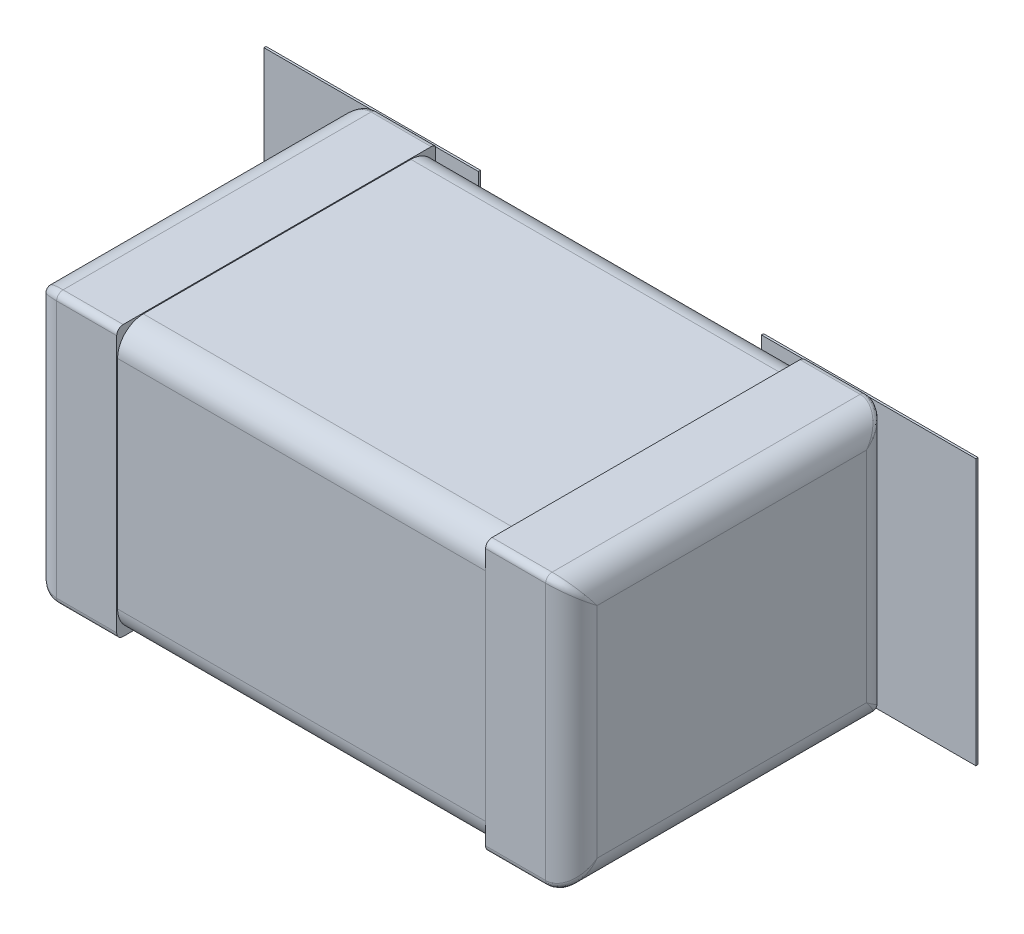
ISO-10303-21;
HEADER;
FILE_DESCRIPTION(('STEP AP214'),'2;1');
FILE_NAME('part.step','',(''),(''),'','','');
FILE_SCHEMA(('AUTOMOTIVE_DESIGN { 1 0 10303 214 1 1 1 1 }'));
ENDSEC;
DATA;
#1=APPLICATION_CONTEXT('core data for automotive mechanical design processes');
#2=APPLICATION_PROTOCOL_DEFINITION('international standard','automotive_design',2000,#1);
#3=PRODUCT_CONTEXT('',#1,'mechanical');
#4=PRODUCT('Part','Part','',(#3));
#5=PRODUCT_RELATED_PRODUCT_CATEGORY('part','',(#4));
#6=PRODUCT_DEFINITION_FORMATION('','',#4);
#7=PRODUCT_DEFINITION_CONTEXT('part definition',#1,'design');
#8=PRODUCT_DEFINITION('design','',#6,#7);
#9=PRODUCT_DEFINITION_SHAPE('','',#8);
#10=(LENGTH_UNIT() NAMED_UNIT(*) SI_UNIT(.MILLI.,.METRE.));
#11=(NAMED_UNIT(*) PLANE_ANGLE_UNIT() SI_UNIT($,.RADIAN.));
#12=(NAMED_UNIT(*) SI_UNIT($,.STERADIAN.) SOLID_ANGLE_UNIT());
#13=UNCERTAINTY_MEASURE_WITH_UNIT(LENGTH_MEASURE(1.E-05),#10,'distance_accuracy_value','');
#14=(GEOMETRIC_REPRESENTATION_CONTEXT(3) GLOBAL_UNCERTAINTY_ASSIGNED_CONTEXT((#13)) GLOBAL_UNIT_ASSIGNED_CONTEXT((#10,
#11,#12)) REPRESENTATION_CONTEXT('',''));
#15=CARTESIAN_POINT('',(0.,0.,0.));
#16=DIRECTION('',(0.,0.,1.));
#17=DIRECTION('',(1.,0.,0.));
#18=AXIS2_PLACEMENT_3D('',#15,#16,#17);
#19=CARTESIAN_POINT('',(1.4478,-0.6477,4.452855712));
#20=DIRECTION('',(0.,0.,-1.));
#21=DIRECTION('',(-1.,0.,0.));
#22=AXIS2_PLACEMENT_3D('',#19,#20,#21);
#23=CYLINDRICAL_SURFACE('',#22,0.1524);
#24=CARTESIAN_POINT('',(1.60019999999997,-0.647700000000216,0.228600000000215));
#25=CARTESIAN_POINT('',(1.60019784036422,-0.649768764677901,0.227046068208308));
#26=CARTESIAN_POINT('',(1.60015465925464,-0.651838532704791,0.225493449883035));
#27=CARTESIAN_POINT('',(1.59998242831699,-0.656042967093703,0.222343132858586));
#28=CARTESIAN_POINT('',(1.59985070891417,-0.658177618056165,0.22074555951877));
#29=CARTESIAN_POINT('',(1.59949199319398,-0.662509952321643,0.217506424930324));
#30=CARTESIAN_POINT('',(1.59926216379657,-0.664707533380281,0.215865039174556));
#31=CARTESIAN_POINT('',(1.59869755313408,-0.669163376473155,0.212539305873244));
#32=CARTESIAN_POINT('',(1.59835976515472,-0.671421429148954,0.21085518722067));
#33=CARTESIAN_POINT('',(1.59756926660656,-0.675995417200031,0.207444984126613));
#34=CARTESIAN_POINT('',(1.59711336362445,-0.678311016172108,0.205719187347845));
#35=CARTESIAN_POINT('',(1.59607649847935,-0.68299676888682,0.202226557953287));
#36=CARTESIAN_POINT('',(1.59549214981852,-0.685366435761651,0.200460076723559));
#37=CARTESIAN_POINT('',(1.5941882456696,-0.690155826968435,0.196887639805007));
#38=CARTESIAN_POINT('',(1.59346513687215,-0.692574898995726,0.195082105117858));
#39=CARTESIAN_POINT('',(1.59187230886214,-0.697456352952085,0.191436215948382));
#40=CARTESIAN_POINT('',(1.59099892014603,-0.699917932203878,0.189596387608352));
#41=CARTESIAN_POINT('',(1.58909384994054,-0.70487631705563,0.18588739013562));
#42=CARTESIAN_POINT('',(1.58805839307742,-0.707372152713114,0.184018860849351));
#43=CARTESIAN_POINT('',(1.58581713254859,-0.712390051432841,0.180258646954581));
#44=CARTESIAN_POINT('',(1.584607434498,-0.714910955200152,0.178367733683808));
#45=CARTESIAN_POINT('',(1.58200554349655,-0.719969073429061,0.174569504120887));
#46=CARTESIAN_POINT('',(1.58060932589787,-0.722504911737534,0.172663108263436));
#47=CARTESIAN_POINT('',(1.57762189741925,-0.72758154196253,0.168842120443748));
#48=CARTESIAN_POINT('',(1.57602653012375,-0.730120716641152,0.166928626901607));
#49=CARTESIAN_POINT('',(1.57262566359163,-0.735190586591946,0.163105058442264));
#50=CARTESIAN_POINT('',(1.57081583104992,-0.737719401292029,0.161196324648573));
#51=CARTESIAN_POINT('',(1.5679505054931,-0.741470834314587,0.158363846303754));
#52=CARTESIAN_POINT('',(1.56696042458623,-0.742725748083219,0.157416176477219));
#53=CARTESIAN_POINT('',(1.56492142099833,-0.745227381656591,0.155526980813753));
#54=CARTESIAN_POINT('',(1.56387191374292,-0.746473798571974,0.154585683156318));
#55=CARTESIAN_POINT('',(1.56171208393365,-0.748956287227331,0.15271113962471));
#56=CARTESIAN_POINT('',(1.5606011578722,-0.750192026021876,0.151778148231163));
#57=CARTESIAN_POINT('',(1.5583165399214,-0.752651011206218,0.149922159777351));
#58=CARTESIAN_POINT('',(1.55714222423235,-0.75387389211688,0.148999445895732));
#59=CARTESIAN_POINT('',(1.55472897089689,-0.756304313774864,0.147166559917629));
#60=CARTESIAN_POINT('',(1.55348940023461,-0.757511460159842,0.146256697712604));
#61=CARTESIAN_POINT('',(1.55094320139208,-0.759907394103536,0.144454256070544));
#62=CARTESIAN_POINT('',(1.54963593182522,-0.761095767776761,0.143562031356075));
#63=CARTESIAN_POINT('',(1.54728050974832,-0.763162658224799,0.142010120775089));
#64=CARTESIAN_POINT('',(1.54624290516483,-0.764048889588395,0.141344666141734));
#65=CARTESIAN_POINT('',(1.54415337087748,-0.765785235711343,0.140037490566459));
#66=CARTESIAN_POINT('',(1.54310184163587,-0.766635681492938,0.13939556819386));
#67=CARTESIAN_POINT('',(1.53994942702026,-0.769115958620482,0.137520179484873));
#68=CARTESIAN_POINT('',(1.53780826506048,-0.77071197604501,0.136309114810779));
#69=CARTESIAN_POINT('',(1.53348080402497,-0.773761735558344,0.133987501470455));
#70=CARTESIAN_POINT('',(1.53129741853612,-0.775218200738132,0.132875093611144));
#71=CARTESIAN_POINT('',(1.52689639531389,-0.777991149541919,0.130752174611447));
#72=CARTESIAN_POINT('',(1.52468148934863,-0.779310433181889,0.129739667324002));
#73=CARTESIAN_POINT('',(1.5202302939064,-0.781809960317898,0.12782016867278));
#74=CARTESIAN_POINT('',(1.51799666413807,-0.782993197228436,0.12691091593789));
#75=CARTESIAN_POINT('',(1.51351980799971,-0.785222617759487,0.125199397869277));
#76=CARTESIAN_POINT('',(1.51127909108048,-0.786271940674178,0.124394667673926));
#77=CARTESIAN_POINT('',(1.50679848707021,-0.788236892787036,0.12289170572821));
#78=CARTESIAN_POINT('',(1.50456087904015,-0.789155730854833,0.122190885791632));
#79=CARTESIAN_POINT('',(1.50009646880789,-0.790863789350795,0.120893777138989));
#80=CARTESIAN_POINT('',(1.49787168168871,-0.791656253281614,0.120294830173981));
#81=CARTESIAN_POINT('',(1.49344734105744,-0.793116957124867,0.119197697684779));
#82=CARTESIAN_POINT('',(1.49124958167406,-0.793788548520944,0.118696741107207));
#83=CARTESIAN_POINT('',(1.48689281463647,-0.795013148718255,0.117790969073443));
#84=CARTESIAN_POINT('',(1.48473537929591,-0.795569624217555,0.117383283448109));
#85=CARTESIAN_POINT('',(1.48047024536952,-0.796570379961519,0.11665825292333));
#86=CARTESIAN_POINT('',(1.4783638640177,-0.797018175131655,0.116338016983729));
#87=CARTESIAN_POINT('',(1.47420953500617,-0.797808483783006,0.115781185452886));
#88=CARTESIAN_POINT('',(1.47216263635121,-0.798154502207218,0.115541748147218));
#89=CARTESIAN_POINT('',(1.4681351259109,-0.798748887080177,0.115138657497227));
#90=CARTESIAN_POINT('',(1.46615529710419,-0.799000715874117,0.114972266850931));
#91=CARTESIAN_POINT('',(1.46227118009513,-0.799417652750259,0.114703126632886));
#92=CARTESIAN_POINT('',(1.46036741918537,-0.799586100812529,0.11459789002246));
#93=CARTESIAN_POINT('',(1.45664243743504,-0.79984622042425,0.114439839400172));
#94=CARTESIAN_POINT('',(1.45482153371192,-0.79994112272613,0.114384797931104));
#95=CARTESIAN_POINT('',(1.45126696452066,-0.800063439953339,0.114315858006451));
#96=CARTESIAN_POINT('',(1.44953344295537,-0.800093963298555,0.114300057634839));
#97=CARTESIAN_POINT('',(1.44779999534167,-0.800095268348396,0.114300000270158));
#98=B_SPLINE_CURVE_WITH_KNOTS('',3,(#24,#25,#26,#27,#28,#29,#30,#31,#32,#33,#34,#35,#36,#37,#38,
#39,#40,#41,#42,#43,#44,#45,#46,#47,#48,#49,#50,#51,#52,#53,#54,#55,#56,#57,#58,#59,#60,#61,#62,
#63,#64,#65,#66,#67,#68,#69,#70,#71,#72,#73,#74,#75,#76,#77,#78,#79,#80,#81,#82,#83,#84,#85,#86,
#87,#88,#89,#90,#91,#92,#93,#94,#95,#96,#97),.UNSPECIFIED.,.F.,.F.,(4,2,2,2,2,2,2,2,2,2,2,2,2,2,
2,2,2,2,2,2,2,2,2,2,2,2,2,2,2,2,2,2,2,2,2,2,4),(0.,0.00776186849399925,0.0157689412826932,
0.0240247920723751,0.0325342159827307,0.0413033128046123,0.050339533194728,0.0596489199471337,
0.0692305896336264,0.0790829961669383,0.0892057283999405,0.0995999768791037,0.110267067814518,
0.121207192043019,0.126781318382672,0.132425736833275,0.138141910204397,0.143931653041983,
0.149795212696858,0.155731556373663,0.160285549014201,0.164776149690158,0.173568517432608,
0.182116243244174,0.190421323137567,0.198475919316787,0.206277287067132,0.213828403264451,
0.221133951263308,0.228186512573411,0.234978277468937,0.241506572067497,0.247772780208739,
0.253778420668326,0.259518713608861,0.264989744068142,0.270189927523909),.UNSPECIFIED.);
#99=CARTESIAN_POINT('',(1.44779999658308,-0.800097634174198,0.114300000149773));
#100=VERTEX_POINT('',#99);
#101=CARTESIAN_POINT('',(1.60019999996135,-0.647700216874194,0.228600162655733));
#102=VERTEX_POINT('',#101);
#103=EDGE_CURVE('E220',#100,#102,#98,.F.);
#104=ORIENTED_EDGE('',*,*,#103,.T.);
#105=DIRECTION('',(0.,0.,-1.));
#106=VECTOR('',#105,1.);
#107=CARTESIAN_POINT('',(1.6002,-0.6477,4.452855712));
#108=LINE('',#107,#106);
#109=CARTESIAN_POINT('',(1.60019999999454,-0.647699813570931,1.82372018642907));
#110=VERTEX_POINT('',#109);
#111=EDGE_CURVE('E214',#102,#110,#108,.F.);
#112=ORIENTED_EDGE('',*,*,#111,.T.);
#113=CARTESIAN_POINT('',(1.4443076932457,-0.800059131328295,1.93799093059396));
#114=CARTESIAN_POINT('',(1.4532943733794,-0.800262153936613,1.93814319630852));
#115=CARTESIAN_POINT('',(1.4731799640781,-0.798952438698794,1.93716091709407));
#116=CARTESIAN_POINT('',(1.50323032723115,-0.790910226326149,1.93112929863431));
#117=CARTESIAN_POINT('',(1.53320660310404,-0.775466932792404,1.91954690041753));
#118=CARTESIAN_POINT('',(1.56027121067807,-0.75265007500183,1.9024343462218));
#119=CARTESIAN_POINT('',(1.58236548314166,-0.722581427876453,1.8798829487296));
#120=CARTESIAN_POINT('',(1.59686648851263,-0.686707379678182,1.85297747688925));
#121=CARTESIAN_POINT('',(1.6003021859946,-0.660025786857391,1.83296629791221));
#122=CARTESIAN_POINT('',(1.60019399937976,-0.645875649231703,1.82235369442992));
#123=CARTESIAN_POINT('',(1.60017910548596,-0.644963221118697,1.82166937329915));
#124=(BOUNDED_CURVE() B_SPLINE_CURVE(3,(#113,#114,#115,#116,#117,#118,#119,#120,#121,#122,#123),
.UNSPECIFIED.,.F.,.F.) B_SPLINE_CURVE_WITH_KNOTS((4,1,1,1,1,1,1,1,4),(-0.01241919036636,
0.0832322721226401,0.19798010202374,0.32261828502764,0.46267870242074,0.61979943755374,
0.79400729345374,0.97429926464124,0.9867184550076),
.UNSPECIFIED.) CURVE() GEOMETRIC_REPRESENTATION_ITEM() RATIONAL_B_SPLINE_CURVE((1.17153820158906,
1.17153820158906,1.17153820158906,1.17153820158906,1.17153820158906,1.17153820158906,
1.17153820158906,1.17153820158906,1.17153820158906,1.17153820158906,1.17153820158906)) REPRESENTATION_ITEM(''));
#125=CARTESIAN_POINT('',(1.44780005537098,-0.800099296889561,1.93801999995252));
#126=VERTEX_POINT('',#125);
#127=EDGE_CURVE('E209',#110,#126,#124,.F.);
#128=ORIENTED_EDGE('',*,*,#127,.T.);
#129=DIRECTION('',(0.,0.,-1.));
#130=VECTOR('',#129,1.);
#131=CARTESIAN_POINT('',(1.44779999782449,-0.8001,0.0762));
#132=LINE('',#131,#130);
#133=EDGE_CURVE('E212',#100,#126,#132,.F.);
#134=ORIENTED_EDGE('',*,*,#133,.F.);
#135=EDGE_LOOP('',(#104,#112,#128,#134));
#136=FACE_BOUND('',#135,.T.);
#137=ADVANCED_FACE('F16',(#136),#23,.T.);
#138=CARTESIAN_POINT('',(-1.6002,-0.8001,0.0762));
#139=DIRECTION('',(0.,-1.,0.));
#140=DIRECTION('',(0.,0.,-1.));
#141=AXIS2_PLACEMENT_3D('',#138,#139,#140);
#142=PLANE('',#141);
#143=DIRECTION('',(0.,0.,-1.));
#144=VECTOR('',#143,1.);
#145=CARTESIAN_POINT('',(1.0922,-0.8001,0.081534));
#146=LINE('',#145,#144);
#147=CARTESIAN_POINT('',(1.0922,-0.8001,1.93801999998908));
#148=VERTEX_POINT('',#147);
#149=CARTESIAN_POINT('',(1.0922,-0.8001,0.1143));
#150=VERTEX_POINT('',#149);
#151=EDGE_CURVE('E270',#148,#150,#146,.T.);
#152=ORIENTED_EDGE('',*,*,#151,.T.);
#153=DIRECTION('',(1.,0.,0.));
#154=VECTOR('',#153,1.);
#155=CARTESIAN_POINT('',(-1.6002,-0.8001,0.1143));
#156=LINE('',#155,#154);
#157=EDGE_CURVE('E230',#150,#100,#156,.T.);
#158=ORIENTED_EDGE('',*,*,#157,.T.);
#159=ORIENTED_EDGE('',*,*,#133,.T.);
#160=DIRECTION('',(1.,0.,0.));
#161=VECTOR('',#160,1.);
#162=CARTESIAN_POINT('',(-1.6002,-0.8001,1.93801999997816));
#163=LINE('',#162,#161);
#164=EDGE_CURVE('E228',#126,#148,#163,.F.);
#165=ORIENTED_EDGE('',*,*,#164,.T.);
#166=EDGE_LOOP('',(#152,#158,#159,#165));
#167=FACE_BOUND('',#166,.T.);
#168=ADVANCED_FACE('F226',(#167),#142,.T.);
#169=CARTESIAN_POINT('',(1.0922,-0.8001,0.081534));
#170=DIRECTION('',(1.,0.,0.));
#171=DIRECTION('',(0.,0.,-1.));
#172=AXIS2_PLACEMENT_3D('',#169,#170,#171);
#173=PLANE('',#172);
#174=DIRECTION('',(0.,0.,-1.));
#175=VECTOR('',#174,1.);
#176=CARTESIAN_POINT('',(1.0922,0.794766,0.081534));
#177=LINE('',#176,#175);
#178=CARTESIAN_POINT('',(1.0922,0.794766,1.818386));
#179=VERTEX_POINT('',#178);
#180=CARTESIAN_POINT('',(1.0922,0.794766,0.233934));
#181=VERTEX_POINT('',#180);
#182=EDGE_CURVE('E292',#179,#181,#177,.T.);
#183=ORIENTED_EDGE('',*,*,#182,.F.);
#184=CARTESIAN_POINT('',(1.0922,0.642366,1.818386));
#185=DIRECTION('',(-1.,0.,0.));
#186=DIRECTION('',(0.,0.,1.));
#187=AXIS2_PLACEMENT_3D('',#184,#185,#186);
#188=CIRCLE('',#187,0.1524);
#189=CARTESIAN_POINT('',(1.0922,0.642366,1.970786));
#190=VERTEX_POINT('',#189);
#191=EDGE_CURVE('E291',#190,#179,#188,.T.);
#192=ORIENTED_EDGE('',*,*,#191,.F.);
#193=DIRECTION('',(0.,1.,0.));
#194=VECTOR('',#193,1.);
#195=CARTESIAN_POINT('',(1.0922,-0.8001,1.970786));
#196=LINE('',#195,#194);
#197=CARTESIAN_POINT('',(1.0922,-0.642366,1.970786));
#198=VERTEX_POINT('',#197);
#199=EDGE_CURVE('E288',#198,#190,#196,.T.);
#200=ORIENTED_EDGE('',*,*,#199,.F.);
#201=CARTESIAN_POINT('',(1.0922,-0.642366,1.818386));
#202=DIRECTION('',(-1.,0.,0.));
#203=DIRECTION('',(0.,0.,1.));
#204=AXIS2_PLACEMENT_3D('',#201,#202,#203);
#205=CIRCLE('',#204,0.1524);
#206=CARTESIAN_POINT('',(1.0922,-0.794766,1.818386));
#207=VERTEX_POINT('',#206);
#208=EDGE_CURVE('E287',#207,#198,#205,.T.);
#209=ORIENTED_EDGE('',*,*,#208,.F.);
#210=DIRECTION('',(0.,0.,-1.));
#211=VECTOR('',#210,1.);
#212=CARTESIAN_POINT('',(1.0922,-0.794766,0.081534));
#213=LINE('',#212,#211);
#214=CARTESIAN_POINT('',(1.0922,-0.794766,0.233934));
#215=VERTEX_POINT('',#214);
#216=EDGE_CURVE('E284',#215,#207,#213,.F.);
#217=ORIENTED_EDGE('',*,*,#216,.F.);
#218=CARTESIAN_POINT('',(1.0922,-0.642366,0.233934));
#219=DIRECTION('',(1.,0.,0.));
#220=DIRECTION('',(0.,0.,-1.));
#221=AXIS2_PLACEMENT_3D('',#218,#219,#220);
#222=CIRCLE('',#221,0.1524);
#223=CARTESIAN_POINT('',(1.0922,-0.689173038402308,0.0888999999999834));
#224=VERTEX_POINT('',#223);
#225=EDGE_CURVE('E283',#224,#215,#222,.F.);
#226=ORIENTED_EDGE('',*,*,#225,.F.);
#227=DIRECTION('',(0.,1.,0.));
#228=VECTOR('',#227,1.);
#229=CARTESIAN_POINT('',(1.0922,-0.8001,0.0889));
#230=LINE('',#229,#228);
#231=CARTESIAN_POINT('',(1.0922,-0.7875016,0.0889));
#232=VERTEX_POINT('',#231);
#233=EDGE_CURVE('E278',#232,#224,#230,.T.);
#234=ORIENTED_EDGE('',*,*,#233,.F.);
#235=DIRECTION('',(0.,0.,-1.));
#236=VECTOR('',#235,1.);
#237=CARTESIAN_POINT('',(1.0922,-0.7875016,0.081534));
#238=LINE('',#237,#236);
#239=CARTESIAN_POINT('',(1.0922,-0.7875016,0.08599410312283));
#240=VERTEX_POINT('',#239);
#241=EDGE_CURVE('E275',#240,#232,#238,.F.);
#242=ORIENTED_EDGE('',*,*,#241,.F.);
#243=CARTESIAN_POINT('',(1.0922,-0.762,0.1143));
#244=DIRECTION('',(-1.,0.,0.));
#245=DIRECTION('',(0.,0.,1.));
#246=AXIS2_PLACEMENT_3D('',#243,#244,#245);
#247=CIRCLE('',#246,0.0381);
#248=EDGE_CURVE('E272',#150,#240,#247,.F.);
#249=ORIENTED_EDGE('',*,*,#248,.F.);
#250=ORIENTED_EDGE('',*,*,#151,.F.);
#251=CARTESIAN_POINT('',(1.0922,-0.762,1.93802));
#252=DIRECTION('',(1.,0.,0.));
#253=DIRECTION('',(0.,0.,-1.));
#254=AXIS2_PLACEMENT_3D('',#251,#252,#253);
#255=CIRCLE('',#254,0.0381);
#256=CARTESIAN_POINT('',(1.0922,-0.762,1.97612));
#257=VERTEX_POINT('',#256);
#258=EDGE_CURVE('E251',#257,#148,#255,.T.);
#259=ORIENTED_EDGE('',*,*,#258,.F.);
#260=DIRECTION('',(0.,1.,0.));
#261=VECTOR('',#260,1.);
#262=CARTESIAN_POINT('',(1.0922,-0.8001,1.97612));
#263=LINE('',#262,#261);
#264=CARTESIAN_POINT('',(1.0922,0.761999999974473,1.97612));
#265=VERTEX_POINT('',#264);
#266=EDGE_CURVE('E268',#265,#257,#263,.F.);
#267=ORIENTED_EDGE('',*,*,#266,.F.);
#268=CARTESIAN_POINT('',(1.0922,0.762,1.93802));
#269=DIRECTION('',(-1.,0.,0.));
#270=DIRECTION('',(0.,0.,1.));
#271=AXIS2_PLACEMENT_3D('',#268,#269,#270);
#272=CIRCLE('',#271,0.0381);
#273=CARTESIAN_POINT('',(1.0922,0.8001,1.93802));
#274=VERTEX_POINT('',#273);
#275=EDGE_CURVE('E1126',#274,#265,#272,.F.);
#276=ORIENTED_EDGE('',*,*,#275,.F.);
#277=DIRECTION('',(0.,0.,1.));
#278=VECTOR('',#277,1.);
#279=CARTESIAN_POINT('',(1.0922,0.8001,0.0762));
#280=LINE('',#279,#278);
#281=CARTESIAN_POINT('',(1.0922,0.8001,0.114300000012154));
#282=VERTEX_POINT('',#281);
#283=EDGE_CURVE('E296',#282,#274,#280,.T.);
#284=ORIENTED_EDGE('',*,*,#283,.F.);
#285=CARTESIAN_POINT('',(1.0922,0.762,0.1143));
#286=DIRECTION('',(1.,0.,0.));
#287=DIRECTION('',(0.,0.,-1.));
#288=AXIS2_PLACEMENT_3D('',#285,#286,#287);
#289=CIRCLE('',#288,0.0381);
#290=CARTESIAN_POINT('',(1.0922,0.7875016,0.0859931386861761));
#291=VERTEX_POINT('',#290);
#292=EDGE_CURVE('E20',#291,#282,#289,.T.);
#293=ORIENTED_EDGE('',*,*,#292,.F.);
#294=DIRECTION('',(0.,0.,-1.));
#295=VECTOR('',#294,1.);
#296=CARTESIAN_POINT('',(1.0922,0.7875016,0.081534));
#297=LINE('',#296,#295);
#298=CARTESIAN_POINT('',(1.0922,0.7875016,0.0889));
#299=VERTEX_POINT('',#298);
#300=EDGE_CURVE('E194',#299,#291,#297,.T.);
#301=ORIENTED_EDGE('',*,*,#300,.F.);
#302=DIRECTION('',(0.,1.,0.));
#303=VECTOR('',#302,1.);
#304=CARTESIAN_POINT('',(1.0922,-0.8001,0.0889));
#305=LINE('',#304,#303);
#306=CARTESIAN_POINT('',(1.0922,0.689173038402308,0.0888999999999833));
#307=VERTEX_POINT('',#306);
#308=EDGE_CURVE('E253',#307,#299,#305,.T.);
#309=ORIENTED_EDGE('',*,*,#308,.F.);
#310=CARTESIAN_POINT('',(1.0922,0.642366,0.233934));
#311=DIRECTION('',(-1.,0.,0.));
#312=DIRECTION('',(0.,0.,1.));
#313=AXIS2_PLACEMENT_3D('',#310,#311,#312);
#314=CIRCLE('',#313,0.1524);
#315=EDGE_CURVE('E295',#181,#307,#314,.T.);
#316=ORIENTED_EDGE('',*,*,#315,.F.);
#317=EDGE_LOOP('',(#183,#192,#200,#209,#217,#226,#234,#242,#249,#250,#259,#267,#276,#284,#293,
#301,#309,#316));
#318=FACE_BOUND('',#317,.T.);
#319=ADVANCED_FACE('F315',(#318),#173,.F.);
#320=CARTESIAN_POINT('',(7.60396605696,0.762,1.93802));
#321=DIRECTION('',(-1.,0.,0.));
#322=DIRECTION('',(0.,0.,1.));
#323=AXIS2_PLACEMENT_3D('',#320,#321,#322);
#324=CYLINDRICAL_SURFACE('',#323,0.0381);
#325=CARTESIAN_POINT('',(1.44780004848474,0.799633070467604,1.93208560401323));
#326=CARTESIAN_POINT('',(1.44779981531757,0.804040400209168,1.96004319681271));
#327=CARTESIAN_POINT('',(1.44779964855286,0.78402643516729,1.98005697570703));
#328=CARTESIAN_POINT('',(1.44779968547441,0.756067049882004,1.97565121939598));
#329=(BOUNDED_CURVE() B_SPLINE_CURVE(3,(#325,#326,#327,#328),.UNSPECIFIED.,.F.,
.F.) B_SPLINE_CURVE_WITH_KNOTS((4,4),(0.,1.),
.UNSPECIFIED.) CURVE() GEOMETRIC_REPRESENTATION_ITEM() RATIONAL_B_SPLINE_CURVE((1.259136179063,
0.9136212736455,0.9136212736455,1.259136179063)) REPRESENTATION_ITEM(''));
#330=CARTESIAN_POINT('',(1.44779999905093,0.800099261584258,1.93801972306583));
#331=VERTEX_POINT('',#330);
#332=CARTESIAN_POINT('',(1.44779991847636,0.761999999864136,1.97611781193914));
#333=VERTEX_POINT('',#332);
#334=EDGE_CURVE('E1097',#331,#333,#329,.T.);
#335=ORIENTED_EDGE('',*,*,#334,.F.);
#336=DIRECTION('',(1.,0.,0.));
#337=VECTOR('',#336,1.);
#338=CARTESIAN_POINT('',(1.6002,0.8001,1.93802));
#339=LINE('',#338,#337);
#340=EDGE_CURVE('E298',#274,#331,#339,.T.);
#341=ORIENTED_EDGE('',*,*,#340,.F.);
#342=ORIENTED_EDGE('',*,*,#275,.T.);
#343=DIRECTION('',(1.,0.,0.));
#344=VECTOR('',#343,1.);
#345=CARTESIAN_POINT('',(0.,0.761999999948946,1.97612));
#346=LINE('',#345,#344);
#347=EDGE_CURVE('E1056',#333,#265,#346,.F.);
#348=ORIENTED_EDGE('',*,*,#347,.F.);
#349=EDGE_LOOP('',(#335,#341,#342,#348));
#350=FACE_BOUND('',#349,.T.);
#351=ADVANCED_FACE('F305',(#350),#324,.T.);
#352=CARTESIAN_POINT('',(-7.60396605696,-0.762,1.93802));
#353=DIRECTION('',(1.,0.,0.));
#354=DIRECTION('',(0.,0.,-1.));
#355=AXIS2_PLACEMENT_3D('',#352,#353,#354);
#356=CYLINDRICAL_SURFACE('',#355,0.0381);
#357=ORIENTED_EDGE('',*,*,#258,.T.);
#358=ORIENTED_EDGE('',*,*,#164,.F.);
#359=CARTESIAN_POINT('',(1.4477999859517,-0.756067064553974,1.97565149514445));
#360=CARTESIAN_POINT('',(1.44780001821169,-0.784026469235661,1.98005731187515));
#361=CARTESIAN_POINT('',(1.44780019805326,-0.804040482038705,1.96004344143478));
#362=CARTESIAN_POINT('',(1.44780037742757,-0.799633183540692,1.93208568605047));
#363=(BOUNDED_CURVE() B_SPLINE_CURVE(3,(#359,#360,#361,#362),.UNSPECIFIED.,.F.,
.F.) B_SPLINE_CURVE_WITH_KNOTS((4,4),(0.,1.),
.UNSPECIFIED.) CURVE() GEOMETRIC_REPRESENTATION_ITEM() RATIONAL_B_SPLINE_CURVE((1.259136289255,
0.9136212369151,0.9136212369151,1.259136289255)) REPRESENTATION_ITEM(''));
#364=CARTESIAN_POINT('',(1.4477999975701,-0.76199999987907,1.97611795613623));
#365=VERTEX_POINT('',#364);
#366=EDGE_CURVE('E234',#365,#126,#363,.T.);
#367=ORIENTED_EDGE('',*,*,#366,.F.);
#368=DIRECTION('',(1.,0.,0.));
#369=VECTOR('',#368,1.);
#370=CARTESIAN_POINT('',(0.,-0.762,1.97612));
#371=LINE('',#370,#369);
#372=EDGE_CURVE('E245',#257,#365,#371,.T.);
#373=ORIENTED_EDGE('',*,*,#372,.F.);
#374=EDGE_LOOP('',(#357,#358,#367,#373));
#375=FACE_BOUND('',#374,.T.);
#376=ADVANCED_FACE('F249',(#375),#356,.T.);
#377=CARTESIAN_POINT('',(1.6002,0.8001,0.0762));
#378=DIRECTION('',(0.,1.,0.));
#379=DIRECTION('',(0.,0.,1.));
#380=AXIS2_PLACEMENT_3D('',#377,#378,#379);
#381=PLANE('',#380);
#382=DIRECTION('',(0.,0.,-1.));
#383=VECTOR('',#382,1.);
#384=CARTESIAN_POINT('',(1.44779999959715,0.8001,4.452855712));
#385=LINE('',#384,#383);
#386=CARTESIAN_POINT('',(1.44779999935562,0.800099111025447,0.114300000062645));
#387=VERTEX_POINT('',#386);
#388=EDGE_CURVE('E1035',#387,#331,#385,.F.);
#389=ORIENTED_EDGE('',*,*,#388,.F.);
#390=DIRECTION('',(1.,0.,0.));
#391=VECTOR('',#390,1.);
#392=CARTESIAN_POINT('',(1.6002,0.8001,0.114300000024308));
#393=LINE('',#392,#391);
#394=EDGE_CURVE('E1068',#387,#282,#393,.F.);
#395=ORIENTED_EDGE('',*,*,#394,.T.);
#396=ORIENTED_EDGE('',*,*,#283,.T.);
#397=ORIENTED_EDGE('',*,*,#340,.T.);
#398=EDGE_LOOP('',(#389,#395,#396,#397));
#399=FACE_BOUND('',#398,.T.);
#400=ADVANCED_FACE('F1081',(#399),#381,.T.);
#401=CARTESIAN_POINT('',(1.4444512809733,0.799597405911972,1.93205779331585));
#402=CARTESIAN_POINT('',(1.45298093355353,0.799782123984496,1.93220144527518));
#403=CARTESIAN_POINT('',(1.47194824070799,0.798602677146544,1.93128721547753));
#404=CARTESIAN_POINT('',(1.50089614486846,0.791233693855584,1.92559028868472));
#405=CARTESIAN_POINT('',(1.53030535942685,0.776774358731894,1.91444086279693));
#406=CARTESIAN_POINT('',(1.55735962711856,0.755023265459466,1.89774066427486));
#407=CARTESIAN_POINT('',(1.57994644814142,0.725911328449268,1.87550781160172));
#408=CARTESIAN_POINT('',(1.59532601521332,0.69070305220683,1.84877759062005));
#409=CARTESIAN_POINT('',(1.59949641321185,0.664213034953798,1.82879017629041));
#410=CARTESIAN_POINT('',(1.59977952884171,0.650076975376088,1.81815664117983));
#411=CARTESIAN_POINT('',(1.59978986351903,0.649166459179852,1.81747183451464));
#412=CARTESIAN_POINT('',(1.44370909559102,0.80398931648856,1.96000925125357));
#413=CARTESIAN_POINT('',(1.45412671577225,0.80425474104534,1.9601871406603));
#414=CARTESIAN_POINT('',(1.47733872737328,0.802549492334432,1.95903230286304));
#415=CARTESIAN_POINT('',(1.51172028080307,0.792185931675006,1.95197852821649));
#416=CARTESIAN_POINT('',(1.54449239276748,0.772974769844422,1.93887044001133));
#417=CARTESIAN_POINT('',(1.57225125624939,0.745884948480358,1.92023828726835));
#418=CARTESIAN_POINT('',(1.59306712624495,0.71176762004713,1.89645944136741));
#419=CARTESIAN_POINT('',(1.60470628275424,0.67271495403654,1.86876472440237));
#420=CARTESIAN_POINT('',(1.60550940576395,0.64477980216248,1.84855000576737));
#421=CARTESIAN_POINT('',(1.60395057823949,0.63025499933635,1.83792799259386));
#422=CARTESIAN_POINT('',(1.60384210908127,0.629320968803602,1.83724455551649));
#423=CARTESIAN_POINT('',(1.44370920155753,0.78397021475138,1.98001863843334));
#424=CARTESIAN_POINT('',(1.45412485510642,0.784262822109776,1.98022103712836));
#425=CARTESIAN_POINT('',(1.47736425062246,0.782376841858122,1.97889395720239));
#426=CARTESIAN_POINT('',(1.51107339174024,0.771082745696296,1.97086886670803));
#427=CARTESIAN_POINT('',(1.54168740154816,0.750814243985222,1.95635864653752));
#428=CARTESIAN_POINT('',(1.56582760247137,0.723370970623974,1.9363434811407));
#429=CARTESIAN_POINT('',(1.58200937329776,0.69024371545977,1.91145791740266));
#430=CARTESIAN_POINT('',(1.58876025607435,0.653898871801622,1.88307275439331));
#431=CARTESIAN_POINT('',(1.58662910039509,0.628990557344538,1.86269531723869));
#432=CARTESIAN_POINT('',(1.58376802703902,0.61634245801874,1.85208155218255));
#433=CARTESIAN_POINT('',(1.58357676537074,0.615530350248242,1.85139909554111));
#434=CARTESIAN_POINT('',(1.44445151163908,0.756020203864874,1.9756138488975));
#435=CARTESIAN_POINT('',(1.45297688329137,0.756264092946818,1.9758108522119));
#436=CARTESIAN_POINT('',(1.47200379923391,0.754691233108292,1.97452168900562));
#437=CARTESIAN_POINT('',(1.49948800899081,0.745296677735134,1.96671042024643));
#438=CARTESIAN_POINT('',(1.52419950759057,0.728535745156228,1.95250886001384));
#439=CARTESIAN_POINT('',(1.54337673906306,0.706015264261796,1.93279814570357));
#440=CARTESIAN_POINT('',(1.55587614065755,0.67905850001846,1.90815621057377));
#441=CARTESIAN_POINT('',(1.56061500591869,0.649744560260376,1.87992303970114));
#442=CARTESIAN_POINT('',(1.55839812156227,0.629843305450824,1.85958142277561));
#443=CARTESIAN_POINT('',(1.55584653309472,0.619792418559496,1.84896584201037));
#444=CARTESIAN_POINT('',(1.55567664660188,0.619147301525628,1.84828316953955));
#445=(BOUNDED_SURFACE() B_SPLINE_SURFACE(3,3,((#401,#402,#403,#404,#405,#406,#407,#408,#409,
#410,#411),(#412,#413,#414,#415,#416,#417,#418,#419,#420,#421,#422),(#423,#424,#425,#426,#427,
#428,#429,#430,#431,#432,#433),(#434,#435,#436,#437,#438,#439,#440,#441,#442,#443,#444)),
.UNSPECIFIED.,.F.,.F.,.F.) B_SPLINE_SURFACE_WITH_KNOTS((4,4),(4,1,1,1,1,1,1,1,4),(0.,1.),
(0.01428347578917,0.1089427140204,0.2236386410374,0.3482815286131,0.488287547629,
0.6453830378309,0.8195859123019,1.,1.012408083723),
.UNSPECIFIED.) GEOMETRIC_REPRESENTATION_ITEM() RATIONAL_B_SPLINE_SURFACE(((1.259136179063,
1.259136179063,1.259136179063,1.259136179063,1.259136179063,1.259136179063,1.259136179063,
1.259136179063,1.259136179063,1.259136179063,1.259136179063),(0.9136212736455,0.9136212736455,
0.9136212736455,0.9136212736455,0.9136212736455,0.9136212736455,0.9136212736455,0.9136212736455,
0.9136212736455,0.9136212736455,0.9136212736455),(0.9136212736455,0.9136212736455,
0.9136212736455,0.9136212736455,0.9136212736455,0.9136212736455,0.9136212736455,0.9136212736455,
0.9136212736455,0.9136212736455,0.9136212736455),(1.259136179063,1.259136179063,1.259136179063,
1.259136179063,1.259136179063,1.259136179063,1.259136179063,1.259136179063,1.259136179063,
1.259136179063,1.259136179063))) REPRESENTATION_ITEM('') SURFACE());
#446=CARTESIAN_POINT('',(1.4477999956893,0.761999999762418,1.97611562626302));
#447=CARTESIAN_POINT('',(1.44978722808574,0.762000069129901,1.97611412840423));
#448=CARTESIAN_POINT('',(1.45177459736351,0.76197920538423,1.976074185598));
#449=CARTESIAN_POINT('',(1.45586274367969,0.761887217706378,1.97591324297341));
#450=CARTESIAN_POINT('',(1.4579632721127,0.761813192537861,1.97578758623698));
#451=CARTESIAN_POINT('',(1.46227066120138,0.761599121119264,1.97544175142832));
#452=CARTESIAN_POINT('',(1.46447696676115,0.761455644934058,1.97521672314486));
#453=CARTESIAN_POINT('',(1.46898497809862,0.761086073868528,1.97465693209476));
#454=CARTESIAN_POINT('',(1.47128575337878,0.760856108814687,1.97431712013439));
#455=CARTESIAN_POINT('',(1.47475703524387,0.76044279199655,1.97372158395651));
#456=CARTESIAN_POINT('',(1.47593801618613,0.760290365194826,1.97350422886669));
#457=CARTESIAN_POINT('',(1.47831925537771,0.759959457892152,1.9730367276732));
#458=CARTESIAN_POINT('',(1.47951931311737,0.759780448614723,1.97278593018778));
#459=CARTESIAN_POINT('',(1.48193713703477,0.759395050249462,1.97225018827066));
#460=CARTESIAN_POINT('',(1.4831546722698,0.759188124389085,1.97196458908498));
#461=CARTESIAN_POINT('',(1.48560573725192,0.758745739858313,1.97135800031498));
#462=CARTESIAN_POINT('',(1.48683900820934,0.758509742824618,1.97103635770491));
#463=CARTESIAN_POINT('',(1.48931955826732,0.75800813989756,1.97035648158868));
#464=CARTESIAN_POINT('',(1.49056655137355,0.757741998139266,1.96999760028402));
#465=CARTESIAN_POINT('',(1.49307229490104,0.757179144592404,1.96924211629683));
#466=CARTESIAN_POINT('',(1.4943307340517,0.756881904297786,1.96884487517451));
#467=CARTESIAN_POINT('',(1.49685683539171,0.756256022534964,1.96801162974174));
#468=CARTESIAN_POINT('',(1.4981241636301,0.755926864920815,1.96757500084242));
#469=CARTESIAN_POINT('',(1.5006651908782,0.755236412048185,1.96666197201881));
#470=CARTESIAN_POINT('',(1.50193853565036,0.754874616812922,1.96618496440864));
#471=CARTESIAN_POINT('',(1.50448916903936,0.754118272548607,1.96519023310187));
#472=CARTESIAN_POINT('',(1.50576607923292,0.753723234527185,1.96467191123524));
#473=CARTESIAN_POINT('',(1.50832222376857,0.752899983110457,1.96359375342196));
#474=CARTESIAN_POINT('',(1.50960104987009,0.752471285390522,1.96303331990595));
#475=CARTESIAN_POINT('',(1.51215928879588,0.751580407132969,1.96187017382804));
#476=CARTESIAN_POINT('',(1.51343826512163,0.751117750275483,1.96126686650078));
#477=CARTESIAN_POINT('',(1.51599492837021,0.750158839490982,1.96001733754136));
#478=CARTESIAN_POINT('',(1.51727215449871,0.749662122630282,1.95937052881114));
#479=CARTESIAN_POINT('',(1.51982328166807,0.748635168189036,1.95803348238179));
#480=CARTESIAN_POINT('',(1.52109670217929,0.748104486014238,1.95734266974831));
#481=CARTESIAN_POINT('',(1.52363801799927,0.747009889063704,1.95591723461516));
#482=CARTESIAN_POINT('',(1.52490541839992,0.746445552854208,1.95518205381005));
#483=CARTESIAN_POINT('',(1.52743231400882,0.745284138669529,1.95366764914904));
#484=CARTESIAN_POINT('',(1.52869130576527,0.744686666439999,1.95288788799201));
#485=CARTESIAN_POINT('',(1.53119891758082,0.743459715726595,1.95128417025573));
#486=CARTESIAN_POINT('',(1.53244703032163,0.742829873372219,1.9504596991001));
#487=CARTESIAN_POINT('',(1.53493088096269,0.741538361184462,1.94876614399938));
#488=CARTESIAN_POINT('',(1.53616609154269,0.740876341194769,1.94789655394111));
#489=CARTESIAN_POINT('',(1.5386224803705,0.739520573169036,1.94611221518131));
#490=CARTESIAN_POINT('',(1.53984310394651,0.738826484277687,1.94519696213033));
#491=CARTESIAN_POINT('',(1.54226848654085,0.737406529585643,1.94332096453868));
#492=CARTESIAN_POINT('',(1.5434726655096,0.736680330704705,1.94235972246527));
#493=CARTESIAN_POINT('',(1.54586369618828,0.735197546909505,1.94039115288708));
#494=CARTESIAN_POINT('',(1.54704995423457,0.734440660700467,1.93938333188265));
#495=CARTESIAN_POINT('',(1.54974059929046,0.732670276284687,1.93702588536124));
#496=CARTESIAN_POINT('',(1.55123114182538,0.731649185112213,1.93566611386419));
#497=CARTESIAN_POINT('',(1.55412312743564,0.729584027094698,1.93292196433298));
#498=CARTESIAN_POINT('',(1.55552552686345,0.728540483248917,1.93153819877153));
#499=CARTESIAN_POINT('',(1.55824487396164,0.726437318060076,1.9287505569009));
#500=CARTESIAN_POINT('',(1.55956276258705,0.725378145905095,1.92734725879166));
#501=CARTESIAN_POINT('',(1.56211582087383,0.723247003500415,1.92452451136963));
#502=CARTESIAN_POINT('',(1.56335190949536,0.722175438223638,1.92310558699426));
#503=CARTESIAN_POINT('',(1.56574440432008,0.720022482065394,1.92025483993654));
#504=CARTESIAN_POINT('',(1.56690169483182,0.718941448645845,1.91882348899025));
#505=CARTESIAN_POINT('',(1.56913960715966,0.71677233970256,1.91595104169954));
#506=CARTESIAN_POINT('',(1.57022108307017,0.715684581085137,1.91451037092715));
#507=CARTESIAN_POINT('',(1.57231034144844,0.71350465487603,1.91162225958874));
#508=CARTESIAN_POINT('',(1.57331895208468,0.712412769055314,1.91017520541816));
#509=CARTESIAN_POINT('',(1.57526530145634,0.710227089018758,1.9072772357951));
#510=CARTESIAN_POINT('',(1.57620384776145,0.709133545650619,1.90582667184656));
#511=CARTESIAN_POINT('',(1.57889774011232,0.705877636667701,1.90150506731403));
#512=CARTESIAN_POINT('',(1.5805759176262,0.703693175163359,1.89860213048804));
#513=CARTESIAN_POINT('',(1.58367773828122,0.699340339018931,1.89280947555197));
#514=CARTESIAN_POINT('',(1.5851074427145,0.69717340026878,1.88992190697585));
#515=CARTESIAN_POINT('',(1.58773079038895,0.69286613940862,1.88417562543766));
#516=CARTESIAN_POINT('',(1.58893027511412,0.690727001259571,1.88131869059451));
#517=CARTESIAN_POINT('',(1.59111158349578,0.686485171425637,1.87564794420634));
#518=CARTESIAN_POINT('',(1.59209904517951,0.684383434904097,1.87283558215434));
#519=CARTESIAN_POINT('',(1.59387414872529,0.680224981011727,1.86726645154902));
#520=CARTESIAN_POINT('',(1.59466724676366,0.678169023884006,1.86451085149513));
#521=CARTESIAN_POINT('',(1.59607061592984,0.674108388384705,1.8590650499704));
#522=CARTESIAN_POINT('',(1.59668612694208,0.672104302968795,1.85637575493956));
#523=CARTESIAN_POINT('',(1.59774985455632,0.66814915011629,1.85106904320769));
#524=CARTESIAN_POINT('',(1.59820300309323,0.666198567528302,1.84845225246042));
#525=CARTESIAN_POINT('',(1.59895775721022,0.662352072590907,1.84329553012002));
#526=CARTESIAN_POINT('',(1.59926396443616,0.660456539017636,1.84075598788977));
#527=CARTESIAN_POINT('',(1.59974002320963,0.656721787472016,1.83575788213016));
#528=CARTESIAN_POINT('',(1.59991417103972,0.654882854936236,1.83329951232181));
#529=CARTESIAN_POINT('',(1.60014085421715,0.651263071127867,1.82846694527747));
#530=CARTESIAN_POINT('',(1.6001973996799,0.649482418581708,1.82609278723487));
#531=CARTESIAN_POINT('',(1.60020000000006,0.647699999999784,1.82372000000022));
#532=B_SPLINE_CURVE_WITH_KNOTS('',3,(#446,#447,#448,#449,#450,#451,#452,#453,#454,#455,#456,
#457,#458,#459,#460,#461,#462,#463,#464,#465,#466,#467,#468,#469,#470,#471,#472,#473,#474,#475,
#476,#477,#478,#479,#480,#481,#482,#483,#484,#485,#486,#487,#488,#489,#490,#491,#492,#493,#494,
#495,#496,#497,#498,#499,#500,#501,#502,#503,#504,#505,#506,#507,#508,#509,#510,#511,#512,#513,
#514,#515,#516,#517,#518,#519,#520,#521,#522,#523,#524,#525,#526,#527,#528,#529,#530,#531),
.UNSPECIFIED.,.F.,.F.,(4,2,2,2,2,2,2,2,2,2,2,2,2,2,2,2,2,2,2,2,2,2,2,2,2,2,2,2,2,2,2,2,2,2,2,2,
2,2,2,2,2,2,4),(0.,0.00596149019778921,0.0122757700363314,0.0189398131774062,0.0259466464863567,
0.0295775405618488,0.0332938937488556,0.0370960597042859,0.0409839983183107,0.0449572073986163,
0.0490146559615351,0.0531547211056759,0.0573751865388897,0.061675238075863,0.066056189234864,
0.0705190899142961,0.0750644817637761,0.0796923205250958,0.0844019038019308,0.0891918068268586,
0.0940601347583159,0.0990072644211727,0.104034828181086,0.109144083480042,0.114335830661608,
0.121117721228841,0.127804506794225,0.134394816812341,0.14089006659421,0.147292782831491,
0.153604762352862,0.159827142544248,0.165960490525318,0.177958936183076,0.189602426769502,
0.200893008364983,0.211830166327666,0.222411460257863,0.232637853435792,0.242520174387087,
0.252068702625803,0.261291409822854,0.270194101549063),.UNSPECIFIED.);
#533=CARTESIAN_POINT('',(1.60020000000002,0.647699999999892,1.82372000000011));
#534=VERTEX_POINT('',#533);
#535=EDGE_CURVE('E1042',#534,#333,#532,.F.);
#536=CARTESIAN_POINT('',(1.60017928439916,0.64496360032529,1.82166770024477));
#537=CARTESIAN_POINT('',(1.60019411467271,0.6458762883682,1.82235221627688));
#538=CARTESIAN_POINT('',(1.60030153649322,0.660051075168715,1.83298330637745));
#539=CARTESIAN_POINT('',(1.59685632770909,0.686765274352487,1.85301895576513));
#540=CARTESIAN_POINT('',(1.58231539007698,0.722678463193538,1.87995384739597));
#541=CARTESIAN_POINT('',(1.5601727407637,0.752759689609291,1.90251476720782));
#542=CARTESIAN_POINT('',(1.53305269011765,0.77557324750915,1.91962493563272));
#543=CARTESIAN_POINT('',(1.50302257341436,0.790993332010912,1.93118999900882));
#544=CARTESIAN_POINT('',(1.47301427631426,0.79897314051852,1.93717485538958));
#545=CARTESIAN_POINT('',(1.45320737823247,0.800260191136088,1.93814014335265));
#546=CARTESIAN_POINT('',(1.44430457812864,0.800058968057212,1.93798922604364));
#547=(BOUNDED_CURVE() B_SPLINE_CURVE(3,(#536,#537,#538,#539,#540,#541,#542,#543,#544,#545,#546),
.UNSPECIFIED.,.F.,.F.) B_SPLINE_CURVE_WITH_KNOTS((4,1,1,1,1,1,1,1,4),(0.0142834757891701,
0.0266915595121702,0.20710564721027,0.38130852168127,0.53840401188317,0.67841003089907,
0.80305291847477,0.91774884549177,1.012408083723),
.UNSPECIFIED.) CURVE() GEOMETRIC_REPRESENTATION_ITEM() RATIONAL_B_SPLINE_CURVE((1.17155781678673,
1.17155781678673,1.17155781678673,1.17155781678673,1.17155781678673,1.17155781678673,
1.17155781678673,1.17155781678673,1.17155781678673,1.17155781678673,1.17155781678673)) REPRESENTATION_ITEM(''));
#548=EDGE_CURVE('E244',#331,#534,#547,.F.);
#549=ORIENTED_EDGE('',*,*,#535,.F.);
#550=ORIENTED_EDGE('',*,*,#548,.F.);
#551=ORIENTED_EDGE('',*,*,#334,.T.);
#552=EDGE_LOOP('',(#549,#550,#551));
#553=FACE_BOUND('',#552,.T.);
#554=ADVANCED_FACE('F1070',(#553),#445,.T.);
#555=CARTESIAN_POINT('',(0.,0.,1.97612));
#556=DIRECTION('',(0.,0.,1.));
#557=DIRECTION('',(1.,0.,0.));
#558=AXIS2_PLACEMENT_3D('',#555,#556,#557);
#559=PLANE('',#558);
#560=ORIENTED_EDGE('',*,*,#266,.T.);
#561=ORIENTED_EDGE('',*,*,#372,.T.);
#562=DIRECTION('',(0.,1.,0.));
#563=VECTOR('',#562,1.);
#564=CARTESIAN_POINT('',(1.4477999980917,0.,1.97612));
#565=LINE('',#564,#563);
#566=EDGE_CURVE('E1323',#333,#365,#565,.F.);
#567=ORIENTED_EDGE('',*,*,#566,.F.);
#568=ORIENTED_EDGE('',*,*,#347,.T.);
#569=EDGE_LOOP('',(#560,#561,#567,#568));
#570=FACE_BOUND('',#569,.T.);
#571=ADVANCED_FACE('F1080',(#570),#559,.T.);
#572=CARTESIAN_POINT('',(1.59978968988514,-0.649167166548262,1.81747241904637));
#573=CARTESIAN_POINT('',(1.59977941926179,-0.650077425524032,1.81815702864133));
#574=CARTESIAN_POINT('',(1.59949764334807,-0.664188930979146,1.82877204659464));
#575=CARTESIAN_POINT('',(1.59533743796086,-0.690646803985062,1.84873515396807));
#576=CARTESIAN_POINT('',(1.57999807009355,-0.725817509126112,1.87543645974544));
#577=CARTESIAN_POINT('',(1.55745847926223,-0.754918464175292,1.89766047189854));
#578=CARTESIAN_POINT('',(1.53045706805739,-0.776674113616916,1.91436377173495));
#579=CARTESIAN_POINT('',(1.50109765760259,-0.79115657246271,1.92553074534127));
#580=CARTESIAN_POINT('',(1.47210667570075,-0.7985837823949,1.93127265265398));
#581=CARTESIAN_POINT('',(1.45306423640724,-0.799783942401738,1.93220282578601));
#582=CARTESIAN_POINT('',(1.44445429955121,-0.799597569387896,1.93205792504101));
#583=CARTESIAN_POINT('',(1.60384200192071,-0.629321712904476,1.83724512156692));
#584=CARTESIAN_POINT('',(1.60395050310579,-0.630255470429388,1.8379283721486));
#585=CARTESIAN_POINT('',(1.60550749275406,-0.644754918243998,1.84853201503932));
#586=CARTESIAN_POINT('',(1.6047105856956,-0.672655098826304,1.86872159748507));
#587=CARTESIAN_POINT('',(1.59310986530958,-0.711661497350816,1.89638477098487));
#588=CARTESIAN_POINT('',(1.57234670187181,-0.745759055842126,1.92015116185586));
#589=CARTESIAN_POINT('',(1.54465366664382,-0.772846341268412,1.93878254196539));
#590=CARTESIAN_POINT('',(1.51195181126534,-0.792080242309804,1.95190666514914));
#591=CARTESIAN_POINT('',(1.47753252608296,-0.802521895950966,1.95901346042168));
#592=CARTESIAN_POINT('',(1.4542284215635,-0.80425725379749,1.96018911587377));
#593=CARTESIAN_POINT('',(1.4437127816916,-0.803989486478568,1.9600095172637));
#594=CARTESIAN_POINT('',(1.58357672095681,-0.61553102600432,1.85139963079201));
#595=CARTESIAN_POINT('',(1.58376798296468,-0.616342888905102,1.85208190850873));
#596=CARTESIAN_POINT('',(1.58662484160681,-0.628968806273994,1.86267740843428));
#597=CARTESIAN_POINT('',(1.58875794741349,-0.653845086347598,1.88302911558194));
#598=CARTESIAN_POINT('',(1.58203820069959,-0.690143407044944,1.91138085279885));
#599=CARTESIAN_POINT('',(1.56590572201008,-0.723246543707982,1.93625137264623));
#600=CARTESIAN_POINT('',(1.54183220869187,-0.75068173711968,1.95626299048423));
#601=CARTESIAN_POINT('',(1.51129489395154,-0.77096920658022,1.97078816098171));
#602=CARTESIAN_POINT('',(1.47755821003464,-0.782346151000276,1.97887202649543));
#603=CARTESIAN_POINT('',(1.45422651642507,-0.784265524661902,1.9802234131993));
#604=CARTESIAN_POINT('',(1.44371288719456,-0.783970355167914,1.9800189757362));
#605=CARTESIAN_POINT('',(1.55567661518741,-0.619147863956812,1.8482836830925));
#606=CARTESIAN_POINT('',(1.55584649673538,-0.61979278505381,1.84896617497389));
#607=CARTESIAN_POINT('',(1.55839425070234,-0.629826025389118,1.85956346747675));
#608=CARTESIAN_POINT('',(1.56061204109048,-0.649701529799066,1.87987948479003));
#609=CARTESIAN_POINT('',(1.55589748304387,-0.678977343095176,1.90807964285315));
#610=CARTESIAN_POINT('',(1.54343787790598,-0.705913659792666,1.93270710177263));
#611=CARTESIAN_POINT('',(1.52431537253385,-0.728426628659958,1.95241487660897));
#612=CARTESIAN_POINT('',(1.49966769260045,-0.745202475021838,1.9666316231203));
#613=CARTESIAN_POINT('',(1.47216258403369,-0.754665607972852,1.97450039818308));
#614=CARTESIAN_POINT('',(1.45306008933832,-0.756266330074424,1.97581309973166));
#615=CARTESIAN_POINT('',(1.44445452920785,-0.756020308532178,1.97561413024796));
#616=(BOUNDED_SURFACE() B_SPLINE_SURFACE(3,3,((#572,#573,#574,#575,#576,#577,#578,#579,#580,
#581,#582),(#583,#584,#585,#586,#587,#588,#589,#590,#591,#592,#593),(#594,#595,#596,#597,#598,
#599,#600,#601,#602,#603,#604),(#605,#606,#607,#608,#609,#610,#611,#612,#613,#614,#615)),
.UNSPECIFIED.,.F.,.F.,.F.) B_SPLINE_SURFACE_WITH_KNOTS((4,4),(4,1,1,1,1,1,1,1,4),(0.,1.),
(-0.01241919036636,0.,0.1802919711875,0.3544998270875,0.5116205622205,0.6516809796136,
0.7763191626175,0.8910669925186,0.9867184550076),
.UNSPECIFIED.) GEOMETRIC_REPRESENTATION_ITEM() RATIONAL_B_SPLINE_SURFACE(((1.259136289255,
1.259136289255,1.259136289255,1.259136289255,1.259136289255,1.259136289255,1.259136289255,
1.259136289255,1.259136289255,1.259136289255,1.259136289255),(0.9136212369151,0.9136212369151,
0.9136212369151,0.9136212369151,0.9136212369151,0.9136212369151,0.9136212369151,0.9136212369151,
0.9136212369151,0.9136212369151,0.9136212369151),(0.9136212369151,0.9136212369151,
0.9136212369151,0.9136212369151,0.9136212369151,0.9136212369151,0.9136212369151,0.9136212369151,
0.9136212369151,0.9136212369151,0.9136212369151),(1.259136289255,1.259136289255,1.259136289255,
1.259136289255,1.259136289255,1.259136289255,1.259136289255,1.259136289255,1.259136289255,
1.259136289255,1.259136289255))) REPRESENTATION_ITEM('') SURFACE());
#617=CARTESIAN_POINT('',(1.60020000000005,-0.647699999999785,1.82372000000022));
#618=CARTESIAN_POINT('',(1.60019781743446,-0.649255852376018,1.82579130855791));
#619=CARTESIAN_POINT('',(1.60015451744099,-0.650810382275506,1.82786362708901));
#620=CARTESIAN_POINT('',(1.59998184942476,-0.65396445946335,1.83207310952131));
#621=CARTESIAN_POINT('',(1.59984981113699,-0.655563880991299,1.83421025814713));
#622=CARTESIAN_POINT('',(1.59949024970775,-0.658806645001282,1.83854752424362));
#623=CARTESIAN_POINT('',(1.59925989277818,-0.660449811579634,1.84074753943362));
#624=CARTESIAN_POINT('',(1.59869401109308,-0.66377903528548,1.84520817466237));
#625=CARTESIAN_POINT('',(1.59835547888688,-0.665464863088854,1.84746858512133));
#626=CARTESIAN_POINT('',(1.59756326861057,-0.668878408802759,1.85204719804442));
#627=CARTESIAN_POINT('',(1.59710639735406,-0.670605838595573,1.85436506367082));
#628=CARTESIAN_POINT('',(1.59606736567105,-0.674101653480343,1.85905524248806));
#629=CARTESIAN_POINT('',(1.59548181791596,-0.675869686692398,1.86142706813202));
#630=CARTESIAN_POINT('',(1.59417528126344,-0.679445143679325,1.86622065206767));
#631=CARTESIAN_POINT('',(1.59345073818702,-0.681252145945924,1.86864175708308));
#632=CARTESIAN_POINT('',(1.59185480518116,-0.684900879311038,1.87352713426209));
#633=CARTESIAN_POINT('',(1.59097974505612,-0.686742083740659,1.87599060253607));
#634=CARTESIAN_POINT('',(1.58907109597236,-0.690453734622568,1.88095260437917));
#635=CARTESIAN_POINT('',(1.58803373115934,-0.692323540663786,1.88345016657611));
#636=CARTESIAN_POINT('',(1.58578841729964,-0.696086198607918,1.88847133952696));
#637=CARTESIAN_POINT('',(1.5845765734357,-0.697978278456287,1.8909937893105));
#638=CARTESIAN_POINT('',(1.58197017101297,-0.701778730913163,1.89605480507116));
#639=CARTESIAN_POINT('',(1.58057158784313,-0.70368618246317,1.89859199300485));
#640=CARTESIAN_POINT('',(1.57757916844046,-0.7075091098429,1.90367108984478));
#641=CARTESIAN_POINT('',(1.57598117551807,-0.709423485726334,1.90621137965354));
#642=CARTESIAN_POINT('',(1.57257478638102,-0.713248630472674,1.91128322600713));
#643=CARTESIAN_POINT('',(1.5707620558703,-0.715158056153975,1.91381289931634));
#644=CARTESIAN_POINT('',(1.56789220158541,-0.717991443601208,1.91756543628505));
#645=CARTESIAN_POINT('',(1.56690057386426,-0.718939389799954,1.91882068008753));
#646=CARTESIAN_POINT('',(1.564858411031,-0.720829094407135,1.92132290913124));
#647=CARTESIAN_POINT('',(1.5638072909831,-0.721770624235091,1.92256959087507));
#648=CARTESIAN_POINT('',(1.56164417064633,-0.723645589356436,1.9250525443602));
#649=CARTESIAN_POINT('',(1.56053156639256,-0.72457876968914,1.92628848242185));
#650=CARTESIAN_POINT('',(1.55824353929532,-0.726435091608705,1.92874779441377));
#651=CARTESIAN_POINT('',(1.5570674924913,-0.727357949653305,1.92997080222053));
#652=CARTESIAN_POINT('',(1.55465070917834,-0.729190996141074,1.93240136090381));
#653=CARTESIAN_POINT('',(1.55340934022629,-0.730100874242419,1.93360851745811));
#654=CARTESIAN_POINT('',(1.55085948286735,-0.731903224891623,1.93600435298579));
#655=CARTESIAN_POINT('',(1.5495503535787,-0.732795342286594,1.93719261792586));
#656=CARTESIAN_POINT('',(1.547193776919,-0.734345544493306,1.93925731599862));
#657=CARTESIAN_POINT('',(1.54615695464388,-0.735009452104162,1.94014153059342));
#658=CARTESIAN_POINT('',(1.5440690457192,-0.736313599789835,1.94187393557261));
#659=CARTESIAN_POINT('',(1.5430183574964,-0.736954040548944,1.9427224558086));
#660=CARTESIAN_POINT('',(1.53986847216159,-0.738825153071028,1.94519718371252));
#661=CARTESIAN_POINT('',(1.53772913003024,-0.740033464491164,1.94678963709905));
#662=CARTESIAN_POINT('',(1.53340550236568,-0.742349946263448,1.94983269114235));
#663=CARTESIAN_POINT('',(1.5312241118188,-0.743459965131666,1.95128600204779));
#664=CARTESIAN_POINT('',(1.52682734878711,-0.745578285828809,1.95405296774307));
#665=CARTESIAN_POINT('',(1.52461469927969,-0.746588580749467,1.95536941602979));
#666=CARTESIAN_POINT('',(1.52016816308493,-0.748503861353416,1.95786357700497));
#667=CARTESIAN_POINT('',(1.51793692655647,-0.749411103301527,1.95904427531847));
#668=CARTESIAN_POINT('',(1.51346484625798,-0.75111889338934,1.9612689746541));
#669=CARTESIAN_POINT('',(1.51122649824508,-0.751921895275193,1.96231610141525));
#670=CARTESIAN_POINT('',(1.50675046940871,-0.753421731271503,1.96427702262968));
#671=CARTESIAN_POINT('',(1.50451505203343,-0.754121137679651,1.96519400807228));
#672=CARTESIAN_POINT('',(1.50005501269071,-0.755415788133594,1.96689873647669));
#673=CARTESIAN_POINT('',(1.49783239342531,-0.756013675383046,1.96768970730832));
#674=CARTESIAN_POINT('',(1.49341252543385,-0.757108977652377,1.96914775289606));
#675=CARTESIAN_POINT('',(1.49121706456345,-0.757609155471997,1.96981817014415));
#676=CARTESIAN_POINT('',(1.48686479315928,-0.75851354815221,1.97104066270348));
#677=CARTESIAN_POINT('',(1.4847095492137,-0.758920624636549,1.97159619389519));
#678=CARTESIAN_POINT('',(1.4804485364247,-0.759644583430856,1.9725952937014));
#679=CARTESIAN_POINT('',(1.47834407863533,-0.759964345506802,1.97304236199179));
#680=CARTESIAN_POINT('',(1.47419318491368,-0.760520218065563,1.97383132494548));
#681=CARTESIAN_POINT('',(1.47214779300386,-0.760759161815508,1.97417670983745));
#682=CARTESIAN_POINT('',(1.46812312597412,-0.761161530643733,1.97477016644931));
#683=CARTESIAN_POINT('',(1.46614462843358,-0.761327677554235,1.97502168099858));
#684=CARTESIAN_POINT('',(1.46226307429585,-0.761596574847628,1.97543825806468));
#685=CARTESIAN_POINT('',(1.46036054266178,-0.761701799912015,1.97560664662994));
#686=CARTESIAN_POINT('',(1.4566378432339,-0.761859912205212,1.97586674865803));
#687=CARTESIAN_POINT('',(1.45481799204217,-0.761915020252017,1.97596168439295));
#688=CARTESIAN_POINT('',(1.45126530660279,-0.761984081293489,1.97608406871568));
#689=CARTESIAN_POINT('',(1.44953261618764,-0.761999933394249,1.97611462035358));
#690=CARTESIAN_POINT('',(1.44779999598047,-0.761999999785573,1.97611591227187));
#691=B_SPLINE_CURVE_WITH_KNOTS('',3,(#617,#618,#619,#620,#621,#622,#623,#624,#625,#626,#627,
#628,#629,#630,#631,#632,#633,#634,#635,#636,#637,#638,#639,#640,#641,#642,#643,#644,#645,#646,
#647,#648,#649,#650,#651,#652,#653,#654,#655,#656,#657,#658,#659,#660,#661,#662,#663,#664,#665,
#666,#667,#668,#669,#670,#671,#672,#673,#674,#675,#676,#677,#678,#679,#680,#681,#682,#683,#684,
#685,#686,#687,#688,#689,#690),.UNSPECIFIED.,.F.,.F.,(4,2,2,2,2,2,2,2,2,2,2,2,2,2,2,2,2,2,2,2,2,
2,2,2,2,2,2,2,2,2,2,2,2,2,2,2,4),(0.,0.00777143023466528,0.0157878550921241,0.0240528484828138,
0.0325712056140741,0.0413490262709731,0.0503937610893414,0.0597114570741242,0.0693012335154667,
0.0791615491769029,0.0892920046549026,0.0996938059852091,0.110368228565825,0.121315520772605,
0.126893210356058,0.132541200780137,0.138260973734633,0.144054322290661,0.149921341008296,
0.155861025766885,0.160407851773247,0.164891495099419,0.173670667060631,0.182206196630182,
0.190499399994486,0.198542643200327,0.206333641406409,0.213875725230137,0.221173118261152,
0.228217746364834,0.235002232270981,0.241524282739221,0.247785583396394,0.25378711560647,
0.259523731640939,0.264991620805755,0.270189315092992),.UNSPECIFIED.);
#692=EDGE_CURVE('E239',#365,#110,#691,.F.);
#693=ORIENTED_EDGE('',*,*,#366,.T.);
#694=ORIENTED_EDGE('',*,*,#127,.F.);
#695=ORIENTED_EDGE('',*,*,#692,.F.);
#696=EDGE_LOOP('',(#693,#694,#695));
#697=FACE_BOUND('',#696,.T.);
#698=ADVANCED_FACE('F236',(#697),#616,.T.);
#699=CARTESIAN_POINT('',(1.4478,0.6477,4.452855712));
#700=DIRECTION('',(0.,0.,-1.));
#701=DIRECTION('',(-1.,0.,0.));
#702=AXIS2_PLACEMENT_3D('',#699,#700,#701);
#703=CYLINDRICAL_SURFACE('',#702,0.1524);
#704=CARTESIAN_POINT('',(1.44439561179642,0.800060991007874,0.114327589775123));
#705=CARTESIAN_POINT('',(1.45326870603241,0.800256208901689,0.114181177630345));
#706=CARTESIAN_POINT('',(1.47304336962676,0.798965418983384,0.115149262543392));
#707=CARTESIAN_POINT('',(1.50302317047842,0.7909931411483,0.121128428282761));
#708=CARTESIAN_POINT('',(1.53305337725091,0.775572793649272,0.132693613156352));
#709=CARTESIAN_POINT('',(1.56017342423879,0.75275899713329,0.149803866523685));
#710=CARTESIAN_POINT('',(1.58231600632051,0.722677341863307,0.172365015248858));
#711=CARTESIAN_POINT('',(1.5968563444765,0.686764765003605,0.199299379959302));
#712=CARTESIAN_POINT('',(1.6003016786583,0.660053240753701,0.219333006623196));
#713=CARTESIAN_POINT('',(1.60019408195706,0.645885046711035,0.229959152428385));
#714=CARTESIAN_POINT('',(1.60017935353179,0.644977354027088,0.230639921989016));
#715=(BOUNDED_CURVE() B_SPLINE_CURVE(3,(#704,#705,#706,#707,#708,#709,#710,#711,#712,#713,#714),
.UNSPECIFIED.,.F.,.F.) B_SPLINE_CURVE_WITH_KNOTS((4,1,1,1,1,1,1,1,4),(-0.01234187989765,
0.08199495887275,0.19669088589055,0.32133377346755,0.46133979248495,0.61843528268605,
0.79263815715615,0.97305224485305,0.9853941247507),
.UNSPECIFIED.) CURVE() GEOMETRIC_REPRESENTATION_ITEM() RATIONAL_B_SPLINE_CURVE((1.13538079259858,
1.13538079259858,1.13538079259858,1.13538079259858,1.13538079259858,1.13538079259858,
1.13538079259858,1.13538079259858,1.13538079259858,1.13538079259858,1.13538079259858)) REPRESENTATION_ITEM(''));
#716=CARTESIAN_POINT('',(1.60019999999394,0.647699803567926,0.228599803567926));
#717=VERTEX_POINT('',#716);
#718=EDGE_CURVE('E1043',#717,#387,#715,.F.);
#719=ORIENTED_EDGE('',*,*,#718,.T.);
#720=ORIENTED_EDGE('',*,*,#388,.T.);
#721=ORIENTED_EDGE('',*,*,#548,.T.);
#722=DIRECTION('',(0.,0.,-1.));
#723=VECTOR('',#722,1.);
#724=CARTESIAN_POINT('',(1.6002,0.6477,0.0762));
#725=LINE('',#724,#723);
#726=EDGE_CURVE('E540',#717,#534,#725,.F.);
#727=ORIENTED_EDGE('',*,*,#726,.F.);
#728=EDGE_LOOP('',(#719,#720,#721,#727));
#729=FACE_BOUND('',#728,.T.);
#730=ADVANCED_FACE('F1015',(#729),#703,.T.);
#731=CARTESIAN_POINT('',(1.4478,-2.88612072,1.82372));
#732=DIRECTION('',(0.,1.,0.));
#733=DIRECTION('',(0.,0.,1.));
#734=AXIS2_PLACEMENT_3D('',#731,#732,#733);
#735=CYLINDRICAL_SURFACE('',#734,0.1524);
#736=ORIENTED_EDGE('',*,*,#692,.T.);
#737=DIRECTION('',(0.,1.,0.));
#738=VECTOR('',#737,1.);
#739=CARTESIAN_POINT('',(1.6002,-0.8001,1.82372));
#740=LINE('',#739,#738);
#741=EDGE_CURVE('E985',#534,#110,#740,.F.);
#742=ORIENTED_EDGE('',*,*,#741,.F.);
#743=ORIENTED_EDGE('',*,*,#535,.T.);
#744=ORIENTED_EDGE('',*,*,#566,.T.);
#745=EDGE_LOOP('',(#736,#742,#743,#744));
#746=FACE_BOUND('',#745,.T.);
#747=ADVANCED_FACE('F1024',(#746),#735,.T.);
#748=CARTESIAN_POINT('',(1.6002,-0.8001,0.0762));
#749=DIRECTION('',(1.,0.,0.));
#750=DIRECTION('',(0.,0.,-1.));
#751=AXIS2_PLACEMENT_3D('',#748,#749,#750);
#752=PLANE('',#751);
#753=ORIENTED_EDGE('',*,*,#726,.T.);
#754=ORIENTED_EDGE('',*,*,#741,.T.);
#755=ORIENTED_EDGE('',*,*,#111,.F.);
#756=DIRECTION('',(0.,-1.,0.));
#757=VECTOR('',#756,1.);
#758=CARTESIAN_POINT('',(1.6002,2.88612072,0.2286));
#759=LINE('',#758,#757);
#760=EDGE_CURVE('E1228',#717,#102,#759,.T.);
#761=ORIENTED_EDGE('',*,*,#760,.F.);
#762=EDGE_LOOP('',(#753,#754,#755,#761));
#763=FACE_BOUND('',#762,.T.);
#764=ADVANCED_FACE('F1787',(#763),#752,.T.);
#765=CARTESIAN_POINT('',(-1.6002,0.8001,0.0762));
#766=DIRECTION('',(-1.,0.,0.));
#767=DIRECTION('',(0.,0.,1.));
#768=AXIS2_PLACEMENT_3D('',#765,#766,#767);
#769=PLANE('',#768);
#770=DIRECTION('',(0.,0.,-1.));
#771=VECTOR('',#770,1.);
#772=CARTESIAN_POINT('',(-1.6002,-0.6477,4.452855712));
#773=LINE('',#772,#771);
#774=CARTESIAN_POINT('',(-1.60019999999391,-0.6477001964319,1.8237198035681));
#775=VERTEX_POINT('',#774);
#776=CARTESIAN_POINT('',(-1.60019999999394,-0.647699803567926,0.228599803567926));
#777=VERTEX_POINT('',#776);
#778=EDGE_CURVE('E979',#775,#777,#773,.T.);
#779=ORIENTED_EDGE('',*,*,#778,.F.);
#780=DIRECTION('',(0.,-1.,0.));
#781=VECTOR('',#780,1.);
#782=CARTESIAN_POINT('',(-1.6002,2.88612072,1.82372));
#783=LINE('',#782,#781);
#784=CARTESIAN_POINT('',(-1.60019999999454,0.647699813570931,1.82372018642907));
#785=VERTEX_POINT('',#784);
#786=EDGE_CURVE('E1257',#785,#775,#783,.T.);
#787=ORIENTED_EDGE('',*,*,#786,.F.);
#788=DIRECTION('',(0.,0.,-1.));
#789=VECTOR('',#788,1.);
#790=CARTESIAN_POINT('',(-1.6002,0.6477,4.452855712));
#791=LINE('',#790,#789);
#792=CARTESIAN_POINT('',(-1.60019999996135,0.647700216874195,0.228600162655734));
#793=VERTEX_POINT('',#792);
#794=EDGE_CURVE('E847',#793,#785,#791,.F.);
#795=ORIENTED_EDGE('',*,*,#794,.F.);
#796=DIRECTION('',(0.,1.,0.));
#797=VECTOR('',#796,1.);
#798=CARTESIAN_POINT('',(-1.6002,-2.88612072,0.2286));
#799=LINE('',#798,#797);
#800=EDGE_CURVE('E1203',#777,#793,#799,.T.);
#801=ORIENTED_EDGE('',*,*,#800,.F.);
#802=EDGE_LOOP('',(#779,#787,#795,#801));
#803=FACE_BOUND('',#802,.T.);
#804=ADVANCED_FACE('F1780',(#803),#769,.T.);
#805=CARTESIAN_POINT('',(-1.4478,-0.6477,4.452855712));
#806=DIRECTION('',(0.,0.,-1.));
#807=DIRECTION('',(-1.,0.,0.));
#808=AXIS2_PLACEMENT_3D('',#805,#806,#807);
#809=CYLINDRICAL_SURFACE('',#808,0.1524);
#810=CARTESIAN_POINT('',(-1.44439561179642,-0.800060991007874,0.114327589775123));
#811=CARTESIAN_POINT('',(-1.45326870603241,-0.800256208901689,0.114181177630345));
#812=CARTESIAN_POINT('',(-1.47304336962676,-0.798965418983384,0.115149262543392));
#813=CARTESIAN_POINT('',(-1.50302317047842,-0.7909931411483,0.121128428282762));
#814=CARTESIAN_POINT('',(-1.53305337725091,-0.775572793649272,0.132693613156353));
#815=CARTESIAN_POINT('',(-1.56017342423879,-0.75275899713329,0.149803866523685));
#816=CARTESIAN_POINT('',(-1.58231600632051,-0.722677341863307,0.172365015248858));
#817=CARTESIAN_POINT('',(-1.5968563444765,-0.686764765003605,0.199299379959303));
#818=CARTESIAN_POINT('',(-1.6003016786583,-0.660053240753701,0.219333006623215));
#819=CARTESIAN_POINT('',(-1.60019408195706,-0.645885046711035,0.229959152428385));
#820=CARTESIAN_POINT('',(-1.60017935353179,-0.644977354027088,0.230639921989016));
#821=(BOUNDED_CURVE() B_SPLINE_CURVE(3,(#810,#811,#812,#813,#814,#815,#816,#817,#818,#819,#820),
.UNSPECIFIED.,.F.,.F.) B_SPLINE_CURVE_WITH_KNOTS((4,1,1,1,1,1,1,1,4),(-0.01234187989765,
0.08199495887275,0.19669088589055,0.32133377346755,0.46133979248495,0.61843528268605,
0.79263815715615,0.97305224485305,0.9853941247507),
.UNSPECIFIED.) CURVE() GEOMETRIC_REPRESENTATION_ITEM() RATIONAL_B_SPLINE_CURVE((1.13538079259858,
1.13538079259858,1.13538079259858,1.13538079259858,1.13538079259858,1.13538079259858,
1.13538079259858,1.13538079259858,1.13538079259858,1.13538079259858,1.13538079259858)) REPRESENTATION_ITEM(''));
#822=CARTESIAN_POINT('',(-1.44779999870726,-0.800099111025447,0.114300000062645));
#823=VERTEX_POINT('',#822);
#824=EDGE_CURVE('E975',#777,#823,#821,.F.);
#825=ORIENTED_EDGE('',*,*,#824,.T.);
#826=DIRECTION('',(0.,0.,-1.));
#827=VECTOR('',#826,1.);
#828=CARTESIAN_POINT('',(-1.44779999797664,-0.8001,0.0762));
#829=LINE('',#828,#827);
#830=CARTESIAN_POINT('',(-1.44779999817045,-0.80009912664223,1.93801999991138));
#831=VERTEX_POINT('',#830);
#832=EDGE_CURVE('E1163',#831,#823,#829,.T.);
#833=ORIENTED_EDGE('',*,*,#832,.F.);
#834=CARTESIAN_POINT('',(-1.60019999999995,-0.647700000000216,1.82371999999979));
#835=CARTESIAN_POINT('',(-1.6001975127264,-0.650072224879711,1.82550191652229));
#836=CARTESIAN_POINT('',(-1.60014106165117,-0.652445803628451,1.82728209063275));
#837=CARTESIAN_POINT('',(-1.59991455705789,-0.657277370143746,1.83090109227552));
#838=CARTESIAN_POINT('',(-1.59974048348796,-0.659735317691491,1.83273972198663));
#839=CARTESIAN_POINT('',(-1.59926457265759,-0.664732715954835,1.83647401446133));
#840=CARTESIAN_POINT('',(-1.59895843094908,-0.667271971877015,1.83836939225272));
#841=CARTESIAN_POINT('',(-1.59820381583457,-0.67242823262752,1.84221568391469));
#842=CARTESIAN_POINT('',(-1.59775073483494,-0.67504484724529,1.84416621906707));
#843=CARTESIAN_POINT('',(-1.59668715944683,-0.680351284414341,1.84812133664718));
#844=CARTESIAN_POINT('',(-1.59607172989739,-0.683040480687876,1.85012543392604));
#845=CARTESIAN_POINT('',(-1.59466854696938,-0.688486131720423,1.85418609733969));
#846=CARTESIAN_POINT('',(-1.59387555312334,-0.691241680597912,1.85624206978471));
#847=CARTESIAN_POINT('',(-1.59210066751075,-0.696810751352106,1.86040055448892));
#848=CARTESIAN_POINT('',(-1.59111331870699,-0.69962310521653,1.86250230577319));
#849=CARTESIAN_POINT('',(-1.58893222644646,-0.705293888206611,1.86674417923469));
#850=CARTESIAN_POINT('',(-1.5877328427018,-0.708150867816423,1.86888334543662));
#851=CARTESIAN_POINT('',(-1.585109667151,-0.713897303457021,1.87319069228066));
#852=CARTESIAN_POINT('',(-1.58368003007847,-0.716784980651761,1.87535768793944));
#853=CARTESIAN_POINT('',(-1.5805782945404,-0.722577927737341,1.87971068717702));
#854=CARTESIAN_POINT('',(-1.5789001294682,-0.725481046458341,1.88189525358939));
#855=CARTESIAN_POINT('',(-1.57620622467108,-0.729802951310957,1.88515133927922));
#856=CARTESIAN_POINT('',(-1.57526765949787,-0.73125363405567,1.88624495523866));
#857=CARTESIAN_POINT('',(-1.57332125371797,-0.734151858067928,1.88843079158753));
#858=CARTESIAN_POINT('',(-1.5723126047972,-0.735599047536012,1.88952276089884));
#859=CARTESIAN_POINT('',(-1.5702232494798,-0.738487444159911,1.89170286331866));
#860=CARTESIAN_POINT('',(-1.56914171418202,-0.739928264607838,1.89279071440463));
#861=CARTESIAN_POINT('',(-1.56690366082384,-0.74280102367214,1.89496001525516));
#862=CARTESIAN_POINT('',(-1.56574628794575,-0.744232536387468,1.89604114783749));
#863=CARTESIAN_POINT('',(-1.563353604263,-0.747083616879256,1.89819430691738));
#864=CARTESIAN_POINT('',(-1.5621174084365,-0.748502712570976,1.89926597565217));
#865=CARTESIAN_POINT('',(-1.55956410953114,-0.751325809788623,1.90139732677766));
#866=CARTESIAN_POINT('',(-1.55824608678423,-0.752729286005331,1.9024566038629));
#867=CARTESIAN_POINT('',(-1.55552644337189,-0.755517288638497,1.90455997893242));
#868=CARTESIAN_POINT('',(-1.55412388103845,-0.756901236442,1.90560362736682));
#869=CARTESIAN_POINT('',(-1.55123153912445,-0.759645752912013,1.90766899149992));
#870=CARTESIAN_POINT('',(-1.54974080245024,-0.761005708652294,1.90869018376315));
#871=CARTESIAN_POINT('',(-1.54705001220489,-0.763363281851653,1.91046059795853));
#872=CARTESIAN_POINT('',(-1.54586381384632,-0.764371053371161,1.91121741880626));
#873=CARTESIAN_POINT('',(-1.54347290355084,-0.766339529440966,1.91270007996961));
#874=CARTESIAN_POINT('',(-1.54226878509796,-0.767300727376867,1.91342622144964));
#875=CARTESIAN_POINT('',(-1.53984352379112,-0.769176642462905,1.91484606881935));
#876=CARTESIAN_POINT('',(-1.53862296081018,-0.770091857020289,1.91554010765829));
#877=CARTESIAN_POINT('',(-1.53616669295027,-0.771876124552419,1.91689578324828));
#878=CARTESIAN_POINT('',(-1.53493154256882,-0.77274568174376,1.91755776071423));
#879=CARTESIAN_POINT('',(-1.5324478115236,-0.774439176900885,1.91884919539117));
#880=CARTESIAN_POINT('',(-1.53119975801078,-0.775263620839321,1.9194790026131));
#881=CARTESIAN_POINT('',(-1.52869226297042,-0.776867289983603,1.92070589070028));
#882=CARTESIAN_POINT('',(-1.52743332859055,-0.777647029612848,1.92130333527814));
#883=CARTESIAN_POINT('',(-1.52490654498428,-0.779161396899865,1.92246470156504));
#884=CARTESIAN_POINT('',(-1.52363919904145,-0.779896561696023,1.92302901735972));
#885=CARTESIAN_POINT('',(-1.52109798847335,-0.781321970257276,1.92412358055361));
#886=CARTESIAN_POINT('',(-1.5198246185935,-0.782012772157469,1.92465424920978));
#887=CARTESIAN_POINT('',(-1.51727358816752,-0.78334980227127,1.92568118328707));
#888=CARTESIAN_POINT('',(-1.51599640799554,-0.783996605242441,1.92617789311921));
#889=CARTESIAN_POINT('',(-1.51343983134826,-0.785246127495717,1.92713679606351));
#890=CARTESIAN_POINT('',(-1.51216089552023,-0.78584943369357,1.92759945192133));
#891=CARTESIAN_POINT('',(-1.50960273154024,-0.787012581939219,1.9284903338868));
#892=CARTESIAN_POINT('',(-1.50832393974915,-0.787573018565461,1.92891903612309));
#893=CARTESIAN_POINT('',(-1.50576785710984,-0.788651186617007,1.92974230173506));
#894=CARTESIAN_POINT('',(-1.50449097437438,-0.789169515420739,1.93013734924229));
#895=CARTESIAN_POINT('',(-1.50194038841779,-0.790164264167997,1.93089371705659));
#896=CARTESIAN_POINT('',(-1.50066706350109,-0.790641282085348,1.93125552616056));
#897=CARTESIAN_POINT('',(-1.49812606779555,-0.791554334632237,1.93194601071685));
#898=CARTESIAN_POINT('',(-1.49685875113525,-0.791990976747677,1.93227518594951));
#899=CARTESIAN_POINT('',(-1.49433266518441,-0.792824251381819,1.9329011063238));
#900=CARTESIAN_POINT('',(-1.49307422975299,-0.793221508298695,1.9331983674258));
#901=CARTESIAN_POINT('',(-1.49056848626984,-0.793977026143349,1.93376126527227));
#902=CARTESIAN_POINT('',(-1.48932148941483,-0.794335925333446,1.93402743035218));
#903=CARTESIAN_POINT('',(-1.48684092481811,-0.795015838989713,1.93452908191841));
#904=CARTESIAN_POINT('',(-1.48560764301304,-0.795337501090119,1.93476510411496));
#905=CARTESIAN_POINT('',(-1.48315654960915,-0.795944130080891,1.9352075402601));
#906=CARTESIAN_POINT('',(-1.48193899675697,-0.796229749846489,1.93541449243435));
#907=CARTESIAN_POINT('',(-1.47952113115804,-0.796765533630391,1.935799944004));
#908=CARTESIAN_POINT('',(-1.47832104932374,-0.797016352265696,1.9359789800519));
#909=CARTESIAN_POINT('',(-1.47593975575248,-0.797483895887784,1.93630994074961));
#910=CARTESIAN_POINT('',(-1.47475874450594,-0.797701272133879,1.93646239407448));
#911=CARTESIAN_POINT('',(-1.47128735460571,-0.798296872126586,1.9368757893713));
#912=CARTESIAN_POINT('',(-1.46898649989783,-0.798636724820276,1.9371058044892));
#913=CARTESIAN_POINT('',(-1.46447829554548,-0.79919659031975,1.93747546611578));
#914=CARTESIAN_POINT('',(-1.46227187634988,-0.799421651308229,1.93761898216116));
#915=CARTESIAN_POINT('',(-1.45796421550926,-0.799767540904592,1.93783312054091));
#916=CARTESIAN_POINT('',(-1.45586352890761,-0.79989321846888,1.93790717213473));
#917=CARTESIAN_POINT('',(-1.45177501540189,-0.800054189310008,1.93799919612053));
#918=CARTESIAN_POINT('',(-1.44978743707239,-0.800094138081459,1.93802006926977));
#919=CARTESIAN_POINT('',(-1.44779999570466,-0.800095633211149,1.93801999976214));
#920=B_SPLINE_CURVE_WITH_KNOTS('',3,(#834,#835,#836,#837,#838,#839,#840,#841,#842,#843,#844,
#845,#846,#847,#848,#849,#850,#851,#852,#853,#854,#855,#856,#857,#858,#859,#860,#861,#862,#863,
#864,#865,#866,#867,#868,#869,#870,#871,#872,#873,#874,#875,#876,#877,#878,#879,#880,#881,#882,
#883,#884,#885,#886,#887,#888,#889,#890,#891,#892,#893,#894,#895,#896,#897,#898,#899,#900,#901,
#902,#903,#904,#905,#906,#907,#908,#909,#910,#911,#912,#913,#914,#915,#916,#917,#918,#919),
.UNSPECIFIED.,.F.,.F.,(4,2,2,2,2,2,2,2,2,2,2,2,2,2,2,2,2,2,2,2,2,2,2,2,2,2,2,2,2,2,2,2,2,2,2,2,
2,2,2,2,2,2,4),(0.,0.00890043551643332,0.0181215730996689,0.0276691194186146,0.0375509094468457,
0.0477770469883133,0.0583581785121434,0.0692952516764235,0.0805858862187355,0.0922296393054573,
0.104228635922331,0.110362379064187,0.116585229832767,0.122897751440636,0.12930107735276,
0.135797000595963,0.142388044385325,0.149075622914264,0.155858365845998,0.161049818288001,
0.166158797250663,0.1711861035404,0.176132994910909,0.181001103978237,0.185790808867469,
0.190500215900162,0.195127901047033,0.199673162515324,0.204135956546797,0.208516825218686,
0.212816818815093,0.21703725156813,0.221177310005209,0.22523477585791,0.229208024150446,
0.233096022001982,0.236898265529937,0.24061471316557,0.244245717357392,0.251252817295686,
0.257917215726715,0.264231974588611,0.270194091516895),.UNSPECIFIED.);
#921=EDGE_CURVE('E964',#775,#831,#920,.T.);
#922=ORIENTED_EDGE('',*,*,#921,.F.);
#923=ORIENTED_EDGE('',*,*,#778,.T.);
#924=EDGE_LOOP('',(#825,#833,#922,#923));
#925=FACE_BOUND('',#924,.T.);
#926=ADVANCED_FACE('F939',(#925),#809,.T.);
#927=CARTESIAN_POINT('',(-1.59978967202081,-0.641454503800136,1.82518998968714));
#928=CARTESIAN_POINT('',(-1.59977938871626,-0.642138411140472,1.82609931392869));
#929=CARTESIAN_POINT('',(-1.59949695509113,-0.652769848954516,1.84023263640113));
#930=CARTESIAN_POINT('',(-1.59532571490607,-0.672758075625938,1.8667236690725));
#931=CARTESIAN_POINT('',(-1.57994652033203,-0.699487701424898,1.90193117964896));
#932=CARTESIAN_POINT('',(-1.55735961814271,-0.721720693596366,1.93104329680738));
#933=CARTESIAN_POINT('',(-1.53030535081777,-0.738420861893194,1.95279435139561));
#934=CARTESIAN_POINT('',(-1.50089619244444,-0.749570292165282,1.96725369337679));
#935=CARTESIAN_POINT('',(-1.4719489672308,-0.755267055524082,1.97462246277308));
#936=CARTESIAN_POINT('',(-1.45298301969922,-0.756181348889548,1.97580199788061));
#937=CARTESIAN_POINT('',(-1.44445410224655,-0.756037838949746,1.97561746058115));
#938=CARTESIAN_POINT('',(-1.60384237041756,-0.661227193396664,1.80534461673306));
#939=CARTESIAN_POINT('',(-1.60395073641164,-0.661909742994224,1.80627742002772));
#940=CARTESIAN_POINT('',(-1.605509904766,-0.672529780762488,1.82079932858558));
#941=CARTESIAN_POINT('',(-1.60470605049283,-0.692745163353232,1.8487356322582));
#942=CARTESIAN_POINT('',(-1.59306717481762,-0.720439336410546,1.88778745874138));
#943=CARTESIAN_POINT('',(-1.57225124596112,-0.744218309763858,1.92190498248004));
#944=CARTESIAN_POINT('',(-1.54449237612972,-0.762850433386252,1.94899475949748));
#945=CARTESIAN_POINT('',(-1.51172033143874,-0.775958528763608,1.96820592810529));
#946=CARTESIAN_POINT('',(-1.47733959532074,-0.783012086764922,1.97856918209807));
#947=CARTESIAN_POINT('',(-1.45412924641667,-0.784167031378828,1.98027456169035));
#948=CARTESIAN_POINT('',(-1.44371253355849,-0.78398930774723,1.98000939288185));
#949=CARTESIAN_POINT('',(-1.58357737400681,-0.675381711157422,1.79155354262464));
#950=CARTESIAN_POINT('',(-1.58376841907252,-0.676063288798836,1.79236457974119));
#951=CARTESIAN_POINT('',(-1.5866294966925,-0.68667516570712,1.80501009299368));
#952=CARTESIAN_POINT('',(-1.58876012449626,-0.707053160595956,1.82991950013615));
#953=CARTESIAN_POINT('',(-1.58200940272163,-0.735437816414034,1.86626357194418));
#954=CARTESIAN_POINT('',(-1.56582759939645,-0.76032349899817,1.89939100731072));
#955=CARTESIAN_POINT('',(-1.54168738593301,-0.780338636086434,1.92683423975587));
#956=CARTESIAN_POINT('',(-1.51107344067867,-0.794848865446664,1.94710274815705));
#957=CARTESIAN_POINT('',(-1.47736510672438,-0.802873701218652,1.95839650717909));
#958=CARTESIAN_POINT('',(-1.45412737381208,-0.804200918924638,1.96028263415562));
#959=CARTESIAN_POINT('',(-1.44371263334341,-0.803998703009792,1.95999030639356));
#960=CARTESIAN_POINT('',(-1.55567720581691,-0.672265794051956,1.7951698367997));
#961=CARTESIAN_POINT('',(-1.55584689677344,-0.672947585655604,1.79581410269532));
#962=CARTESIAN_POINT('',(-1.55839843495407,-0.683561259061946,1.80586292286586));
#963=CARTESIAN_POINT('',(-1.56061492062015,-0.7039034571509,1.82576506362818));
#964=CARTESIAN_POINT('',(-1.5558761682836,-0.732136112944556,1.85507838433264));
#965=CARTESIAN_POINT('',(-1.54337674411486,-0.756778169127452,1.88203529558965));
#966=CARTESIAN_POINT('',(-1.52419950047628,-0.776488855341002,1.90455574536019));
#967=CARTESIAN_POINT('',(-1.49948805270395,-0.79069042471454,1.92131668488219));
#968=CARTESIAN_POINT('',(-1.47200449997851,-0.798501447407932,1.93071096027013));
#969=CARTESIAN_POINT('',(-1.45297894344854,-0.799790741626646,1.93228394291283));
#970=CARTESIAN_POINT('',(-1.44445431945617,-0.79959391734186,1.93204028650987));
#971=(BOUNDED_SURFACE() B_SPLINE_SURFACE(3,3,((#927,#928,#929,#930,#931,#932,#933,#934,#935,
#936,#937),(#938,#939,#940,#941,#942,#943,#944,#945,#946,#947,#948),(#949,#950,#951,#952,#953,
#954,#955,#956,#957,#958,#959),(#960,#961,#962,#963,#964,#965,#966,#967,#968,#969,#970)),
.UNSPECIFIED.,.F.,.F.,.F.) B_SPLINE_SURFACE_WITH_KNOTS((4,4),(4,1,1,1,1,1,1,1,4),(0.,1.),
(-0.01239348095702,0.,0.180414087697,0.3546169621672,0.5117124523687,0.6517184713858,
0.7763613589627,0.8910572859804,0.9857064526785),
.UNSPECIFIED.) GEOMETRIC_REPRESENTATION_ITEM() RATIONAL_B_SPLINE_SURFACE(((1.259136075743,
1.259136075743,1.259136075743,1.259136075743,1.259136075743,1.259136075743,1.259136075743,
1.259136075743,1.259136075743,1.259136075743,1.259136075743),(0.9136213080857,0.9136213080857,
0.9136213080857,0.9136213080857,0.9136213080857,0.9136213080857,0.9136213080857,0.9136213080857,
0.9136213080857,0.9136213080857,0.9136213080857),(0.9136213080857,0.9136213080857,
0.9136213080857,0.9136213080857,0.9136213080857,0.9136213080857,0.9136213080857,0.9136213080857,
0.9136213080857,0.9136213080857,0.9136213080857),(1.259136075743,1.259136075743,1.259136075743,
1.259136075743,1.259136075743,1.259136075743,1.259136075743,1.259136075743,1.259136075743,
1.259136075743,1.259136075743))) REPRESENTATION_ITEM('') SURFACE());
#972=CARTESIAN_POINT('',(-1.44430748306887,-0.761970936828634,1.97607902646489));
#973=CARTESIAN_POINT('',(-1.45320961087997,-0.76212170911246,1.97628005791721));
#974=CARTESIAN_POINT('',(-1.47301530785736,-0.761156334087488,1.97499288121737));
#975=CARTESIAN_POINT('',(-1.50302317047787,-0.755171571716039,1.96701314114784));
#976=CARTESIAN_POINT('',(-1.53305337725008,-0.743606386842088,1.95159279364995));
#977=CARTESIAN_POINT('',(-1.56017342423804,-0.726496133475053,1.92877899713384));
#978=CARTESIAN_POINT('',(-1.58231600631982,-0.70393498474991,1.89869734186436));
#979=CARTESIAN_POINT('',(-1.5968563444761,-0.677000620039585,1.86278476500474));
#980=CARTESIAN_POINT('',(-1.60030216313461,-0.656964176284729,1.83606948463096));
#981=CARTESIAN_POINT('',(-1.60019402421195,-0.646335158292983,1.82189746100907));
#982=CARTESIAN_POINT('',(-1.60017916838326,-0.645651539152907,1.8209859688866));
#983=(BOUNDED_CURVE() B_SPLINE_CURVE(3,(#972,#973,#974,#975,#976,#977,#978,#979,#980,#981,#982),
.UNSPECIFIED.,.F.,.F.) B_SPLINE_CURVE_WITH_KNOTS((4,1,1,1,1,1,1,1,4),(-0.01239348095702,
0.08225568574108,0.19695161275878,0.32159450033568,0.46160051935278,0.61869600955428,
0.79289888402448,0.97331297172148,0.9857064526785),
.UNSPECIFIED.) CURVE() GEOMETRIC_REPRESENTATION_ITEM() RATIONAL_B_SPLINE_CURVE((1.17153657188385,
1.17153657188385,1.17153657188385,1.17153657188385,1.17153657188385,1.17153657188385,
1.17153657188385,1.17153657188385,1.17153657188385,1.17153657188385,1.17153657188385)) REPRESENTATION_ITEM(''));
#984=CARTESIAN_POINT('',(-1.44779999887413,-0.761999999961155,1.97611955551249));
#985=VERTEX_POINT('',#984);
#986=EDGE_CURVE('E925',#775,#985,#983,.F.);
#987=CARTESIAN_POINT('',(-1.44779999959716,-0.762,1.93802));
#988=DIRECTION('',(1.,0.,0.));
#989=DIRECTION('',(0.,0.,-1.));
#990=AXIS2_PLACEMENT_3D('',#987,#988,#989);
#991=CIRCLE('',#990,0.0381);
#992=EDGE_CURVE('E1158',#985,#831,#991,.T.);
#993=ORIENTED_EDGE('',*,*,#986,.F.);
#994=ORIENTED_EDGE('',*,*,#921,.T.);
#995=ORIENTED_EDGE('',*,*,#992,.F.);
#996=EDGE_LOOP('',(#993,#994,#995));
#997=FACE_BOUND('',#996,.T.);
#998=ADVANCED_FACE('F928',(#997),#971,.T.);
#999=CARTESIAN_POINT('',(-1.4478,2.88612072,1.82372));
#1000=DIRECTION('',(0.,-1.,0.));
#1001=DIRECTION('',(0.,0.,-1.));
#1002=AXIS2_PLACEMENT_3D('',#999,#1000,#1001);
#1003=CYLINDRICAL_SURFACE('',#1002,0.1524);
#1004=ORIENTED_EDGE('',*,*,#986,.T.);
#1005=DIRECTION('',(0.,1.,0.));
#1006=VECTOR('',#1005,1.);
#1007=CARTESIAN_POINT('',(-1.4477999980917,0.,1.97612));
#1008=LINE('',#1007,#1006);
#1009=CARTESIAN_POINT('',(-1.44779999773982,0.761999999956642,1.97611931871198));
#1010=VERTEX_POINT('',#1009);
#1011=EDGE_CURVE('E883',#1010,#985,#1008,.F.);
#1012=ORIENTED_EDGE('',*,*,#1011,.F.);
#1013=CARTESIAN_POINT('',(-1.60020000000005,0.647699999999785,1.82372000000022));
#1014=CARTESIAN_POINT('',(-1.60019781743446,0.649255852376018,1.82579130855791));
#1015=CARTESIAN_POINT('',(-1.60015451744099,0.650810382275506,1.82786362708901));
#1016=CARTESIAN_POINT('',(-1.59998184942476,0.65396445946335,1.83207310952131));
#1017=CARTESIAN_POINT('',(-1.59984981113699,0.655563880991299,1.83421025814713));
#1018=CARTESIAN_POINT('',(-1.59949024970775,0.658806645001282,1.83854752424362));
#1019=CARTESIAN_POINT('',(-1.59925989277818,0.660449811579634,1.84074753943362));
#1020=CARTESIAN_POINT('',(-1.59869401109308,0.66377903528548,1.84520817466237));
#1021=CARTESIAN_POINT('',(-1.59835547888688,0.665464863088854,1.84746858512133));
#1022=CARTESIAN_POINT('',(-1.59756326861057,0.668878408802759,1.85204719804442));
#1023=CARTESIAN_POINT('',(-1.59710639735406,0.670605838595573,1.85436506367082));
#1024=CARTESIAN_POINT('',(-1.59606736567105,0.674101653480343,1.85905524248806));
#1025=CARTESIAN_POINT('',(-1.59548181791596,0.675869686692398,1.86142706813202));
#1026=CARTESIAN_POINT('',(-1.59417528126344,0.679445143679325,1.86622065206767));
#1027=CARTESIAN_POINT('',(-1.59345073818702,0.681252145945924,1.86864175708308));
#1028=CARTESIAN_POINT('',(-1.59185480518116,0.684900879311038,1.87352713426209));
#1029=CARTESIAN_POINT('',(-1.59097974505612,0.686742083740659,1.87599060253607));
#1030=CARTESIAN_POINT('',(-1.58907109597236,0.690453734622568,1.88095260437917));
#1031=CARTESIAN_POINT('',(-1.58803373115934,0.692323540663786,1.88345016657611));
#1032=CARTESIAN_POINT('',(-1.58578841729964,0.696086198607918,1.88847133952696));
#1033=CARTESIAN_POINT('',(-1.5845765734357,0.697978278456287,1.8909937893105));
#1034=CARTESIAN_POINT('',(-1.58197017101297,0.701778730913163,1.89605480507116));
#1035=CARTESIAN_POINT('',(-1.58057158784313,0.70368618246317,1.89859199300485));
#1036=CARTESIAN_POINT('',(-1.57757916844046,0.7075091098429,1.90367108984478));
#1037=CARTESIAN_POINT('',(-1.57598117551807,0.709423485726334,1.90621137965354));
#1038=CARTESIAN_POINT('',(-1.57257478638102,0.713248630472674,1.91128322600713));
#1039=CARTESIAN_POINT('',(-1.5707620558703,0.715158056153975,1.91381289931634));
#1040=CARTESIAN_POINT('',(-1.56789220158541,0.717991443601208,1.91756543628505));
#1041=CARTESIAN_POINT('',(-1.56690057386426,0.718939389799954,1.91882068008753));
#1042=CARTESIAN_POINT('',(-1.564858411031,0.720829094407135,1.92132290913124));
#1043=CARTESIAN_POINT('',(-1.5638072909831,0.721770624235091,1.92256959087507));
#1044=CARTESIAN_POINT('',(-1.56164417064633,0.723645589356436,1.9250525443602));
#1045=CARTESIAN_POINT('',(-1.56053156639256,0.72457876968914,1.92628848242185));
#1046=CARTESIAN_POINT('',(-1.55824353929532,0.726435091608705,1.92874779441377));
#1047=CARTESIAN_POINT('',(-1.5570674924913,0.727357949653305,1.92997080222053));
#1048=CARTESIAN_POINT('',(-1.55465070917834,0.729190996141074,1.93240136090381));
#1049=CARTESIAN_POINT('',(-1.55340934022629,0.730100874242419,1.93360851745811));
#1050=CARTESIAN_POINT('',(-1.55085948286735,0.731903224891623,1.93600435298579));
#1051=CARTESIAN_POINT('',(-1.5495503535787,0.732795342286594,1.93719261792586));
#1052=CARTESIAN_POINT('',(-1.547193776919,0.734345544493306,1.93925731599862));
#1053=CARTESIAN_POINT('',(-1.54615695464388,0.735009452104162,1.94014153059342));
#1054=CARTESIAN_POINT('',(-1.5440690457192,0.736313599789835,1.94187393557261));
#1055=CARTESIAN_POINT('',(-1.5430183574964,0.736954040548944,1.9427224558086));
#1056=CARTESIAN_POINT('',(-1.53986847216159,0.738825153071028,1.94519718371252));
#1057=CARTESIAN_POINT('',(-1.53772913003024,0.740033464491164,1.94678963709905));
#1058=CARTESIAN_POINT('',(-1.53340550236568,0.742349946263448,1.94983269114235));
#1059=CARTESIAN_POINT('',(-1.5312241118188,0.743459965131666,1.95128600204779));
#1060=CARTESIAN_POINT('',(-1.52682734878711,0.745578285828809,1.95405296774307));
#1061=CARTESIAN_POINT('',(-1.52461469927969,0.746588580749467,1.95536941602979));
#1062=CARTESIAN_POINT('',(-1.52016816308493,0.748503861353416,1.95786357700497));
#1063=CARTESIAN_POINT('',(-1.51793692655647,0.749411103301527,1.95904427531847));
#1064=CARTESIAN_POINT('',(-1.51346484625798,0.75111889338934,1.9612689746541));
#1065=CARTESIAN_POINT('',(-1.51122649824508,0.751921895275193,1.96231610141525));
#1066=CARTESIAN_POINT('',(-1.50675046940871,0.753421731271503,1.96427702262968));
#1067=CARTESIAN_POINT('',(-1.50451505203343,0.754121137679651,1.96519400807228));
#1068=CARTESIAN_POINT('',(-1.50005501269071,0.755415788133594,1.96689873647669));
#1069=CARTESIAN_POINT('',(-1.49783239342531,0.756013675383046,1.96768970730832));
#1070=CARTESIAN_POINT('',(-1.49341252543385,0.757108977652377,1.96914775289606));
#1071=CARTESIAN_POINT('',(-1.49121706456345,0.757609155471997,1.96981817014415));
#1072=CARTESIAN_POINT('',(-1.48686479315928,0.75851354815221,1.97104066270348));
#1073=CARTESIAN_POINT('',(-1.4847095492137,0.758920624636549,1.97159619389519));
#1074=CARTESIAN_POINT('',(-1.4804485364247,0.759644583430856,1.9725952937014));
#1075=CARTESIAN_POINT('',(-1.47834407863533,0.759964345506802,1.97304236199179));
#1076=CARTESIAN_POINT('',(-1.47419318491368,0.760520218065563,1.97383132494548));
#1077=CARTESIAN_POINT('',(-1.47214779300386,0.760759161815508,1.97417670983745));
#1078=CARTESIAN_POINT('',(-1.46812312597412,0.761161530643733,1.97477016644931));
#1079=CARTESIAN_POINT('',(-1.46614462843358,0.761327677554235,1.97502168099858));
#1080=CARTESIAN_POINT('',(-1.46226307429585,0.761596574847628,1.97543825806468));
#1081=CARTESIAN_POINT('',(-1.46036054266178,0.761701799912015,1.97560664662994));
#1082=CARTESIAN_POINT('',(-1.4566378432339,0.761859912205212,1.97586674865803));
#1083=CARTESIAN_POINT('',(-1.45481799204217,0.761915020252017,1.97596168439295));
#1084=CARTESIAN_POINT('',(-1.45126530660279,0.761984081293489,1.97608406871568));
#1085=CARTESIAN_POINT('',(-1.44953261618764,0.761999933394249,1.97611462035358));
#1086=CARTESIAN_POINT('',(-1.44779999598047,0.761999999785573,1.97611591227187));
#1087=B_SPLINE_CURVE_WITH_KNOTS('',3,(#1013,#1014,#1015,#1016,#1017,#1018,#1019,#1020,#1021,
#1022,#1023,#1024,#1025,#1026,#1027,#1028,#1029,#1030,#1031,#1032,#1033,#1034,#1035,#1036,#1037,
#1038,#1039,#1040,#1041,#1042,#1043,#1044,#1045,#1046,#1047,#1048,#1049,#1050,#1051,#1052,#1053,
#1054,#1055,#1056,#1057,#1058,#1059,#1060,#1061,#1062,#1063,#1064,#1065,#1066,#1067,#1068,#1069,
#1070,#1071,#1072,#1073,#1074,#1075,#1076,#1077,#1078,#1079,#1080,#1081,#1082,#1083,#1084,#1085,
#1086),.UNSPECIFIED.,.F.,.F.,(4,2,2,2,2,2,2,2,2,2,2,2,2,2,2,2,2,2,2,2,2,2,2,2,2,2,2,2,2,2,2,2,2,
2,2,2,4),(0.,0.00777143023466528,0.0157878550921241,0.0240528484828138,0.0325712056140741,
0.0413490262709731,0.0503937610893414,0.0597114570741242,0.0693012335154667,0.0791615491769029,
0.0892920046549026,0.0996938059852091,0.110368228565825,0.121315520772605,0.126893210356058,
0.132541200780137,0.138260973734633,0.144054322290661,0.149921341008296,0.155861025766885,
0.160407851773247,0.164891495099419,0.173670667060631,0.182206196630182,0.190499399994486,
0.198542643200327,0.206333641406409,0.213875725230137,0.221173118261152,0.228217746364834,
0.235002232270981,0.241524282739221,0.247785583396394,0.25378711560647,0.259523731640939,
0.264991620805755,0.270189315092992),.UNSPECIFIED.);
#1088=EDGE_CURVE('E877',#785,#1010,#1087,.T.);
#1089=ORIENTED_EDGE('',*,*,#1088,.F.);
#1090=ORIENTED_EDGE('',*,*,#786,.T.);
#1091=EDGE_LOOP('',(#1004,#1012,#1089,#1090));
#1092=FACE_BOUND('',#1091,.T.);
#1093=ADVANCED_FACE('F897',(#1092),#1003,.T.);
#1094=CARTESIAN_POINT('',(-1.59978968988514,0.649167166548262,1.81747241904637));
#1095=CARTESIAN_POINT('',(-1.59977941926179,0.650077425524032,1.81815702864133));
#1096=CARTESIAN_POINT('',(-1.59949764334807,0.664188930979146,1.82877204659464));
#1097=CARTESIAN_POINT('',(-1.59533743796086,0.690646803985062,1.84873515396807));
#1098=CARTESIAN_POINT('',(-1.57999807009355,0.725817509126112,1.87543645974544));
#1099=CARTESIAN_POINT('',(-1.55745847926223,0.754918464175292,1.89766047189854));
#1100=CARTESIAN_POINT('',(-1.53045706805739,0.776674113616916,1.91436377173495));
#1101=CARTESIAN_POINT('',(-1.50109765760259,0.79115657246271,1.92553074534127));
#1102=CARTESIAN_POINT('',(-1.47210667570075,0.7985837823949,1.93127265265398));
#1103=CARTESIAN_POINT('',(-1.45306423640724,0.799783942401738,1.93220282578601));
#1104=CARTESIAN_POINT('',(-1.44445429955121,0.799597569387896,1.93205792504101));
#1105=CARTESIAN_POINT('',(-1.60384200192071,0.629321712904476,1.83724512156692));
#1106=CARTESIAN_POINT('',(-1.60395050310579,0.630255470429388,1.8379283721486));
#1107=CARTESIAN_POINT('',(-1.60550749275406,0.644754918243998,1.84853201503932));
#1108=CARTESIAN_POINT('',(-1.6047105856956,0.672655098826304,1.86872159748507));
#1109=CARTESIAN_POINT('',(-1.59310986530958,0.711661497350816,1.89638477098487));
#1110=CARTESIAN_POINT('',(-1.57234670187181,0.745759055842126,1.92015116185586));
#1111=CARTESIAN_POINT('',(-1.54465366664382,0.772846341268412,1.93878254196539));
#1112=CARTESIAN_POINT('',(-1.51195181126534,0.792080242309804,1.95190666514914));
#1113=CARTESIAN_POINT('',(-1.47753252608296,0.802521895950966,1.95901346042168));
#1114=CARTESIAN_POINT('',(-1.4542284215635,0.80425725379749,1.96018911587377));
#1115=CARTESIAN_POINT('',(-1.4437127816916,0.803989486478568,1.9600095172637));
#1116=CARTESIAN_POINT('',(-1.58357672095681,0.61553102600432,1.85139963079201));
#1117=CARTESIAN_POINT('',(-1.58376798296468,0.616342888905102,1.85208190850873));
#1118=CARTESIAN_POINT('',(-1.58662484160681,0.628968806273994,1.86267740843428));
#1119=CARTESIAN_POINT('',(-1.58875794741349,0.653845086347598,1.88302911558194));
#1120=CARTESIAN_POINT('',(-1.58203820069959,0.690143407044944,1.91138085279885));
#1121=CARTESIAN_POINT('',(-1.56590572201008,0.723246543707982,1.93625137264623));
#1122=CARTESIAN_POINT('',(-1.54183220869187,0.75068173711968,1.95626299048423));
#1123=CARTESIAN_POINT('',(-1.51129489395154,0.77096920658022,1.97078816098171));
#1124=CARTESIAN_POINT('',(-1.47755821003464,0.782346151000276,1.97887202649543));
#1125=CARTESIAN_POINT('',(-1.45422651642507,0.784265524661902,1.9802234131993));
#1126=CARTESIAN_POINT('',(-1.44371288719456,0.783970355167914,1.9800189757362));
#1127=CARTESIAN_POINT('',(-1.55567661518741,0.619147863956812,1.8482836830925));
#1128=CARTESIAN_POINT('',(-1.55584649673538,0.61979278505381,1.84896617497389));
#1129=CARTESIAN_POINT('',(-1.55839425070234,0.629826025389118,1.85956346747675));
#1130=CARTESIAN_POINT('',(-1.56061204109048,0.649701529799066,1.87987948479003));
#1131=CARTESIAN_POINT('',(-1.55589748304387,0.678977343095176,1.90807964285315));
#1132=CARTESIAN_POINT('',(-1.54343787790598,0.705913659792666,1.93270710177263));
#1133=CARTESIAN_POINT('',(-1.52431537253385,0.728426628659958,1.95241487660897));
#1134=CARTESIAN_POINT('',(-1.49966769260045,0.745202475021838,1.9666316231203));
#1135=CARTESIAN_POINT('',(-1.47216258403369,0.754665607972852,1.97450039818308));
#1136=CARTESIAN_POINT('',(-1.45306008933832,0.756266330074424,1.97581309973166));
#1137=CARTESIAN_POINT('',(-1.44445452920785,0.756020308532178,1.97561413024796));
#1138=(BOUNDED_SURFACE() B_SPLINE_SURFACE(3,3,((#1094,#1095,#1096,#1097,#1098,#1099,#1100,#1101,
#1102,#1103,#1104),(#1105,#1106,#1107,#1108,#1109,#1110,#1111,#1112,#1113,#1114,#1115),(#1116,
#1117,#1118,#1119,#1120,#1121,#1122,#1123,#1124,#1125,#1126),(#1127,#1128,#1129,#1130,#1131,
#1132,#1133,#1134,#1135,#1136,#1137)),.UNSPECIFIED.,.F.,.F.,.F.) B_SPLINE_SURFACE_WITH_KNOTS((4,
4),(4,1,1,1,1,1,1,1,4),(0.,1.),(-0.01241919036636,0.,0.1802919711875,0.3544998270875,
0.5116205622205,0.6516809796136,0.7763191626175,0.8910669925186,0.9867184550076),
.UNSPECIFIED.) GEOMETRIC_REPRESENTATION_ITEM() RATIONAL_B_SPLINE_SURFACE(((1.259136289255,
1.259136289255,1.259136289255,1.259136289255,1.259136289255,1.259136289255,1.259136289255,
1.259136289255,1.259136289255,1.259136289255,1.259136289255),(0.9136212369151,0.9136212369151,
0.9136212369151,0.9136212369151,0.9136212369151,0.9136212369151,0.9136212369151,0.9136212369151,
0.9136212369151,0.9136212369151,0.9136212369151),(0.9136212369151,0.9136212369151,
0.9136212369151,0.9136212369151,0.9136212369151,0.9136212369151,0.9136212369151,0.9136212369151,
0.9136212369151,0.9136212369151,0.9136212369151),(1.259136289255,1.259136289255,1.259136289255,
1.259136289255,1.259136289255,1.259136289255,1.259136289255,1.259136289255,1.259136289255,
1.259136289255,1.259136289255))) REPRESENTATION_ITEM('') SURFACE());
#1139=CARTESIAN_POINT('',(-1.44779999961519,0.762,1.93802));
#1140=DIRECTION('',(-1.,0.,0.));
#1141=DIRECTION('',(0.,0.,1.));
#1142=AXIS2_PLACEMENT_3D('',#1139,#1140,#1141);
#1143=CIRCLE('',#1142,0.0381);
#1144=CARTESIAN_POINT('',(-1.44779999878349,0.800099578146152,1.93801999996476));
#1145=VERTEX_POINT('',#1144);
#1146=EDGE_CURVE('E1142',#1145,#1010,#1143,.F.);
#1147=CARTESIAN_POINT('',(-1.4443076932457,0.800059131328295,1.93799093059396));
#1148=CARTESIAN_POINT('',(-1.4532943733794,0.800262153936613,1.93814319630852));
#1149=CARTESIAN_POINT('',(-1.4731799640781,0.798952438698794,1.93716091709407));
#1150=CARTESIAN_POINT('',(-1.50323032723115,0.790910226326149,1.93112929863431));
#1151=CARTESIAN_POINT('',(-1.53320660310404,0.775466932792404,1.91954690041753));
#1152=CARTESIAN_POINT('',(-1.56027121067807,0.75265007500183,1.9024343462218));
#1153=CARTESIAN_POINT('',(-1.58236548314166,0.722581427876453,1.8798829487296));
#1154=CARTESIAN_POINT('',(-1.59686648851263,0.686707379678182,1.85297747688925));
#1155=CARTESIAN_POINT('',(-1.6003021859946,0.660025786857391,1.83296629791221));
#1156=CARTESIAN_POINT('',(-1.60019399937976,0.645875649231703,1.82235369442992));
#1157=CARTESIAN_POINT('',(-1.60017910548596,0.644963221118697,1.82166937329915));
#1158=(BOUNDED_CURVE() B_SPLINE_CURVE(3,(#1147,#1148,#1149,#1150,#1151,#1152,#1153,#1154,#1155,
#1156,#1157),.UNSPECIFIED.,.F.,.F.) B_SPLINE_CURVE_WITH_KNOTS((4,1,1,1,1,1,1,1,4),
(-0.01241919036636,0.0832322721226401,0.19798010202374,0.32261828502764,0.46267870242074,
0.61979943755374,0.79400729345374,0.97429926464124,0.9867184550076),
.UNSPECIFIED.) CURVE() GEOMETRIC_REPRESENTATION_ITEM() RATIONAL_B_SPLINE_CURVE((1.17153820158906,
1.17153820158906,1.17153820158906,1.17153820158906,1.17153820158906,1.17153820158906,
1.17153820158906,1.17153820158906,1.17153820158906,1.17153820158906,1.17153820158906)) REPRESENTATION_ITEM(''));
#1159=EDGE_CURVE('E848',#785,#1145,#1158,.F.);
#1160=ORIENTED_EDGE('',*,*,#1146,.F.);
#1161=ORIENTED_EDGE('',*,*,#1159,.F.);
#1162=ORIENTED_EDGE('',*,*,#1088,.T.);
#1163=EDGE_LOOP('',(#1160,#1161,#1162));
#1164=FACE_BOUND('',#1163,.T.);
#1165=ADVANCED_FACE('F885',(#1164),#1138,.T.);
#1166=CARTESIAN_POINT('',(-1.4478,0.6477,4.452855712));
#1167=DIRECTION('',(0.,0.,-1.));
#1168=DIRECTION('',(-1.,0.,0.));
#1169=AXIS2_PLACEMENT_3D('',#1166,#1167,#1168);
#1170=CYLINDRICAL_SURFACE('',#1169,0.1524);
#1171=CARTESIAN_POINT('',(-1.60019999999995,0.647700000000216,0.228600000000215));
#1172=CARTESIAN_POINT('',(-1.60019784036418,0.649768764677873,0.227046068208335));
#1173=CARTESIAN_POINT('',(-1.60015465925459,0.651838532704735,0.22549344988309));
#1174=CARTESIAN_POINT('',(-1.59998242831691,0.656042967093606,0.222343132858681));
#1175=CARTESIAN_POINT('',(-1.59985070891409,0.658177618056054,0.220745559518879));
#1176=CARTESIAN_POINT('',(-1.5994919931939,0.66250995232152,0.217506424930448));
#1177=CARTESIAN_POINT('',(-1.59926216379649,0.664707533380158,0.21586503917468));
#1178=CARTESIAN_POINT('',(-1.59869755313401,0.669163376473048,0.212539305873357));
#1179=CARTESIAN_POINT('',(-1.59835976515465,0.671421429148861,0.210855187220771));
#1180=CARTESIAN_POINT('',(-1.59756926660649,0.675995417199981,0.207444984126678));
#1181=CARTESIAN_POINT('',(-1.59711336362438,0.678311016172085,0.205719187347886));
#1182=CARTESIAN_POINT('',(-1.59607649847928,0.682996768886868,0.202226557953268));
#1183=CARTESIAN_POINT('',(-1.59549214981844,0.685366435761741,0.200460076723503));
#1184=CARTESIAN_POINT('',(-1.5941882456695,0.690155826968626,0.196887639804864));
#1185=CARTESIAN_POINT('',(-1.59346513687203,0.692574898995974,0.195082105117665));
#1186=CARTESIAN_POINT('',(-1.59187230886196,0.697456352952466,0.191436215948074));
#1187=CARTESIAN_POINT('',(-1.59099892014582,0.699917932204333,0.18959638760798));
#1188=CARTESIAN_POINT('',(-1.58909384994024,0.704876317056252,0.185887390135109));
#1189=CARTESIAN_POINT('',(-1.58805839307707,0.707372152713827,0.184018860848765));
#1190=CARTESIAN_POINT('',(-1.58581713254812,0.712390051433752,0.180258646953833));
#1191=CARTESIAN_POINT('',(-1.58460743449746,0.714910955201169,0.178367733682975));
#1192=CARTESIAN_POINT('',(-1.58200554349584,0.719969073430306,0.174569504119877));
#1193=CARTESIAN_POINT('',(-1.58060932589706,0.722504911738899,0.172663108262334));
#1194=CARTESIAN_POINT('',(-1.57762189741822,0.727581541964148,0.168842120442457));
#1195=CARTESIAN_POINT('',(-1.57602653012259,0.730120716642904,0.166928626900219));
#1196=CARTESIAN_POINT('',(-1.57262566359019,0.735190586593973,0.163105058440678));
#1197=CARTESIAN_POINT('',(-1.57081583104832,0.737719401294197,0.161196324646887));
#1198=CARTESIAN_POINT('',(-1.56795050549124,0.741470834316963,0.158363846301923));
#1199=CARTESIAN_POINT('',(-1.56696042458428,0.742725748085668,0.157416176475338));
#1200=CARTESIAN_POINT('',(-1.56492142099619,0.745227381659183,0.155526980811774));
#1201=CARTESIAN_POINT('',(-1.56387191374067,0.746473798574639,0.15458568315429));
#1202=CARTESIAN_POINT('',(-1.56171208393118,0.748956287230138,0.152711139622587));
#1203=CARTESIAN_POINT('',(-1.56060115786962,0.750192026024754,0.151778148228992));
#1204=CARTESIAN_POINT('',(-1.55831653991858,0.752651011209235,0.149922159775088));
#1205=CARTESIAN_POINT('',(-1.55714222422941,0.753873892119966,0.148999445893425));
#1206=CARTESIAN_POINT('',(-1.55472897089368,0.756304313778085,0.147166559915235));
#1207=CARTESIAN_POINT('',(-1.55348940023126,0.757511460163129,0.146256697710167));
#1208=CARTESIAN_POINT('',(-1.55094320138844,0.75990739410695,0.144454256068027));
#1209=CARTESIAN_POINT('',(-1.54963593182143,0.761095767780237,0.14356203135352));
#1210=CARTESIAN_POINT('',(-1.54728050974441,0.763162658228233,0.142010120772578));
#1211=CARTESIAN_POINT('',(-1.54624290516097,0.764048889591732,0.141344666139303));
#1212=CARTESIAN_POINT('',(-1.54415337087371,0.765785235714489,0.140037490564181));
#1213=CARTESIAN_POINT('',(-1.54310184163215,0.76663568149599,0.139395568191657));
#1214=CARTESIAN_POINT('',(-1.53994942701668,0.769115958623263,0.137520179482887));
#1215=CARTESIAN_POINT('',(-1.537808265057,0.770711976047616,0.136309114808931));
#1216=CARTESIAN_POINT('',(-1.53348080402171,0.773761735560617,0.133987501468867));
#1217=CARTESIAN_POINT('',(-1.53129741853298,0.775218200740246,0.132875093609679));
#1218=CARTESIAN_POINT('',(-1.52689639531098,0.777991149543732,0.130752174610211));
#1219=CARTESIAN_POINT('',(-1.52468148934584,0.779310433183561,0.129739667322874));
#1220=CARTESIAN_POINT('',(-1.52023029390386,0.781809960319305,0.127820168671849));
#1221=CARTESIAN_POINT('',(-1.51799666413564,0.782993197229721,0.126910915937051));
#1222=CARTESIAN_POINT('',(-1.51351980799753,0.785222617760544,0.125199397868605));
#1223=CARTESIAN_POINT('',(-1.51127909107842,0.78627194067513,0.124394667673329));
#1224=CARTESIAN_POINT('',(-1.50679848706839,0.788236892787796,0.122891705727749));
#1225=CARTESIAN_POINT('',(-1.50456087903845,0.789155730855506,0.122190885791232));
#1226=CARTESIAN_POINT('',(-1.50009646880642,0.79086378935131,0.120893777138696));
#1227=CARTESIAN_POINT('',(-1.49787168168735,0.791656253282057,0.120294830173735));
#1228=CARTESIAN_POINT('',(-1.4934473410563,0.793116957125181,0.119197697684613));
#1229=CARTESIAN_POINT('',(-1.49124958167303,0.793788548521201,0.118696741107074));
#1230=CARTESIAN_POINT('',(-1.48689281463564,0.795013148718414,0.117790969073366));
#1231=CARTESIAN_POINT('',(-1.48473537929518,0.795569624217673,0.117383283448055));
#1232=CARTESIAN_POINT('',(-1.48047024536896,0.796570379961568,0.116658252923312));
#1233=CARTESIAN_POINT('',(-1.47836386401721,0.797018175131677,0.116338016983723));
#1234=CARTESIAN_POINT('',(-1.47420953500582,0.797808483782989,0.115781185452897));
#1235=CARTESIAN_POINT('',(-1.47216263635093,0.798154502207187,0.115541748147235));
#1236=CARTESIAN_POINT('',(-1.46813512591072,0.798748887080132,0.115138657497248));
#1237=CARTESIAN_POINT('',(-1.46615529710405,0.799000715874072,0.114972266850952));
#1238=CARTESIAN_POINT('',(-1.46227118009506,0.799417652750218,0.114703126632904));
#1239=CARTESIAN_POINT('',(-1.46036741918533,0.799586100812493,0.114597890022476));
#1240=CARTESIAN_POINT('',(-1.45664243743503,0.799846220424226,0.114439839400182));
#1241=CARTESIAN_POINT('',(-1.45482153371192,0.799941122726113,0.114384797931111));
#1242=CARTESIAN_POINT('',(-1.45126696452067,0.800063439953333,0.114315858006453));
#1243=CARTESIAN_POINT('',(-1.44953344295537,0.800093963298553,0.114300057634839));
#1244=CARTESIAN_POINT('',(-1.44779999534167,0.800095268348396,0.114300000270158));
#1245=B_SPLINE_CURVE_WITH_KNOTS('',3,(#1171,#1172,#1173,#1174,#1175,#1176,#1177,#1178,#1179,
#1180,#1181,#1182,#1183,#1184,#1185,#1186,#1187,#1188,#1189,#1190,#1191,#1192,#1193,#1194,#1195,
#1196,#1197,#1198,#1199,#1200,#1201,#1202,#1203,#1204,#1205,#1206,#1207,#1208,#1209,#1210,#1211,
#1212,#1213,#1214,#1215,#1216,#1217,#1218,#1219,#1220,#1221,#1222,#1223,#1224,#1225,#1226,#1227,
#1228,#1229,#1230,#1231,#1232,#1233,#1234,#1235,#1236,#1237,#1238,#1239,#1240,#1241,#1242,#1243,
#1244),.UNSPECIFIED.,.F.,.F.,(4,2,2,2,2,2,2,2,2,2,2,2,2,2,2,2,2,2,2,2,2,2,2,2,2,2,2,2,2,2,2,2,2,
2,2,2,4),(0.,0.00776186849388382,0.0157689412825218,0.0240247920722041,0.032534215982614,
0.0413033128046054,0.0503395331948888,0.0596489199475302,0.069230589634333,0.0790829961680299,
0.089205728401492,0.0995999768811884,0.110267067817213,0.121207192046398,0.12678131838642,
0.132425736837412,0.13814191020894,0.143931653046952,0.149795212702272,0.155731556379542,
0.160285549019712,0.164776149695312,0.173568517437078,0.182116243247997,0.190421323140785,
0.198475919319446,0.206277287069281,0.213828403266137,0.221133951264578,0.228186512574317,
0.234978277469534,0.241506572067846,0.2477727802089,0.253778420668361,0.259518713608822,
0.264989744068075,0.27018992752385),.UNSPECIFIED.);
#1246=CARTESIAN_POINT('',(-1.44779999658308,0.800097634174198,0.114300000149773));
#1247=VERTEX_POINT('',#1246);
#1248=EDGE_CURVE('E833',#1247,#793,#1245,.F.);
#1249=ORIENTED_EDGE('',*,*,#1248,.T.);
#1250=ORIENTED_EDGE('',*,*,#794,.T.);
#1251=ORIENTED_EDGE('',*,*,#1159,.T.);
#1252=DIRECTION('',(0.,0.,1.));
#1253=VECTOR('',#1252,1.);
#1254=CARTESIAN_POINT('',(-1.44779999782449,0.8001,0.0762));
#1255=LINE('',#1254,#1253);
#1256=EDGE_CURVE('E851',#1247,#1145,#1255,.T.);
#1257=ORIENTED_EDGE('',*,*,#1256,.F.);
#1258=EDGE_LOOP('',(#1249,#1250,#1251,#1257));
#1259=FACE_BOUND('',#1258,.T.);
#1260=ADVANCED_FACE('F852',(#1259),#1170,.T.);
#1261=CARTESIAN_POINT('',(1.4478,2.88612072,0.2286));
#1262=DIRECTION('',(0.,-1.,0.));
#1263=DIRECTION('',(0.,0.,-1.));
#1264=AXIS2_PLACEMENT_3D('',#1261,#1262,#1263);
#1265=CYLINDRICAL_SURFACE('',#1264,0.1524);
#1266=CARTESIAN_POINT('',(1.44430713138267,-0.761970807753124,0.0762411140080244));
#1267=CARTESIAN_POINT('',(1.45311540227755,-0.76211992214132,0.076042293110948));
#1268=CARTESIAN_POINT('',(1.4728395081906,-0.761172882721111,0.0773050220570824));
#1269=CARTESIAN_POINT('',(1.50282361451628,-0.755233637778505,0.085224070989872));
#1270=CARTESIAN_POINT('',(1.53294207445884,-0.74366785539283,0.100645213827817));
#1271=CARTESIAN_POINT('',(1.56013721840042,-0.72653107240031,0.12349438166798));
#1272=CARTESIAN_POINT('',(1.58233438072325,-0.703921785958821,0.153640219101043));
#1273=CARTESIAN_POINT('',(1.59686626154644,-0.676970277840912,0.189575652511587));
#1274=CARTESIAN_POINT('',(1.60030193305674,-0.656935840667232,0.21628825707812));
#1275=CARTESIAN_POINT('',(1.6001940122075,-0.646336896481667,0.2304201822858));
#1276=CARTESIAN_POINT('',(1.60017917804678,-0.645654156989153,0.231330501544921));
#1277=(BOUNDED_CURVE() B_SPLINE_CURVE(3,(#1266,#1267,#1268,#1269,#1270,#1271,#1272,#1273,#1274,
#1275,#1276),.UNSPECIFIED.,.F.,.F.) B_SPLINE_CURVE_WITH_KNOTS((4,1,1,1,1,1,1,1,4),
(-0.01236223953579,0.0811622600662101,0.19585724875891,0.32068388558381,0.46077387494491,
0.61793574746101,0.79241689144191,0.97207888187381,0.9844411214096),
.UNSPECIFIED.) CURVE() GEOMETRIC_REPRESENTATION_ITEM() RATIONAL_B_SPLINE_CURVE((1.17153621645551,
1.17153621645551,1.17153621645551,1.17153621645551,1.17153621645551,1.17153621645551,
1.17153621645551,1.17153621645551,1.17153621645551,1.17153621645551,1.17153621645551)) REPRESENTATION_ITEM(''));
#1278=CARTESIAN_POINT('',(1.50870644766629,-0.752476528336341,0.0889000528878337));
#1279=VERTEX_POINT('',#1278);
#1280=EDGE_CURVE('E535',#102,#1279,#1277,.F.);
#1281=ORIENTED_EDGE('',*,*,#1280,.T.);
#1282=DIRECTION('',(0.,1.,0.));
#1283=VECTOR('',#1282,1.);
#1284=CARTESIAN_POINT('',(1.50870854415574,0.,0.0889));
#1285=LINE('',#1284,#1283);
#1286=CARTESIAN_POINT('',(1.5087084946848,0.752474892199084,0.0889001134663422));
#1287=VERTEX_POINT('',#1286);
#1288=EDGE_CURVE('E858',#1287,#1279,#1285,.F.);
#1289=ORIENTED_EDGE('',*,*,#1288,.F.);
#1290=CARTESIAN_POINT('',(1.60020000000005,0.647699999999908,0.228599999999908));
#1291=CARTESIAN_POINT('',(1.60019760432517,0.649379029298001,0.226365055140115));
#1292=CARTESIAN_POINT('',(1.60014740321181,0.651058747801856,0.224130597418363));
#1293=CARTESIAN_POINT('',(1.59994236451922,0.654548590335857,0.219488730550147));
#1294=CARTESIAN_POINT('',(1.5997795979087,0.656358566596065,0.217081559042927));
#1295=CARTESIAN_POINT('',(1.59932360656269,0.660105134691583,0.21209642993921));
#1296=CARTESIAN_POINT('',(1.59902167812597,0.6620412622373,0.209518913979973));
#1297=CARTESIAN_POINT('',(1.598259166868,0.666036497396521,0.204196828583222));
#1298=CARTESIAN_POINT('',(1.59778904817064,0.668094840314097,0.201453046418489));
#1299=CARTESIAN_POINT('',(1.59665958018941,0.67233071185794,0.195803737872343));
#1300=CARTESIAN_POINT('',(1.59598979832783,0.674507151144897,0.192899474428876));
#1301=CARTESIAN_POINT('',(1.59442892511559,0.678974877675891,0.186937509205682));
#1302=CARTESIAN_POINT('',(1.59352653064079,0.681264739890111,0.183881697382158));
#1303=CARTESIAN_POINT('',(1.59146421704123,0.68594867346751,0.177630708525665));
#1304=CARTESIAN_POINT('',(1.59029216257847,0.688340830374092,0.174438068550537));
#1305=CARTESIAN_POINT('',(1.58833898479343,0.691945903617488,0.169626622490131));
#1306=CARTESIAN_POINT('',(1.58763945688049,0.693174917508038,0.167986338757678));
#1307=CARTESIAN_POINT('',(1.58615959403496,0.695652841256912,0.164679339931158));
#1308=CARTESIAN_POINT('',(1.58537759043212,0.69690139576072,0.163013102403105));
#1309=CARTESIAN_POINT('',(1.58372752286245,0.699415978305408,0.159657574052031));
#1310=CARTESIAN_POINT('',(1.58285773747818,0.7006816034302,0.157968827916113));
#1311=CARTESIAN_POINT('',(1.58102679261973,0.703227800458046,0.15457189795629));
#1312=CARTESIAN_POINT('',(1.58006385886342,0.704507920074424,0.152864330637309));
#1313=CARTESIAN_POINT('',(1.57804102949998,0.707080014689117,0.149433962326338));
#1314=CARTESIAN_POINT('',(1.57697930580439,0.708371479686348,0.147711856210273));
#1315=CARTESIAN_POINT('',(1.57475255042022,0.71096203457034,0.14425724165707));
#1316=CARTESIAN_POINT('',(1.57358562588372,0.712260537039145,0.142525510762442));
#1317=CARTESIAN_POINT('',(1.57135398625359,0.714635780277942,0.139357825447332));
#1318=CARTESIAN_POINT('',(1.57030054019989,0.715716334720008,0.137916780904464));
#1319=CARTESIAN_POINT('',(1.56816568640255,0.717827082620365,0.135102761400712));
#1320=CARTESIAN_POINT('',(1.56708586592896,0.718857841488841,0.13372900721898));
#1321=CARTESIAN_POINT('',(1.56490292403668,0.720869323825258,0.131049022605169));
#1322=CARTESIAN_POINT('',(1.56380133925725,0.721850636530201,0.129741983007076));
#1323=CARTESIAN_POINT('',(1.56157948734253,0.723763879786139,0.127194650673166));
#1324=CARTESIAN_POINT('',(1.56046069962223,0.724696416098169,0.125953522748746));
#1325=CARTESIAN_POINT('',(1.5582090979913,0.726512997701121,0.123536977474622));
#1326=CARTESIAN_POINT('',(1.55707770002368,0.727397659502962,0.122360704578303));
#1327=CARTESIAN_POINT('',(1.55480536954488,0.729118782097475,0.12007303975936));
#1328=CARTESIAN_POINT('',(1.55366581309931,0.729955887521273,0.118960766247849));
#1329=CARTESIAN_POINT('',(1.55138148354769,0.731581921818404,0.116800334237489));
#1330=CARTESIAN_POINT('',(1.5502380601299,0.732371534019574,0.115751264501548));
#1331=CARTESIAN_POINT('',(1.54795033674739,0.733902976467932,0.11371624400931));
#1332=CARTESIAN_POINT('',(1.54680734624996,0.734645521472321,0.112729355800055));
#1333=CARTESIAN_POINT('',(1.54344360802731,0.736764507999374,0.109912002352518));
#1334=CARTESIAN_POINT('',(1.54117450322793,0.738113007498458,0.108117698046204));
#1335=CARTESIAN_POINT('',(1.53667566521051,0.740627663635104,0.104767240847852));
#1336=CARTESIAN_POINT('',(1.53445516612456,0.741799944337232,0.103203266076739));
#1337=CARTESIAN_POINT('',(1.53008374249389,0.743974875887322,0.100297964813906));
#1338=CARTESIAN_POINT('',(1.52794106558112,0.74498361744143,0.0989488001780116));
#1339=CARTESIAN_POINT('',(1.52375558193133,0.746843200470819,0.0964577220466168));
#1340=CARTESIAN_POINT('',(1.52172015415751,0.747700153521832,0.0953079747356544));
#1341=CARTESIAN_POINT('',(1.5177762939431,0.749269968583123,0.0931991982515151));
#1342=CARTESIAN_POINT('',(1.51587435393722,0.749988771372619,0.092232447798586));
#1343=CARTESIAN_POINT('',(1.51222094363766,0.751300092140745,0.0904716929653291));
#1344=CARTESIAN_POINT('',(1.51047495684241,0.751897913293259,0.0896702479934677));
#1345=CARTESIAN_POINT('',(1.50870853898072,0.752474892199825,0.0889000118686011));
#1346=B_SPLINE_CURVE_WITH_KNOTS('',3,(#1290,#1291,#1292,#1293,#1294,#1295,#1296,#1297,#1298,
#1299,#1300,#1301,#1302,#1303,#1304,#1305,#1306,#1307,#1308,#1309,#1310,#1311,#1312,#1313,#1314,
#1315,#1316,#1317,#1318,#1319,#1320,#1321,#1322,#1323,#1324,#1325,#1326,#1327,#1328,#1329,#1330,
#1331,#1332,#1333,#1334,#1335,#1336,#1337,#1338,#1339,#1340,#1341,#1342,#1343,#1344,#1345),
.UNSPECIFIED.,.F.,.F.,(4,2,2,2,2,2,2,2,2,2,2,2,2,2,2,2,2,2,2,2,2,2,2,2,2,2,2,4),(0.,
0.00838583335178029,0.0174320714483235,0.0271427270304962,0.0375255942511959,0.0485930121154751,
0.0603592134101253,0.0728260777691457,0.0793224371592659,0.0859937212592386,0.0928403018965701,
0.0998629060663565,0.107061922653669,0.114437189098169,0.12069597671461,0.126781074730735,
0.13269307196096,0.138432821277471,0.144001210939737,0.149397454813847,0.154619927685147,
0.159667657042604,0.169236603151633,0.17810648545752,0.186279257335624,0.193745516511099,
0.200497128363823,0.206531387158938),.UNSPECIFIED.);
#1347=EDGE_CURVE('E1215',#1287,#717,#1346,.F.);
#1348=ORIENTED_EDGE('',*,*,#1347,.T.);
#1349=ORIENTED_EDGE('',*,*,#760,.T.);
#1350=EDGE_LOOP('',(#1281,#1289,#1348,#1349));
#1351=FACE_BOUND('',#1350,.T.);
#1352=ADVANCED_FACE('F1196',(#1351),#1265,.T.);
#1353=CARTESIAN_POINT('',(-1.4478,-2.88612072,0.2286));
#1354=DIRECTION('',(0.,1.,0.));
#1355=DIRECTION('',(0.,0.,1.));
#1356=AXIS2_PLACEMENT_3D('',#1353,#1354,#1355);
#1357=CYLINDRICAL_SURFACE('',#1356,0.1524);
#1358=CARTESIAN_POINT('',(-1.44430713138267,0.761970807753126,0.0762411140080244));
#1359=CARTESIAN_POINT('',(-1.45311540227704,0.762119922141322,0.0760422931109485));
#1360=CARTESIAN_POINT('',(-1.47283950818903,0.761172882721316,0.0773050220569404));
#1361=CARTESIAN_POINT('',(-1.50282361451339,0.755233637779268,0.0852240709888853));
#1362=CARTESIAN_POINT('',(-1.53294207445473,0.743667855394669,0.100645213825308));
#1363=CARTESIAN_POINT('',(-1.56013721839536,0.726531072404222,0.123494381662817));
#1364=CARTESIAN_POINT('',(-1.58233438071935,0.703921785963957,0.153640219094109));
#1365=CARTESIAN_POINT('',(-1.59686626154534,0.676970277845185,0.189575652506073));
#1366=CARTESIAN_POINT('',(-1.60030193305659,0.65693584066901,0.216288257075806));
#1367=CARTESIAN_POINT('',(-1.6001940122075,0.646336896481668,0.2304201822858));
#1368=CARTESIAN_POINT('',(-1.60017917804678,0.645654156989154,0.231330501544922));
#1369=(BOUNDED_CURVE() B_SPLINE_CURVE(3,(#1358,#1359,#1360,#1361,#1362,#1363,#1364,#1365,#1366,
#1367,#1368),.UNSPECIFIED.,.F.,.F.) B_SPLINE_CURVE_WITH_KNOTS((4,1,1,1,1,1,1,1,4),
(-0.01236223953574,0.08116226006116,0.19585724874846,0.32068388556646,0.46077387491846,
0.61793574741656,0.79241689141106,0.97207888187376,0.9844411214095),
.UNSPECIFIED.) CURVE() GEOMETRIC_REPRESENTATION_ITEM() RATIONAL_B_SPLINE_CURVE((1.1715362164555,
1.1715362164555,1.1715362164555,1.1715362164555,1.1715362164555,1.1715362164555,1.1715362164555,
1.1715362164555,1.1715362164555,1.1715362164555,1.1715362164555)) REPRESENTATION_ITEM(''));
#1370=CARTESIAN_POINT('',(-1.50870644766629,0.752476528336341,0.0889000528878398));
#1371=VERTEX_POINT('',#1370);
#1372=EDGE_CURVE('E839',#793,#1371,#1369,.F.);
#1373=ORIENTED_EDGE('',*,*,#1372,.T.);
#1374=DIRECTION('',(0.,1.,0.));
#1375=VECTOR('',#1374,1.);
#1376=CARTESIAN_POINT('',(-1.50870854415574,0.,0.0889));
#1377=LINE('',#1376,#1375);
#1378=CARTESIAN_POINT('',(-1.5087084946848,-0.752474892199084,0.0889001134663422));
#1379=VERTEX_POINT('',#1378);
#1380=EDGE_CURVE('E1296',#1379,#1371,#1377,.T.);
#1381=ORIENTED_EDGE('',*,*,#1380,.F.);
#1382=CARTESIAN_POINT('',(-1.60020000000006,-0.647699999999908,0.228599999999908));
#1383=CARTESIAN_POINT('',(-1.60019760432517,-0.649379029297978,0.226365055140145));
#1384=CARTESIAN_POINT('',(-1.60014740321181,-0.651058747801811,0.224130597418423));
#1385=CARTESIAN_POINT('',(-1.59994236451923,-0.654548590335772,0.219488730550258));
#1386=CARTESIAN_POINT('',(-1.59977959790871,-0.656358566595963,0.217081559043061));
#1387=CARTESIAN_POINT('',(-1.5993236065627,-0.660105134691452,0.212096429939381));
#1388=CARTESIAN_POINT('',(-1.59902167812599,-0.662041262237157,0.20951891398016));
#1389=CARTESIAN_POINT('',(-1.59825916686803,-0.66603649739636,0.204196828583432));
#1390=CARTESIAN_POINT('',(-1.59778904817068,-0.668094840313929,0.201453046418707));
#1391=CARTESIAN_POINT('',(-1.59665958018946,-0.672330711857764,0.195803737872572));
#1392=CARTESIAN_POINT('',(-1.59598979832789,-0.67450715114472,0.192899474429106));
#1393=CARTESIAN_POINT('',(-1.59442892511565,-0.678974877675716,0.186937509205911));
#1394=CARTESIAN_POINT('',(-1.59352653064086,-0.681264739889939,0.183881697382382));
#1395=CARTESIAN_POINT('',(-1.5914642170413,-0.685948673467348,0.177630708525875));
#1396=CARTESIAN_POINT('',(-1.59029216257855,-0.688340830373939,0.174438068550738));
#1397=CARTESIAN_POINT('',(-1.5883389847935,-0.691945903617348,0.169626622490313));
#1398=CARTESIAN_POINT('',(-1.58763945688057,-0.693174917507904,0.167986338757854));
#1399=CARTESIAN_POINT('',(-1.58615959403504,-0.69565284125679,0.164679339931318));
#1400=CARTESIAN_POINT('',(-1.58537759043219,-0.696901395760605,0.163013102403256));
#1401=CARTESIAN_POINT('',(-1.58372752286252,-0.699415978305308,0.159657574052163));
#1402=CARTESIAN_POINT('',(-1.58285773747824,-0.700681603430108,0.157968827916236));
#1403=CARTESIAN_POINT('',(-1.58102679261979,-0.70322780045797,0.154571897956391));
#1404=CARTESIAN_POINT('',(-1.58006385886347,-0.704507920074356,0.152864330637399));
#1405=CARTESIAN_POINT('',(-1.57804102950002,-0.707080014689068,0.149433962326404));
#1406=CARTESIAN_POINT('',(-1.57697930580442,-0.708371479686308,0.147711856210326));
#1407=CARTESIAN_POINT('',(-1.57475255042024,-0.71096203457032,0.144257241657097));
#1408=CARTESIAN_POINT('',(-1.57358562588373,-0.712260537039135,0.142525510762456));
#1409=CARTESIAN_POINT('',(-1.57135398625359,-0.714635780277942,0.139357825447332));
#1410=CARTESIAN_POINT('',(-1.57030054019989,-0.715716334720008,0.137916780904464));
#1411=CARTESIAN_POINT('',(-1.56816568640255,-0.717827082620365,0.135102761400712));
#1412=CARTESIAN_POINT('',(-1.56708586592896,-0.718857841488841,0.13372900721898));
#1413=CARTESIAN_POINT('',(-1.56490292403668,-0.720869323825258,0.131049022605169));
#1414=CARTESIAN_POINT('',(-1.56380133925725,-0.721850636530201,0.129741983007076));
#1415=CARTESIAN_POINT('',(-1.56157948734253,-0.723763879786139,0.127194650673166));
#1416=CARTESIAN_POINT('',(-1.56046069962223,-0.724696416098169,0.125953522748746));
#1417=CARTESIAN_POINT('',(-1.5582090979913,-0.726512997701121,0.123536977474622));
#1418=CARTESIAN_POINT('',(-1.55707770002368,-0.727397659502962,0.122360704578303));
#1419=CARTESIAN_POINT('',(-1.55480536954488,-0.729118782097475,0.12007303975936));
#1420=CARTESIAN_POINT('',(-1.55366581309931,-0.729955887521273,0.118960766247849));
#1421=CARTESIAN_POINT('',(-1.55138148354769,-0.731581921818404,0.116800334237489));
#1422=CARTESIAN_POINT('',(-1.5502380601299,-0.732371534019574,0.115751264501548));
#1423=CARTESIAN_POINT('',(-1.54795033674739,-0.733902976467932,0.11371624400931));
#1424=CARTESIAN_POINT('',(-1.54680734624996,-0.734645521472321,0.112729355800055));
#1425=CARTESIAN_POINT('',(-1.54344360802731,-0.736764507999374,0.109912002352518));
#1426=CARTESIAN_POINT('',(-1.54117450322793,-0.738113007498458,0.108117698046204));
#1427=CARTESIAN_POINT('',(-1.53667566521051,-0.740627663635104,0.104767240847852));
#1428=CARTESIAN_POINT('',(-1.53445516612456,-0.741799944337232,0.103203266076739));
#1429=CARTESIAN_POINT('',(-1.53008374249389,-0.743974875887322,0.100297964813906));
#1430=CARTESIAN_POINT('',(-1.52794106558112,-0.74498361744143,0.0989488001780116));
#1431=CARTESIAN_POINT('',(-1.52375558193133,-0.746843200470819,0.0964577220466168));
#1432=CARTESIAN_POINT('',(-1.52172015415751,-0.747700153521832,0.0953079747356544));
#1433=CARTESIAN_POINT('',(-1.5177762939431,-0.749269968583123,0.0931991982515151));
#1434=CARTESIAN_POINT('',(-1.51587435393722,-0.749988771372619,0.092232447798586));
#1435=CARTESIAN_POINT('',(-1.51222094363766,-0.751300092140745,0.0904716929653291));
#1436=CARTESIAN_POINT('',(-1.51047495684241,-0.751897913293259,0.0896702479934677));
#1437=CARTESIAN_POINT('',(-1.50870853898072,-0.752474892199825,0.0889000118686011));
#1438=B_SPLINE_CURVE_WITH_KNOTS('',3,(#1382,#1383,#1384,#1385,#1386,#1387,#1388,#1389,#1390,
#1391,#1392,#1393,#1394,#1395,#1396,#1397,#1398,#1399,#1400,#1401,#1402,#1403,#1404,#1405,#1406,
#1407,#1408,#1409,#1410,#1411,#1412,#1413,#1414,#1415,#1416,#1417,#1418,#1419,#1420,#1421,#1422,
#1423,#1424,#1425,#1426,#1427,#1428,#1429,#1430,#1431,#1432,#1433,#1434,#1435,#1436,#1437),
.UNSPECIFIED.,.F.,.F.,(4,2,2,2,2,2,2,2,2,2,2,2,2,2,2,2,2,2,2,2,2,2,2,2,2,2,2,4),(0.,
0.00838583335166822,0.0174320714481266,0.0271427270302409,0.0375255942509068,0.0485930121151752,
0.0603592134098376,0.0728260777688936,0.0793224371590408,0.0859937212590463,0.0928403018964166,
0.0998629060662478,0.107061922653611,0.114437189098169,0.12069597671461,0.126781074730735,
0.132693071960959,0.13843282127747,0.144001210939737,0.149397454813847,0.154619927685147,
0.159667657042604,0.169236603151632,0.178106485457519,0.186279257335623,0.193745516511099,
0.200497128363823,0.206531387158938),.UNSPECIFIED.);
#1439=EDGE_CURVE('E1180',#1379,#777,#1438,.F.);
#1440=ORIENTED_EDGE('',*,*,#1439,.T.);
#1441=ORIENTED_EDGE('',*,*,#800,.T.);
#1442=EDGE_LOOP('',(#1373,#1381,#1440,#1441));
#1443=FACE_BOUND('',#1442,.T.);
#1444=ADVANCED_FACE('F1186',(#1443),#1357,.T.);
#1445=CARTESIAN_POINT('',(-1.6002,-0.8001,0.0762));
#1446=DIRECTION('',(0.,-1.,0.));
#1447=DIRECTION('',(0.,0.,-1.));
#1448=AXIS2_PLACEMENT_3D('',#1445,#1446,#1447);
#1449=PLANE('',#1448);
#1450=DIRECTION('',(1.,0.,0.));
#1451=VECTOR('',#1450,1.);
#1452=CARTESIAN_POINT('',(-7.60396605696,-0.8001,1.93801999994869));
#1453=LINE('',#1452,#1451);
#1454=CARTESIAN_POINT('',(-1.0922,-0.8001,1.93801999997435));
#1455=VERTEX_POINT('',#1454);
#1456=EDGE_CURVE('E1154',#831,#1455,#1453,.T.);
#1457=ORIENTED_EDGE('',*,*,#1456,.F.);
#1458=ORIENTED_EDGE('',*,*,#832,.T.);
#1459=DIRECTION('',(1.,0.,0.));
#1460=VECTOR('',#1459,1.);
#1461=CARTESIAN_POINT('',(-1.6002,-0.8001,0.114300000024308));
#1462=LINE('',#1461,#1460);
#1463=CARTESIAN_POINT('',(-1.0922,-0.8001,0.114300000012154));
#1464=VERTEX_POINT('',#1463);
#1465=EDGE_CURVE('E1161',#823,#1464,#1462,.T.);
#1466=ORIENTED_EDGE('',*,*,#1465,.T.);
#1467=DIRECTION('',(0.,0.,1.));
#1468=VECTOR('',#1467,1.);
#1469=CARTESIAN_POINT('',(-1.0922,-0.8001,0.0762));
#1470=LINE('',#1469,#1468);
#1471=EDGE_CURVE('E598',#1464,#1455,#1470,.T.);
#1472=ORIENTED_EDGE('',*,*,#1471,.T.);
#1473=EDGE_LOOP('',(#1457,#1458,#1466,#1472));
#1474=FACE_BOUND('',#1473,.T.);
#1475=ADVANCED_FACE('F1195',(#1474),#1449,.T.);
#1476=CARTESIAN_POINT('',(-7.60396605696,-0.762,1.93802));
#1477=DIRECTION('',(1.,0.,0.));
#1478=DIRECTION('',(0.,0.,-1.));
#1479=AXIS2_PLACEMENT_3D('',#1476,#1477,#1478);
#1480=CYLINDRICAL_SURFACE('',#1479,0.0381);
#1481=ORIENTED_EDGE('',*,*,#992,.T.);
#1482=ORIENTED_EDGE('',*,*,#1456,.T.);
#1483=CARTESIAN_POINT('',(-1.0922,-0.762,1.93802));
#1484=DIRECTION('',(1.,0.,0.));
#1485=DIRECTION('',(0.,0.,-1.));
#1486=AXIS2_PLACEMENT_3D('',#1483,#1484,#1485);
#1487=CIRCLE('',#1486,0.0381);
#1488=CARTESIAN_POINT('',(-1.0922,-0.761999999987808,1.97612));
#1489=VERTEX_POINT('',#1488);
#1490=EDGE_CURVE('E597',#1455,#1489,#1487,.F.);
#1491=ORIENTED_EDGE('',*,*,#1490,.T.);
#1492=DIRECTION('',(1.,0.,0.));
#1493=VECTOR('',#1492,1.);
#1494=CARTESIAN_POINT('',(0.,-0.761999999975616,1.97612));
#1495=LINE('',#1494,#1493);
#1496=EDGE_CURVE('E1152',#985,#1489,#1495,.T.);
#1497=ORIENTED_EDGE('',*,*,#1496,.F.);
#1498=EDGE_LOOP('',(#1481,#1482,#1491,#1497));
#1499=FACE_BOUND('',#1498,.T.);
#1500=ADVANCED_FACE('F1725',(#1499),#1480,.T.);
#1501=CARTESIAN_POINT('',(0.,0.,1.97612));
#1502=DIRECTION('',(0.,0.,1.));
#1503=DIRECTION('',(1.,0.,0.));
#1504=AXIS2_PLACEMENT_3D('',#1501,#1502,#1503);
#1505=PLANE('',#1504);
#1506=DIRECTION('',(1.,0.,0.));
#1507=VECTOR('',#1506,1.);
#1508=CARTESIAN_POINT('',(0.,0.762,1.97612));
#1509=LINE('',#1508,#1507);
#1510=CARTESIAN_POINT('',(-1.0922,0.762,1.97612));
#1511=VERTEX_POINT('',#1510);
#1512=EDGE_CURVE('E1149',#1010,#1511,#1509,.T.);
#1513=ORIENTED_EDGE('',*,*,#1512,.F.);
#1514=ORIENTED_EDGE('',*,*,#1011,.T.);
#1515=ORIENTED_EDGE('',*,*,#1496,.T.);
#1516=DIRECTION('',(0.,1.,0.));
#1517=VECTOR('',#1516,1.);
#1518=CARTESIAN_POINT('',(-1.0922,-0.8001,1.97612));
#1519=LINE('',#1518,#1517);
#1520=EDGE_CURVE('E594',#1489,#1511,#1519,.T.);
#1521=ORIENTED_EDGE('',*,*,#1520,.T.);
#1522=EDGE_LOOP('',(#1513,#1514,#1515,#1521));
#1523=FACE_BOUND('',#1522,.T.);
#1524=ADVANCED_FACE('F1716',(#1523),#1505,.T.);
#1525=CARTESIAN_POINT('',(7.60396605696,0.762,1.93802));
#1526=DIRECTION('',(-1.,0.,0.));
#1527=DIRECTION('',(0.,0.,1.));
#1528=AXIS2_PLACEMENT_3D('',#1525,#1526,#1527);
#1529=CYLINDRICAL_SURFACE('',#1528,0.0381);
#1530=DIRECTION('',(1.,0.,0.));
#1531=VECTOR('',#1530,1.);
#1532=CARTESIAN_POINT('',(1.6002,0.8001,1.93801999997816));
#1533=LINE('',#1532,#1531);
#1534=CARTESIAN_POINT('',(-1.0922,0.8001,1.93801999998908));
#1535=VERTEX_POINT('',#1534);
#1536=EDGE_CURVE('E864',#1145,#1535,#1533,.T.);
#1537=ORIENTED_EDGE('',*,*,#1536,.F.);
#1538=ORIENTED_EDGE('',*,*,#1146,.T.);
#1539=ORIENTED_EDGE('',*,*,#1512,.T.);
#1540=CARTESIAN_POINT('',(-1.0922,0.762,1.93802));
#1541=DIRECTION('',(-1.,0.,0.));
#1542=DIRECTION('',(0.,0.,1.));
#1543=AXIS2_PLACEMENT_3D('',#1540,#1541,#1542);
#1544=CIRCLE('',#1543,0.0381);
#1545=EDGE_CURVE('E593',#1511,#1535,#1544,.T.);
#1546=ORIENTED_EDGE('',*,*,#1545,.T.);
#1547=EDGE_LOOP('',(#1537,#1538,#1539,#1546));
#1548=FACE_BOUND('',#1547,.T.);
#1549=ADVANCED_FACE('F1709',(#1548),#1529,.T.);
#1550=CARTESIAN_POINT('',(1.6002,0.8001,0.0762));
#1551=DIRECTION('',(0.,1.,0.));
#1552=DIRECTION('',(0.,0.,1.));
#1553=AXIS2_PLACEMENT_3D('',#1550,#1551,#1552);
#1554=PLANE('',#1553);
#1555=DIRECTION('',(1.,0.,0.));
#1556=VECTOR('',#1555,1.);
#1557=CARTESIAN_POINT('',(1.6002,0.8001,0.1143));
#1558=LINE('',#1557,#1556);
#1559=CARTESIAN_POINT('',(-1.0922,0.8001,0.1143));
#1560=VERTEX_POINT('',#1559);
#1561=EDGE_CURVE('E859',#1560,#1247,#1558,.F.);
#1562=ORIENTED_EDGE('',*,*,#1561,.T.);
#1563=ORIENTED_EDGE('',*,*,#1256,.T.);
#1564=ORIENTED_EDGE('',*,*,#1536,.T.);
#1565=DIRECTION('',(0.,0.,1.));
#1566=VECTOR('',#1565,1.);
#1567=CARTESIAN_POINT('',(-1.0922,0.8001,0.0762));
#1568=LINE('',#1567,#1566);
#1569=EDGE_CURVE('E588',#1535,#1560,#1568,.F.);
#1570=ORIENTED_EDGE('',*,*,#1569,.T.);
#1571=EDGE_LOOP('',(#1562,#1563,#1564,#1570));
#1572=FACE_BOUND('',#1571,.T.);
#1573=ADVANCED_FACE('F1699',(#1572),#1554,.T.);
#1574=CARTESIAN_POINT('',(0.,0.,0.0889));
#1575=DIRECTION('',(0.,0.,1.));
#1576=DIRECTION('',(1.,0.,0.));
#1577=AXIS2_PLACEMENT_3D('',#1574,#1575,#1576);
#1578=PLANE('',#1577);
#1579=DIRECTION('',(0.,1.,0.));
#1580=VECTOR('',#1579,1.);
#1581=CARTESIAN_POINT('',(2.1079968,-0.7875016,0.0889));
#1582=LINE('',#1581,#1580);
#1583=CARTESIAN_POINT('',(2.1079968,0.7875016,0.0889));
#1584=VERTEX_POINT('',#1583);
#1585=CARTESIAN_POINT('',(2.1079968,-0.7875016,0.0889));
#1586=VERTEX_POINT('',#1585);
#1587=EDGE_CURVE('E708',#1584,#1586,#1582,.F.);
#1588=ORIENTED_EDGE('',*,*,#1587,.F.);
#1589=DIRECTION('',(1.,0.,0.));
#1590=VECTOR('',#1589,1.);
#1591=CARTESIAN_POINT('',(0.,0.7875016,0.0889));
#1592=LINE('',#1591,#1590);
#1593=CARTESIAN_POINT('',(1.47011274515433,0.787501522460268,0.0889000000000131));
#1594=VERTEX_POINT('',#1593);
#1595=EDGE_CURVE('E1905',#1584,#1594,#1592,.F.);
#1596=ORIENTED_EDGE('',*,*,#1595,.T.);
#1597=CARTESIAN_POINT('',(1.50870851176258,0.752474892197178,0.0889000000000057));
#1598=CARTESIAN_POINT('',(1.50867631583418,0.754929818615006,0.0889000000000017));
#1599=CARTESIAN_POINT('',(1.50818517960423,0.757294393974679,0.0889000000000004));
#1600=CARTESIAN_POINT('',(1.5062285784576,0.762632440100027,0.0888999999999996));
#1601=CARTESIAN_POINT('',(1.5044678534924,0.765503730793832,0.0889000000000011));
#1602=CARTESIAN_POINT('',(1.50078993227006,0.770117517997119,0.0889000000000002));
#1603=CARTESIAN_POINT('',(1.49899048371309,0.771969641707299,0.0888999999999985));
#1604=CARTESIAN_POINT('',(1.4951221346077,0.775384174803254,0.0889000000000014));
#1605=CARTESIAN_POINT('',(1.49305251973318,0.776945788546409,0.0889000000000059));
#1606=CARTESIAN_POINT('',(1.48770003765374,0.78047346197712,0.088900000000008));
#1607=CARTESIAN_POINT('',(1.48431086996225,0.782274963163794,0.0889000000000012));
#1608=CARTESIAN_POINT('',(1.47733304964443,0.785297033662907,0.0888999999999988));
#1609=CARTESIAN_POINT('',(1.47374760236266,0.78652492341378,0.0889000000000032));
#1610=CARTESIAN_POINT('',(1.47011272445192,0.787501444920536,0.0889000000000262));
#1611=B_SPLINE_CURVE_WITH_KNOTS('',3,(#1597,#1598,#1599,#1600,#1601,#1602,#1603,#1604,#1605,
#1606,#1607,#1608,#1609,#1610),.UNSPECIFIED.,.F.,.F.,(4,2,2,2,2,2,4),(0.,0.00719607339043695,
0.0170782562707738,0.0248065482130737,0.0325557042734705,0.0440166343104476,0.0553270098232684),.UNSPECIFIED.);
#1612=EDGE_CURVE('E712',#1287,#1594,#1611,.T.);
#1613=ORIENTED_EDGE('',*,*,#1612,.F.);
#1614=ORIENTED_EDGE('',*,*,#1288,.T.);
#1615=CARTESIAN_POINT('',(1.5087058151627,-0.752476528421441,0.0889000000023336));
#1616=CARTESIAN_POINT('',(1.50867364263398,-0.754931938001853,0.0889000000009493));
#1617=CARTESIAN_POINT('',(1.50818253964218,-0.757297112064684,0.0889000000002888));
#1618=CARTESIAN_POINT('',(1.50622596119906,-0.762636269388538,0.0888999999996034));
#1619=CARTESIAN_POINT('',(1.50446528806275,-0.765508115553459,0.0888999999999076));
#1620=CARTESIAN_POINT('',(1.50078838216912,-0.770120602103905,0.0889000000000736));
#1621=CARTESIAN_POINT('',(1.49899036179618,-0.77197128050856,0.0889000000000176));
#1622=CARTESIAN_POINT('',(1.49512499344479,-0.775383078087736,0.0888999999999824));
#1623=CARTESIAN_POINT('',(1.49305692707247,-0.77694339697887,0.0889000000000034));
#1624=CARTESIAN_POINT('',(1.48770524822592,-0.780470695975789,0.0889000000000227));
#1625=CARTESIAN_POINT('',(1.4843150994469,-0.782272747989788,0.0889000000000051));
#1626=CARTESIAN_POINT('',(1.47733550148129,-0.785295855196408,0.0888999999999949));
#1627=CARTESIAN_POINT('',(1.4737492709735,-0.786524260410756,0.088900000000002));
#1628=CARTESIAN_POINT('',(1.47011367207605,-0.787501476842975,0.088900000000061));
#1629=B_SPLINE_CURVE_WITH_KNOTS('',3,(#1615,#1616,#1617,#1618,#1619,#1620,#1621,#1622,#1623,
#1624,#1625,#1626,#1627,#1628),.UNSPECIFIED.,.F.,.F.,(4,2,2,2,2,2,4),(0.,0.00719772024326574,
0.0170811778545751,0.0248033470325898,0.0325464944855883,0.0440108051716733,0.0553238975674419),.UNSPECIFIED.);
#1630=CARTESIAN_POINT('',(1.47011367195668,-0.787501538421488,0.0889000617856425));
#1631=VERTEX_POINT('',#1630);
#1632=EDGE_CURVE('E862',#1279,#1631,#1629,.T.);
#1633=ORIENTED_EDGE('',*,*,#1632,.T.);
#1634=DIRECTION('',(1.,0.,0.));
#1635=VECTOR('',#1634,1.);
#1636=CARTESIAN_POINT('',(0.,-0.7875016,0.0889));
#1637=LINE('',#1636,#1635);
#1638=EDGE_CURVE('E1315',#1631,#1586,#1637,.T.);
#1639=ORIENTED_EDGE('',*,*,#1638,.T.);
#1640=EDGE_LOOP('',(#1588,#1596,#1613,#1614,#1633,#1639));
#1641=FACE_BOUND('',#1640,.T.);
#1642=ADVANCED_FACE('F748',(#1641),#1578,.T.);
#1643=CARTESIAN_POINT('',(0.,0.,0.0889));
#1644=DIRECTION('',(0.,0.,1.));
#1645=DIRECTION('',(1.,0.,0.));
#1646=AXIS2_PLACEMENT_3D('',#1643,#1644,#1645);
#1647=PLANE('',#1646);
#1648=DIRECTION('',(0.,1.,0.));
#1649=VECTOR('',#1648,1.);
#1650=CARTESIAN_POINT('',(-2.1079968,0.7875016,0.0889));
#1651=LINE('',#1650,#1649);
#1652=CARTESIAN_POINT('',(-2.1079968,-0.7875016,0.0889));
#1653=VERTEX_POINT('',#1652);
#1654=CARTESIAN_POINT('',(-2.1079968,0.7875016,0.0889));
#1655=VERTEX_POINT('',#1654);
#1656=EDGE_CURVE('E1953',#1653,#1655,#1651,.T.);
#1657=ORIENTED_EDGE('',*,*,#1656,.F.);
#1658=DIRECTION('',(1.,0.,0.));
#1659=VECTOR('',#1658,1.);
#1660=CARTESIAN_POINT('',(0.,-0.7875016,0.0889));
#1661=LINE('',#1660,#1659);
#1662=CARTESIAN_POINT('',(-1.47011274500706,-0.7875016,0.0889000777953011));
#1663=VERTEX_POINT('',#1662);
#1664=EDGE_CURVE('E624',#1653,#1663,#1661,.T.);
#1665=ORIENTED_EDGE('',*,*,#1664,.T.);
#1666=CARTESIAN_POINT('',(-1.47011272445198,-0.787501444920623,0.0889000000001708));
#1667=CARTESIAN_POINT('',(-1.47403588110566,-0.786446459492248,0.0888999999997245));
#1668=CARTESIAN_POINT('',(-1.47790248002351,-0.785099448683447,0.0888999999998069));
#1669=CARTESIAN_POINT('',(-1.4853779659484,-0.781749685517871,0.0889000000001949));
#1670=CARTESIAN_POINT('',(-1.48898423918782,-0.77974117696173,0.0889000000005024));
#1671=CARTESIAN_POINT('',(-1.49590707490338,-0.774880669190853,0.0889000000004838));
#1672=CARTESIAN_POINT('',(-1.49919597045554,-0.771987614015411,0.0889000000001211));
#1673=CARTESIAN_POINT('',(-1.50408800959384,-0.766062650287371,0.0888999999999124));
#1674=CARTESIAN_POINT('',(-1.50590624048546,-0.763229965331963,0.0888999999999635));
#1675=CARTESIAN_POINT('',(-1.50808255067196,-0.757740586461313,0.0889000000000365));
#1676=CARTESIAN_POINT('',(-1.50866412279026,-0.755167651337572,0.0889000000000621));
#1677=CARTESIAN_POINT('',(-1.50870851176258,-0.752474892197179,0.0889000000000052));
#1678=B_SPLINE_CURVE_WITH_KNOTS('',3,(#1666,#1667,#1668,#1669,#1670,#1671,#1672,#1673,#1674,
#1675,#1676,#1677),.UNSPECIFIED.,.F.,.F.,(4,2,2,2,2,4),(0.,0.0122090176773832,
0.0245272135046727,0.0375376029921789,0.0474318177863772,0.0552897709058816),.UNSPECIFIED.);
#1679=EDGE_CURVE('E1302',#1663,#1379,#1678,.T.);
#1680=ORIENTED_EDGE('',*,*,#1679,.T.);
#1681=ORIENTED_EDGE('',*,*,#1380,.T.);
#1682=CARTESIAN_POINT('',(-1.50870581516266,0.752476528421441,0.0889000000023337));
#1683=CARTESIAN_POINT('',(-1.50867364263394,0.754931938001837,0.0889000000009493));
#1684=CARTESIAN_POINT('',(-1.50818253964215,0.757297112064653,0.0889000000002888));
#1685=CARTESIAN_POINT('',(-1.50622596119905,0.762636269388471,0.0888999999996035));
#1686=CARTESIAN_POINT('',(-1.50446528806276,0.765508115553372,0.0888999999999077));
#1687=CARTESIAN_POINT('',(-1.50078838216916,0.770120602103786,0.0889000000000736));
#1688=CARTESIAN_POINT('',(-1.49899036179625,0.771971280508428,0.0889000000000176));
#1689=CARTESIAN_POINT('',(-1.4951249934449,0.77538307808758,0.0888999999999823));
#1690=CARTESIAN_POINT('',(-1.49305692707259,0.776943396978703,0.0889000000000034));
#1691=CARTESIAN_POINT('',(-1.48770524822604,0.780470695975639,0.0889000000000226));
#1692=CARTESIAN_POINT('',(-1.48431509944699,0.782272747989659,0.0889000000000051));
#1693=CARTESIAN_POINT('',(-1.47733550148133,0.785295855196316,0.088899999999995));
#1694=CARTESIAN_POINT('',(-1.47374927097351,0.786524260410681,0.088900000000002));
#1695=CARTESIAN_POINT('',(-1.47011367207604,0.787501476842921,0.088900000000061));
#1696=B_SPLINE_CURVE_WITH_KNOTS('',3,(#1682,#1683,#1684,#1685,#1686,#1687,#1688,#1689,#1690,
#1691,#1692,#1693,#1694,#1695),.UNSPECIFIED.,.F.,.F.,(4,2,2,2,2,2,4),(0.,0.00719772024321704,
0.0170811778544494,0.0248033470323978,0.032546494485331,0.0440108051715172,0.0553238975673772),.UNSPECIFIED.);
#1697=CARTESIAN_POINT('',(-1.47011367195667,0.78750153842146,0.0889000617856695));
#1698=VERTEX_POINT('',#1697);
#1699=EDGE_CURVE('E1294',#1371,#1698,#1696,.T.);
#1700=ORIENTED_EDGE('',*,*,#1699,.T.);
#1701=DIRECTION('',(1.,0.,0.));
#1702=VECTOR('',#1701,1.);
#1703=CARTESIAN_POINT('',(0.,0.7875016,0.0889));
#1704=LINE('',#1703,#1702);
#1705=EDGE_CURVE('E1295',#1698,#1655,#1704,.F.);
#1706=ORIENTED_EDGE('',*,*,#1705,.T.);
#1707=EDGE_LOOP('',(#1657,#1665,#1680,#1681,#1700,#1706));
#1708=FACE_BOUND('',#1707,.T.);
#1709=ADVANCED_FACE('F1303',(#1708),#1647,.T.);
#1710=CARTESIAN_POINT('',(-1.0922,-0.8001,0.0762));
#1711=DIRECTION('',(-1.,0.,0.));
#1712=DIRECTION('',(0.,0.,1.));
#1713=AXIS2_PLACEMENT_3D('',#1710,#1711,#1712);
#1714=PLANE('',#1713);
#1715=CARTESIAN_POINT('',(-1.0922,0.762,0.1143));
#1716=DIRECTION('',(1.,0.,0.));
#1717=DIRECTION('',(0.,0.,-1.));
#1718=AXIS2_PLACEMENT_3D('',#1715,#1716,#1717);
#1719=CIRCLE('',#1718,0.0381);
#1720=CARTESIAN_POINT('',(-1.0922,0.7875016,0.0859941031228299));
#1721=VERTEX_POINT('',#1720);
#1722=EDGE_CURVE('E454',#1560,#1721,#1719,.F.);
#1723=ORIENTED_EDGE('',*,*,#1722,.F.);
#1724=ORIENTED_EDGE('',*,*,#1569,.F.);
#1725=ORIENTED_EDGE('',*,*,#1545,.F.);
#1726=ORIENTED_EDGE('',*,*,#1520,.F.);
#1727=ORIENTED_EDGE('',*,*,#1490,.F.);
#1728=ORIENTED_EDGE('',*,*,#1471,.F.);
#1729=CARTESIAN_POINT('',(-1.0922,-0.762,0.1143));
#1730=DIRECTION('',(-1.,0.,0.));
#1731=DIRECTION('',(0.,0.,1.));
#1732=AXIS2_PLACEMENT_3D('',#1729,#1730,#1731);
#1733=CIRCLE('',#1732,0.0381);
#1734=CARTESIAN_POINT('',(-1.0922,-0.7875016,0.0859931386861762));
#1735=VERTEX_POINT('',#1734);
#1736=EDGE_CURVE('E601',#1735,#1464,#1733,.T.);
#1737=ORIENTED_EDGE('',*,*,#1736,.F.);
#1738=DIRECTION('',(0.,0.,1.));
#1739=VECTOR('',#1738,1.);
#1740=CARTESIAN_POINT('',(-1.0922,-0.7875016,0.0762));
#1741=LINE('',#1740,#1739);
#1742=CARTESIAN_POINT('',(-1.0922,-0.7875016,0.0889));
#1743=VERTEX_POINT('',#1742);
#1744=EDGE_CURVE('E602',#1743,#1735,#1741,.F.);
#1745=ORIENTED_EDGE('',*,*,#1744,.F.);
#1746=DIRECTION('',(0.,1.,0.));
#1747=VECTOR('',#1746,1.);
#1748=CARTESIAN_POINT('',(-1.0922,-0.8001,0.0889));
#1749=LINE('',#1748,#1747);
#1750=CARTESIAN_POINT('',(-1.0922,-0.689173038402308,0.0888999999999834));
#1751=VERTEX_POINT('',#1750);
#1752=EDGE_CURVE('E605',#1751,#1743,#1749,.F.);
#1753=ORIENTED_EDGE('',*,*,#1752,.F.);
#1754=CARTESIAN_POINT('',(-1.0922,-0.642366,0.233934));
#1755=DIRECTION('',(1.,0.,0.));
#1756=DIRECTION('',(0.,0.,-1.));
#1757=AXIS2_PLACEMENT_3D('',#1754,#1755,#1756);
#1758=CIRCLE('',#1757,0.1524);
#1759=CARTESIAN_POINT('',(-1.0922,-0.794766,0.233934));
#1760=VERTEX_POINT('',#1759);
#1761=EDGE_CURVE('E610',#1760,#1751,#1758,.T.);
#1762=ORIENTED_EDGE('',*,*,#1761,.F.);
#1763=DIRECTION('',(0.,0.,1.));
#1764=VECTOR('',#1763,1.);
#1765=CARTESIAN_POINT('',(-1.0922,-0.794766,0.0762));
#1766=LINE('',#1765,#1764);
#1767=CARTESIAN_POINT('',(-1.0922,-0.794766,1.818386));
#1768=VERTEX_POINT('',#1767);
#1769=EDGE_CURVE('E613',#1768,#1760,#1766,.F.);
#1770=ORIENTED_EDGE('',*,*,#1769,.F.);
#1771=CARTESIAN_POINT('',(-1.0922,-0.642366,1.818386));
#1772=DIRECTION('',(-1.,0.,0.));
#1773=DIRECTION('',(0.,0.,1.));
#1774=AXIS2_PLACEMENT_3D('',#1771,#1772,#1773);
#1775=CIRCLE('',#1774,0.1524);
#1776=CARTESIAN_POINT('',(-1.0922,-0.642366,1.970786));
#1777=VERTEX_POINT('',#1776);
#1778=EDGE_CURVE('E616',#1777,#1768,#1775,.F.);
#1779=ORIENTED_EDGE('',*,*,#1778,.F.);
#1780=DIRECTION('',(0.,1.,0.));
#1781=VECTOR('',#1780,1.);
#1782=CARTESIAN_POINT('',(-1.0922,-0.8001,1.970786));
#1783=LINE('',#1782,#1781);
#1784=CARTESIAN_POINT('',(-1.0922,0.642366,1.970786));
#1785=VERTEX_POINT('',#1784);
#1786=EDGE_CURVE('E617',#1785,#1777,#1783,.F.);
#1787=ORIENTED_EDGE('',*,*,#1786,.F.);
#1788=CARTESIAN_POINT('',(-1.0922,0.642366,1.818386));
#1789=DIRECTION('',(-1.,0.,0.));
#1790=DIRECTION('',(0.,0.,1.));
#1791=AXIS2_PLACEMENT_3D('',#1788,#1789,#1790);
#1792=CIRCLE('',#1791,0.1524);
#1793=CARTESIAN_POINT('',(-1.0922,0.794766,1.818386));
#1794=VERTEX_POINT('',#1793);
#1795=EDGE_CURVE('E620',#1794,#1785,#1792,.F.);
#1796=ORIENTED_EDGE('',*,*,#1795,.F.);
#1797=DIRECTION('',(0.,0.,-1.));
#1798=VECTOR('',#1797,1.);
#1799=CARTESIAN_POINT('',(-1.0922,0.794766,0.0762));
#1800=LINE('',#1799,#1798);
#1801=CARTESIAN_POINT('',(-1.0922,0.794766,0.233934));
#1802=VERTEX_POINT('',#1801);
#1803=EDGE_CURVE('E448',#1794,#1802,#1800,.T.);
#1804=ORIENTED_EDGE('',*,*,#1803,.T.);
#1805=CARTESIAN_POINT('',(-1.0922,0.642366,0.233934));
#1806=DIRECTION('',(-1.,0.,0.));
#1807=DIRECTION('',(0.,0.,1.));
#1808=AXIS2_PLACEMENT_3D('',#1805,#1806,#1807);
#1809=CIRCLE('',#1808,0.1524);
#1810=CARTESIAN_POINT('',(-1.0922,0.689173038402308,0.0888999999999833));
#1811=VERTEX_POINT('',#1810);
#1812=EDGE_CURVE('E1134',#1811,#1802,#1809,.F.);
#1813=ORIENTED_EDGE('',*,*,#1812,.F.);
#1814=DIRECTION('',(0.,1.,0.));
#1815=VECTOR('',#1814,1.);
#1816=CARTESIAN_POINT('',(-1.0922,-0.8001,0.0889));
#1817=LINE('',#1816,#1815);
#1818=CARTESIAN_POINT('',(-1.0922,0.7875016,0.0889));
#1819=VERTEX_POINT('',#1818);
#1820=EDGE_CURVE('E621',#1819,#1811,#1817,.F.);
#1821=ORIENTED_EDGE('',*,*,#1820,.F.);
#1822=DIRECTION('',(0.,0.,1.));
#1823=VECTOR('',#1822,1.);
#1824=CARTESIAN_POINT('',(-1.0922,0.7875016,0.0762));
#1825=LINE('',#1824,#1823);
#1826=EDGE_CURVE('E579',#1721,#1819,#1825,.T.);
#1827=ORIENTED_EDGE('',*,*,#1826,.F.);
#1828=EDGE_LOOP('',(#1723,#1724,#1725,#1726,#1727,#1728,#1737,#1745,#1753,#1762,#1770,#1779,
#1787,#1796,#1804,#1813,#1821,#1827));
#1829=FACE_BOUND('',#1828,.T.);
#1830=ADVANCED_FACE('F1307',(#1829),#1714,.F.);
#1831=CARTESIAN_POINT('',(7.60396605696,0.642366,0.233934));
#1832=DIRECTION('',(-1.,0.,0.));
#1833=DIRECTION('',(0.,0.,1.));
#1834=AXIS2_PLACEMENT_3D('',#1831,#1832,#1833);
#1835=CYLINDRICAL_SURFACE('',#1834,0.1524);
#1836=CARTESIAN_POINT('',(0.8379968,0.642366,0.233934));
#1837=DIRECTION('',(-1.,0.,0.));
#1838=DIRECTION('',(0.,0.,1.));
#1839=AXIS2_PLACEMENT_3D('',#1836,#1837,#1838);
#1840=CIRCLE('',#1839,0.1524);
#1841=CARTESIAN_POINT('',(0.8379968,0.689173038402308,0.0888999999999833));
#1842=VERTEX_POINT('',#1841);
#1843=CARTESIAN_POINT('',(0.8379968,0.642366,0.081534));
#1844=VERTEX_POINT('',#1843);
#1845=EDGE_CURVE('E746',#1842,#1844,#1840,.T.);
#1846=ORIENTED_EDGE('',*,*,#1845,.T.);
#1847=DIRECTION('',(-1.,0.,0.));
#1848=VECTOR('',#1847,1.);
#1849=CARTESIAN_POINT('',(7.60396605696,0.642366,0.081534));
#1850=LINE('',#1849,#1848);
#1851=CARTESIAN_POINT('',(-0.837996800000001,0.642366,0.081534));
#1852=VERTEX_POINT('',#1851);
#1853=EDGE_CURVE('E737',#1844,#1852,#1850,.T.);
#1854=ORIENTED_EDGE('',*,*,#1853,.T.);
#1855=CARTESIAN_POINT('',(-0.837996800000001,0.642366,0.233934));
#1856=DIRECTION('',(-1.,0.,0.));
#1857=DIRECTION('',(0.,0.,1.));
#1858=AXIS2_PLACEMENT_3D('',#1855,#1856,#1857);
#1859=CIRCLE('',#1858,0.1524);
#1860=CARTESIAN_POINT('',(-0.837996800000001,0.689173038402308,0.0888999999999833));
#1861=VERTEX_POINT('',#1860);
#1862=EDGE_CURVE('E587',#1852,#1861,#1859,.F.);
#1863=ORIENTED_EDGE('',*,*,#1862,.T.);
#1864=DIRECTION('',(-1.,0.,0.));
#1865=VECTOR('',#1864,1.);
#1866=CARTESIAN_POINT('',(7.60396605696,0.689173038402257,0.0888999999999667));
#1867=LINE('',#1866,#1865);
#1868=EDGE_CURVE('E1136',#1861,#1811,#1867,.T.);
#1869=ORIENTED_EDGE('',*,*,#1868,.T.);
#1870=ORIENTED_EDGE('',*,*,#1812,.T.);
#1871=DIRECTION('',(1.,0.,0.));
#1872=VECTOR('',#1871,1.);
#1873=CARTESIAN_POINT('',(-1.0922,0.794766,0.233934));
#1874=LINE('',#1873,#1872);
#1875=EDGE_CURVE('E442',#1802,#181,#1874,.T.);
#1876=ORIENTED_EDGE('',*,*,#1875,.T.);
#1877=ORIENTED_EDGE('',*,*,#315,.T.);
#1878=DIRECTION('',(-1.,0.,0.));
#1879=VECTOR('',#1878,1.);
#1880=CARTESIAN_POINT('',(7.60396605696,0.689173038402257,0.0888999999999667));
#1881=LINE('',#1880,#1879);
#1882=EDGE_CURVE('E1129',#307,#1842,#1881,.T.);
#1883=ORIENTED_EDGE('',*,*,#1882,.T.);
#1884=EDGE_LOOP('',(#1846,#1854,#1863,#1869,#1870,#1876,#1877,#1883));
#1885=FACE_BOUND('',#1884,.T.);
#1886=ADVANCED_FACE('F1127',(#1885),#1835,.T.);
#1887=CARTESIAN_POINT('',(-7.60396605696,0.762,0.1143));
#1888=DIRECTION('',(1.,0.,0.));
#1889=DIRECTION('',(0.,0.,-1.));
#1890=AXIS2_PLACEMENT_3D('',#1887,#1888,#1889);
#1891=CYLINDRICAL_SURFACE('',#1890,0.0381);
#1892=CARTESIAN_POINT('',(1.44777105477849,0.78749964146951,0.0859972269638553));
#1893=CARTESIAN_POINT('',(1.44777164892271,0.788010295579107,0.0864572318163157));
#1894=CARTESIAN_POINT('',(1.44777224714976,0.788508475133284,0.0869310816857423));
#1895=CARTESIAN_POINT('',(1.44777345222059,0.78947951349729,0.0879060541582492));
#1896=CARTESIAN_POINT('',(1.44777405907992,0.789952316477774,0.0884072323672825));
#1897=CARTESIAN_POINT('',(1.44777527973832,0.79087035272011,0.0894348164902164));
#1898=CARTESIAN_POINT('',(1.44777589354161,0.791315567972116,0.0899612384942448));
#1899=CARTESIAN_POINT('',(1.44777712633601,0.79217643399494,0.0910370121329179));
#1900=CARTESIAN_POINT('',(1.44777774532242,0.792592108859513,0.0915863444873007));
#1901=CARTESIAN_POINT('',(1.44777898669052,0.793392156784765,0.0927054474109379));
#1902=CARTESIAN_POINT('',(1.44777960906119,0.793776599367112,0.0932751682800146));
#1903=CARTESIAN_POINT('',(1.44778085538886,0.794512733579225,0.0944323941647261));
#1904=CARTESIAN_POINT('',(1.44778147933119,0.794864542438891,0.0950198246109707));
#1905=CARTESIAN_POINT('',(1.44778272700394,0.795534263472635,0.0962096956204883));
#1906=CARTESIAN_POINT('',(1.44778335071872,0.795852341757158,0.0968120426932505));
#1907=CARTESIAN_POINT('',(1.44778459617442,0.79645377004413,0.0980288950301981));
#1908=CARTESIAN_POINT('',(1.44778521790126,0.796737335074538,0.0986432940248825));
#1909=CARTESIAN_POINT('',(1.44778645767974,0.797269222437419,0.0998813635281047));
#1910=CARTESIAN_POINT('',(1.44778707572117,0.797517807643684,0.100504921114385));
#1911=CARTESIAN_POINT('',(1.44778830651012,0.797979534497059,0.101758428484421));
#1912=CARTESIAN_POINT('',(1.44778891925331,0.798192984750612,0.102388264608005));
#1913=CARTESIAN_POINT('',(1.44779013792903,0.798584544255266,0.10365149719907));
#1914=CARTESIAN_POINT('',(1.44779074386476,0.798763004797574,0.104284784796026));
#1915=CARTESIAN_POINT('',(1.44779194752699,0.799084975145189,0.105552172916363));
#1916=CARTESIAN_POINT('',(1.44779254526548,0.799228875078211,0.106186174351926));
#1917=CARTESIAN_POINT('',(1.44779373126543,0.799482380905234,0.107452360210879));
#1918=CARTESIAN_POINT('',(1.44779431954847,0.799592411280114,0.10808445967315));
#1919=CARTESIAN_POINT('',(1.44779548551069,0.799779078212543,0.109344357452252));
#1920=CARTESIAN_POINT('',(1.44779606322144,0.799856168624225,0.109972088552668));
#1921=CARTESIAN_POINT('',(1.44779720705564,0.799978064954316,0.111220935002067));
#1922=CARTESIAN_POINT('',(1.4477977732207,0.800023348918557,0.111842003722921));
#1923=CARTESIAN_POINT('',(1.44779889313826,0.800082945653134,0.113075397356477));
#1924=CARTESIAN_POINT('',(1.44779944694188,0.800097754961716,0.113687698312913));
#1925=CARTESIAN_POINT('',(1.44779999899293,0.800097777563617,0.114300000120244));
#1926=B_SPLINE_CURVE_WITH_KNOTS('',3,(#1892,#1893,#1894,#1895,#1896,#1897,#1898,#1899,#1900,
#1901,#1902,#1903,#1904,#1905,#1906,#1907,#1908,#1909,#1910,#1911,#1912,#1913,#1914,#1915,#1916,
#1917,#1918,#1919,#1920,#1921,#1922,#1923,#1924,#1925),.UNSPECIFIED.,.F.,.F.,(4,2,2,2,2,2,2,2,2,
2,2,2,2,2,2,2,4),(0.,0.00206162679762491,0.00412761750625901,0.00619494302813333,
0.00826056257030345,0.0103214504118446,0.0123746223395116,0.0144171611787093,0.0164462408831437,
0.0184591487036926,0.0204533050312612,0.0224262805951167,0.024375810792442,0.026299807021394,
0.0281963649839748,0.0300637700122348,0.0319004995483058),.UNSPECIFIED.);
#1927=CARTESIAN_POINT('',(1.44777105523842,0.787500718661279,0.0859955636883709));
#1928=VERTEX_POINT('',#1927);
#1929=EDGE_CURVE('E730',#1928,#387,#1926,.T.);
#1930=ORIENTED_EDGE('',*,*,#1929,.F.);
#1931=DIRECTION('',(1.,0.,0.));
#1932=VECTOR('',#1931,1.);
#1933=CARTESIAN_POINT('',(2.1079968,0.7875016,0.0859931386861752));
#1934=LINE('',#1933,#1932);
#1935=EDGE_CURVE('E693',#291,#1928,#1934,.T.);
#1936=ORIENTED_EDGE('',*,*,#1935,.F.);
#1937=ORIENTED_EDGE('',*,*,#292,.T.);
#1938=ORIENTED_EDGE('',*,*,#394,.F.);
#1939=EDGE_LOOP('',(#1930,#1936,#1937,#1938));
#1940=FACE_BOUND('',#1939,.T.);
#1941=ADVANCED_FACE('F759',(#1940),#1891,.T.);
#1942=CARTESIAN_POINT('',(1.59978954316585,0.649181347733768,0.234836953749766));
#1943=CARTESIAN_POINT('',(1.59977923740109,0.650086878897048,0.234155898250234));
#1944=CARTESIAN_POINT('',(1.59949636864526,0.664216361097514,0.223527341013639));
#1945=CARTESIAN_POINT('',(1.59532571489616,0.69070366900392,0.203541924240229));
#1946=CARTESIAN_POINT('',(1.57994652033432,0.725911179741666,0.176812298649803));
#1947=CARTESIAN_POINT('',(1.55735961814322,0.755023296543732,0.154579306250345));
#1948=CARTESIAN_POINT('',(1.53030535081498,0.776774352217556,0.137879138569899));
#1949=CARTESIAN_POINT('',(1.50089619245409,0.79123369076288,0.126729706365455));
#1950=CARTESIAN_POINT('',(1.47197603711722,0.798595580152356,0.121038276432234));
#1951=CARTESIAN_POINT('',(1.45303960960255,0.799778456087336,0.120121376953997));
#1952=CARTESIAN_POINT('',(1.44453853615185,0.799599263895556,0.120260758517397));
#1953=CARTESIAN_POINT('',(1.6033865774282,0.631573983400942,0.217293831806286));
#1954=CARTESIAN_POINT('',(1.60348110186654,0.63250027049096,0.216613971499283));
#1955=CARTESIAN_POINT('',(1.60483172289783,0.646974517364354,0.205995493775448));
#1956=CARTESIAN_POINT('',(1.60364833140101,0.674743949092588,0.185808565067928));
#1957=CARTESIAN_POINT('',(1.59158770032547,0.713362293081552,0.15822315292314));
#1958=CARTESIAN_POINT('',(1.57057207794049,0.746915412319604,0.134618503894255));
#1959=CARTESIAN_POINT('',(1.54289265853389,0.773403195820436,0.116204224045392));
#1960=CARTESIAN_POINT('',(1.51049981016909,0.792078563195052,0.103316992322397));
#1961=CARTESIAN_POINT('',(1.47676333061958,0.80209475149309,0.0964228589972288));
#1962=CARTESIAN_POINT('',(1.4540678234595,0.80374536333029,0.0952920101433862));
#1963=CARTESIAN_POINT('',(1.44389716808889,0.803496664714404,0.0954607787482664));
#1964=CARTESIAN_POINT('',(1.58686965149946,0.618344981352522,0.203769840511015));
#1965=CARTESIAN_POINT('',(1.58704312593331,0.61917236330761,0.203090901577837));
#1966=CARTESIAN_POINT('',(1.5896393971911,0.632118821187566,0.192480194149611));
#1967=CARTESIAN_POINT('',(1.59119506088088,0.657495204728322,0.172137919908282));
#1968=CARTESIAN_POINT('',(1.58353341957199,0.694196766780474,0.143892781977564));
#1969=CARTESIAN_POINT('',(1.56653216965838,0.72736541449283,0.119230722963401));
#1970=CARTESIAN_POINT('',(1.54180397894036,0.754616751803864,0.0994950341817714));
#1971=CARTESIAN_POINT('',(1.51091254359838,0.774590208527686,0.0852681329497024));
#1972=CARTESIAN_POINT('',(1.47725830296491,0.785643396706,0.0774468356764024));
#1973=CARTESIAN_POINT('',(1.45416819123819,0.787491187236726,0.0761510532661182));
#1974=CARTESIAN_POINT('',(1.44383369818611,0.7872136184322,0.0763424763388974));
#1975=CARTESIAN_POINT('',(1.56175871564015,0.61872108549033,0.20369746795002));
#1976=CARTESIAN_POINT('',(1.56193019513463,0.619398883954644,0.20301853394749));
#1977=CARTESIAN_POINT('',(1.56451548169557,0.630010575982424,0.192407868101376));
#1978=CARTESIAN_POINT('',(1.56665160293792,0.650987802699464,0.172064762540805));
#1979=CARTESIAN_POINT('',(1.56140124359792,0.681781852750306,0.143816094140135));
#1980=CARTESIAN_POINT('',(1.54805758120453,0.710008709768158,0.119148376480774));
#1981=CARTESIAN_POINT('',(1.52779862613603,0.733517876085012,0.0994056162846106));
#1982=CARTESIAN_POINT('',(1.50184652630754,0.750966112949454,0.0851715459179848));
#1983=CARTESIAN_POINT('',(1.47311572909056,0.76071573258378,0.0773452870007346));
#1984=CARTESIAN_POINT('',(1.45327071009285,0.762352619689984,0.0760486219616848));
#1985=CARTESIAN_POINT('',(1.44439239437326,0.762106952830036,0.0762401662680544));
#1986=(BOUNDED_SURFACE() B_SPLINE_SURFACE(3,3,((#1942,#1943,#1944,#1945,#1946,#1947,#1948,#1949,
#1950,#1951,#1952),(#1953,#1954,#1955,#1956,#1957,#1958,#1959,#1960,#1961,#1962,#1963),(#1964,
#1965,#1966,#1967,#1968,#1969,#1970,#1971,#1972,#1973,#1974),(#1975,#1976,#1977,#1978,#1979,
#1980,#1981,#1982,#1983,#1984,#1985)),.UNSPECIFIED.,.F.,.F.,.F.) B_SPLINE_SURFACE_WITH_KNOTS((4,
4),(4,1,1,1,1,1,1,1,4),(0.,1.),(-0.01234187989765,0.,0.1804140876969,0.354616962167,
0.5117124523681,0.6517184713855,0.7763613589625,0.8910572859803,0.9853941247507),
.UNSPECIFIED.) GEOMETRIC_REPRESENTATION_ITEM() RATIONAL_B_SPLINE_SURFACE(((1.21119018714,
1.21119018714,1.21119018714,1.21119018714,1.21119018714,1.21119018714,1.21119018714,
1.21119018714,1.21119018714,1.21119018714,1.21119018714),(0.9296032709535,0.9296032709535,
0.9296032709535,0.9296032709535,0.9296032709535,0.9296032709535,0.9296032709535,0.9296032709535,
0.9296032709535,0.9296032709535,0.9296032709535),(0.9296032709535,0.9296032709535,
0.9296032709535,0.9296032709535,0.9296032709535,0.9296032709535,0.9296032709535,0.9296032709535,
0.9296032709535,0.9296032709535,0.9296032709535),(1.21119018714,1.21119018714,1.21119018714,
1.21119018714,1.21119018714,1.21119018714,1.21119018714,1.21119018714,1.21119018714,
1.21119018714,1.21119018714))) REPRESENTATION_ITEM('') SURFACE());
#1987=CARTESIAN_POINT('',(1.44777105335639,0.787501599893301,0.0859989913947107));
#1988=CARTESIAN_POINT('',(1.45155749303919,0.787501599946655,0.0859986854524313));
#1989=CARTESIAN_POINT('',(1.45531251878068,0.787501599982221,0.0862402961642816));
#1990=CARTESIAN_POINT('',(1.46275974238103,0.787501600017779,0.0872073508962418));
#1991=CARTESIAN_POINT('',(1.46645194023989,0.78750160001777,0.0879327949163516));
#1992=CARTESIAN_POINT('',(1.47011272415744,0.787501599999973,0.0889001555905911));
#1993=B_SPLINE_CURVE_WITH_KNOTS('',3,(#1987,#1988,#1989,#1990,#1991,#1992),.UNSPECIFIED.,.F.,
.F.,(4,2,4),(0.,0.0112883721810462,0.0225767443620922),.UNSPECIFIED.);
#1994=EDGE_CURVE('E698',#1928,#1594,#1993,.T.);
#1995=ORIENTED_EDGE('',*,*,#1347,.F.);
#1996=ORIENTED_EDGE('',*,*,#1612,.T.);
#1997=ORIENTED_EDGE('',*,*,#1994,.F.);
#1998=ORIENTED_EDGE('',*,*,#1929,.T.);
#1999=ORIENTED_EDGE('',*,*,#718,.F.);
#2000=EDGE_LOOP('',(#1995,#1996,#1997,#1998,#1999));
#2001=FACE_BOUND('',#2000,.T.);
#2002=ADVANCED_FACE('F752',(#2001),#1986,.T.);
#2003=CARTESIAN_POINT('',(2.1079968,-0.7875016,0.0762));
#2004=DIRECTION('',(1.,0.,0.));
#2005=DIRECTION('',(0.,0.,-1.));
#2006=AXIS2_PLACEMENT_3D('',#2003,#2004,#2005);
#2007=PLANE('',#2006);
#2008=DIRECTION('',(0.,0.,-1.));
#2009=VECTOR('',#2008,1.);
#2010=CARTESIAN_POINT('',(2.1079968,-0.7875016,0.0762));
#2011=LINE('',#2010,#2009);
#2012=CARTESIAN_POINT('',(2.1079968,-0.7875016,0.0762));
#2013=VERTEX_POINT('',#2012);
#2014=EDGE_CURVE('E711',#1586,#2013,#2011,.T.);
#2015=ORIENTED_EDGE('',*,*,#2014,.T.);
#2016=DIRECTION('',(0.,1.,0.));
#2017=VECTOR('',#2016,1.);
#2018=CARTESIAN_POINT('',(2.1079968,0.,0.0762));
#2019=LINE('',#2018,#2017);
#2020=CARTESIAN_POINT('',(2.1079968,0.7875016,0.0762));
#2021=VERTEX_POINT('',#2020);
#2022=EDGE_CURVE('E686',#2013,#2021,#2019,.T.);
#2023=ORIENTED_EDGE('',*,*,#2022,.T.);
#2024=DIRECTION('',(0.,0.,1.));
#2025=VECTOR('',#2024,1.);
#2026=CARTESIAN_POINT('',(2.1079968,0.7875016,0.0762));
#2027=LINE('',#2026,#2025);
#2028=EDGE_CURVE('E432',#1584,#2021,#2027,.F.);
#2029=ORIENTED_EDGE('',*,*,#2028,.F.);
#2030=ORIENTED_EDGE('',*,*,#1587,.T.);
#2031=EDGE_LOOP('',(#2015,#2023,#2029,#2030));
#2032=FACE_BOUND('',#2031,.T.);
#2033=ADVANCED_FACE('F758',(#2032),#2007,.T.);
#2034=CARTESIAN_POINT('',(-2.1079968,0.7875016,0.0762));
#2035=DIRECTION('',(-1.,0.,0.));
#2036=DIRECTION('',(0.,0.,1.));
#2037=AXIS2_PLACEMENT_3D('',#2034,#2035,#2036);
#2038=PLANE('',#2037);
#2039=DIRECTION('',(0.,0.,1.));
#2040=VECTOR('',#2039,1.);
#2041=CARTESIAN_POINT('',(-2.1079968,0.7875016,0.0762));
#2042=LINE('',#2041,#2040);
#2043=CARTESIAN_POINT('',(-2.1079968,0.7875016,0.0762));
#2044=VERTEX_POINT('',#2043);
#2045=EDGE_CURVE('E1894',#1655,#2044,#2042,.F.);
#2046=ORIENTED_EDGE('',*,*,#2045,.T.);
#2047=DIRECTION('',(0.,1.,0.));
#2048=VECTOR('',#2047,1.);
#2049=CARTESIAN_POINT('',(-2.1079968,0.,0.0762));
#2050=LINE('',#2049,#2048);
#2051=CARTESIAN_POINT('',(-2.1079968,-0.7875016,0.0762));
#2052=VERTEX_POINT('',#2051);
#2053=EDGE_CURVE('E660',#2044,#2052,#2050,.F.);
#2054=ORIENTED_EDGE('',*,*,#2053,.T.);
#2055=DIRECTION('',(0.,0.,1.));
#2056=VECTOR('',#2055,1.);
#2057=CARTESIAN_POINT('',(-2.1079968,-0.7875016,0.0762));
#2058=LINE('',#2057,#2056);
#2059=EDGE_CURVE('E727',#2052,#1653,#2058,.T.);
#2060=ORIENTED_EDGE('',*,*,#2059,.T.);
#2061=ORIENTED_EDGE('',*,*,#1656,.T.);
#2062=EDGE_LOOP('',(#2046,#2054,#2060,#2061));
#2063=FACE_BOUND('',#2062,.T.);
#2064=ADVANCED_FACE('F489',(#2063),#2038,.T.);
#2065=CARTESIAN_POINT('',(-1.59978958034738,0.64145712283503,0.227126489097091));
#2066=CARTESIAN_POINT('',(-1.59977930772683,0.64214014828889,0.226218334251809));
#2067=CARTESIAN_POINT('',(-1.59949776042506,0.652741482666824,0.212124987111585));
#2068=CARTESIAN_POINT('',(-1.59533671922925,0.672727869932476,0.185636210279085));
#2069=CARTESIAN_POINT('',(-1.57996501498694,0.699474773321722,0.150405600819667));
#2070=CARTESIAN_POINT('',(-1.55732275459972,0.721755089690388,0.121231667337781));
#2071=CARTESIAN_POINT('',(-1.5301948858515,0.73848064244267,0.099447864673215));
#2072=CARTESIAN_POINT('',(-1.5007019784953,0.749629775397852,0.0849892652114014));
#2073=CARTESIAN_POINT('',(-1.47178060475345,0.755282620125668,0.07767734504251));
#2074=CARTESIAN_POINT('',(-1.45289275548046,0.7561797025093,0.0765201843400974));
#2075=CARTESIAN_POINT('',(-1.44445376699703,0.75603773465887,0.0767026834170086));
#2076=CARTESIAN_POINT('',(-1.60384275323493,0.661229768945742,0.246971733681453));
#2077=CARTESIAN_POINT('',(-1.6039509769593,0.661911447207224,0.246040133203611));
#2078=CARTESIAN_POINT('',(-1.60550582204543,0.672501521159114,0.231559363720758));
#2079=CARTESIAN_POINT('',(-1.60471206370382,0.692714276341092,0.203627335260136));
#2080=CARTESIAN_POINT('',(-1.5930853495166,0.72042509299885,0.164553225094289));
#2081=CARTESIAN_POINT('',(-1.57221692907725,0.744255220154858,0.130361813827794));
#2082=CARTESIAN_POINT('',(-1.544376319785,0.762918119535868,0.103226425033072));
#2083=CARTESIAN_POINT('',(-1.51149802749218,0.776030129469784,0.0840087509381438));
#2084=CARTESIAN_POINT('',(-1.47713362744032,0.783032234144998,0.0737213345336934));
#2085=CARTESIAN_POINT('',(-1.45401902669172,0.784164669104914,0.0720484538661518));
#2086=CARTESIAN_POINT('',(-1.4437121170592,0.783989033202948,0.0723107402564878));
#2087=CARTESIAN_POINT('',(-1.58357812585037,0.675384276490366,0.260763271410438));
#2088=CARTESIAN_POINT('',(-1.58376892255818,0.67606499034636,0.259953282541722));
#2089=CARTESIAN_POINT('',(-1.58662198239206,0.686647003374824,0.247343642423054));
#2090=CARTESIAN_POINT('',(-1.5887610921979,0.707021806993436,0.222439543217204));
#2091=CARTESIAN_POINT('',(-1.58202459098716,0.735422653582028,0.186077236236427));
#2092=CARTESIAN_POINT('',(-1.56580064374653,0.760362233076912,0.152877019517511));
#2093=CARTESIAN_POINT('',(-1.54158427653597,0.78041200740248,0.125384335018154));
#2094=CARTESIAN_POINT('',(-1.51086138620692,0.794929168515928,0.105104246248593));
#2095=CARTESIAN_POINT('',(-1.47715895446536,0.80289715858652,0.0938906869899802));
#2096=CARTESIAN_POINT('',(-1.45401719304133,0.804198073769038,0.0920405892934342));
#2097=CARTESIAN_POINT('',(-1.44371221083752,0.80399833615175,0.0923297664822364));
#2098=CARTESIAN_POINT('',(-1.55567789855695,0.672268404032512,0.257147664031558));
#2099=CARTESIAN_POINT('',(-1.55584736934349,0.672949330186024,0.256504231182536));
#2100=CARTESIAN_POINT('',(-1.55839175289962,0.683533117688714,0.246483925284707));
#2101=CARTESIAN_POINT('',(-1.56061492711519,0.703872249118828,0.226586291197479));
#2102=CARTESIAN_POINT('',(-1.55588815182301,0.732121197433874,0.197258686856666));
#2103=CARTESIAN_POINT('',(-1.54335589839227,0.756816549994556,0.170242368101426));
#2104=CARTESIAN_POINT('',(-1.52411721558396,0.776561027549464,0.147680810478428));
#2105=CARTESIAN_POINT('',(-1.49931614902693,0.790768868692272,0.130909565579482));
#2106=CARTESIAN_POINT('',(-1.47183573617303,0.798524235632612,0.121581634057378));
#2107=CARTESIAN_POINT('',(-1.45288876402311,0.79978806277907,0.120038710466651));
#2108=CARTESIAN_POINT('',(-1.44445397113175,0.799593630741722,0.120279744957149));
#2109=(BOUNDED_SURFACE() B_SPLINE_SURFACE(3,3,((#2065,#2066,#2067,#2068,#2069,#2070,#2071,#2072,
#2073,#2074,#2075),(#2076,#2077,#2078,#2079,#2080,#2081,#2082,#2083,#2084,#2085,#2086),(#2087,
#2088,#2089,#2090,#2091,#2092,#2093,#2094,#2095,#2096,#2097),(#2098,#2099,#2100,#2101,#2102,
#2103,#2104,#2105,#2106,#2107,#2108)),.UNSPECIFIED.,.F.,.F.,.F.) B_SPLINE_SURFACE_WITH_KNOTS((4,
4),(4,1,1,1,1,1,1,1,4),(0.,1.),(-0.01236223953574,0.,0.1796619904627,0.3541431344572,
0.5113050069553,0.6513949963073,0.7762216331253,0.8909166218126,0.9844411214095),
.UNSPECIFIED.) GEOMETRIC_REPRESENTATION_ITEM() RATIONAL_B_SPLINE_SURFACE(((1.259135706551,
1.259135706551,1.259135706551,1.259135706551,1.259135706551,1.259135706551,1.259135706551,
1.259135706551,1.259135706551,1.259135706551,1.259135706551),(0.9136214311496,0.9136214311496,
0.9136214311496,0.9136214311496,0.9136214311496,0.9136214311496,0.9136214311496,0.9136214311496,
0.9136214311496,0.9136214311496,0.9136214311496),(0.9136214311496,0.9136214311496,
0.9136214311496,0.9136214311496,0.9136214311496,0.9136214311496,0.9136214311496,0.9136214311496,
0.9136214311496,0.9136214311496,0.9136214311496),(1.259135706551,1.259135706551,1.259135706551,
1.259135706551,1.259135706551,1.259135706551,1.259135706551,1.259135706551,1.259135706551,
1.259135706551,1.259135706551))) REPRESENTATION_ITEM('') SURFACE());
#2110=CARTESIAN_POINT('',(-1.47011367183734,0.787501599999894,0.0889001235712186));
#2111=CARTESIAN_POINT('',(-1.46645271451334,0.787501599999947,0.0879325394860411));
#2112=CARTESIAN_POINT('',(-1.46276033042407,0.787501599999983,0.0872069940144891));
#2113=CARTESIAN_POINT('',(-1.45531270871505,0.787501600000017,0.0862399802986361));
#2114=CARTESIAN_POINT('',(-1.45155747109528,0.787501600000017,0.085998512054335));
#2115=CARTESIAN_POINT('',(-1.44777080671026,0.787501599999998,0.0859990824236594));
#2116=B_SPLINE_CURVE_WITH_KNOTS('',3,(#2110,#2111,#2112,#2113,#2114,#2115),.UNSPECIFIED.,.F.,
.F.,(4,2,4),(0.,0.0112889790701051,0.02257795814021),.UNSPECIFIED.);
#2117=CARTESIAN_POINT('',(-1.44777080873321,0.787500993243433,0.085995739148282));
#2118=VERTEX_POINT('',#2117);
#2119=EDGE_CURVE('E643',#1698,#2118,#2116,.T.);
#2120=CARTESIAN_POINT('',(-1.44779999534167,0.800095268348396,0.114300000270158));
#2121=CARTESIAN_POINT('',(-1.44779943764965,0.800095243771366,0.113697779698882));
#2122=CARTESIAN_POINT('',(-1.447798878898,0.800080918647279,0.113095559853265));
#2123=CARTESIAN_POINT('',(-1.4477977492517,0.800023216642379,0.111881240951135));
#2124=CARTESIAN_POINT('',(-1.44779717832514,0.79997930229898,0.111269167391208));
#2125=CARTESIAN_POINT('',(-1.44779602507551,0.799860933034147,0.110037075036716));
#2126=CARTESIAN_POINT('',(-1.44779544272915,0.799785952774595,0.109417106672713));
#2127=CARTESIAN_POINT('',(-1.44779426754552,0.79960412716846,0.108171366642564));
#2128=CARTESIAN_POINT('',(-1.44779367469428,0.79949677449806,0.10754566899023));
#2129=CARTESIAN_POINT('',(-1.44779247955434,0.799249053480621,0.106290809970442));
#2130=CARTESIAN_POINT('',(-1.44779187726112,0.799108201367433,0.10566174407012));
#2131=CARTESIAN_POINT('',(-1.44779066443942,0.798792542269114,0.104402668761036));
#2132=CARTESIAN_POINT('',(-1.4477900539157,0.798617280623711,0.103772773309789));
#2133=CARTESIAN_POINT('',(-1.44778882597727,0.798232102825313,0.102514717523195));
#2134=CARTESIAN_POINT('',(-1.44778820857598,0.798021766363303,0.101886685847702));
#2135=CARTESIAN_POINT('',(-1.44778696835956,0.797566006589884,0.100635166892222));
#2136=CARTESIAN_POINT('',(-1.44778634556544,0.797320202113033,0.100011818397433));
#2137=CARTESIAN_POINT('',(-1.44778509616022,0.796793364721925,0.0987725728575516));
#2138=CARTESIAN_POINT('',(-1.4477844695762,0.79651199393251,0.0981568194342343));
#2139=CARTESIAN_POINT('',(-1.44778321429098,0.795914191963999,0.096935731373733));
#2140=CARTESIAN_POINT('',(-1.44778258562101,0.795597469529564,0.0963305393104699));
#2141=CARTESIAN_POINT('',(-1.44778132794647,0.79492945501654,0.0951335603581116));
#2142=CARTESIAN_POINT('',(-1.447780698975,0.794577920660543,0.0945419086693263));
#2143=CARTESIAN_POINT('',(-1.44777944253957,0.793841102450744,0.0933749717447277));
#2144=CARTESIAN_POINT('',(-1.44777881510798,0.793455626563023,0.092799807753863));
#2145=CARTESIAN_POINT('',(-1.44777756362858,0.792652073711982,0.0916687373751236));
#2146=CARTESIAN_POINT('',(-1.44777693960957,0.792233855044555,0.0911129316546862));
#2147=CARTESIAN_POINT('',(-1.44777569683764,0.791366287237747,0.0900233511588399));
#2148=CARTESIAN_POINT('',(-1.44777507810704,0.790916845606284,0.0894896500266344));
#2149=CARTESIAN_POINT('',(-1.44777384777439,0.789988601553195,0.0884468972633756));
#2150=CARTESIAN_POINT('',(-1.44777323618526,0.789509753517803,0.0879378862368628));
#2151=CARTESIAN_POINT('',(-1.44777202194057,0.788524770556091,0.0869469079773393));
#2152=CARTESIAN_POINT('',(-1.44777141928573,0.788018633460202,0.0864649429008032));
#2153=CARTESIAN_POINT('',(-1.44777082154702,0.787499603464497,0.085997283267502));
#2154=B_SPLINE_CURVE_WITH_KNOTS('',3,(#2120,#2121,#2122,#2123,#2124,#2125,#2126,#2127,#2128,
#2129,#2130,#2131,#2132,#2133,#2134,#2135,#2136,#2137,#2138,#2139,#2140,#2141,#2142,#2143,#2144,
#2145,#2146,#2147,#2148,#2149,#2150,#2151,#2152,#2153),.UNSPECIFIED.,.F.,.F.,(4,2,2,2,2,2,2,2,2,
2,2,2,2,2,2,2,4),(0.,0.00180649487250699,0.00364672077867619,0.00551942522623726,
0.00742315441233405,0.00935625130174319,0.0113168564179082,0.013302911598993,0.0153121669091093,
0.0173421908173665,0.0193903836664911,0.0214539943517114,0.0235301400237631,0.0256158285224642,
0.0277079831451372,0.0298034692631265,0.0318991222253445),.UNSPECIFIED.);
#2155=EDGE_CURVE('E464',#2118,#1247,#2154,.F.);
#2156=ORIENTED_EDGE('',*,*,#2119,.F.);
#2157=ORIENTED_EDGE('',*,*,#1699,.F.);
#2158=ORIENTED_EDGE('',*,*,#1372,.F.);
#2159=ORIENTED_EDGE('',*,*,#1248,.F.);
#2160=ORIENTED_EDGE('',*,*,#2155,.F.);
#2161=EDGE_LOOP('',(#2156,#2157,#2158,#2159,#2160));
#2162=FACE_BOUND('',#2161,.T.);
#2163=ADVANCED_FACE('F482',(#2162),#2109,.T.);
#2164=CARTESIAN_POINT('',(-7.60396605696,0.762,0.1143));
#2165=DIRECTION('',(1.,0.,0.));
#2166=DIRECTION('',(0.,0.,-1.));
#2167=AXIS2_PLACEMENT_3D('',#2164,#2165,#2166);
#2168=CYLINDRICAL_SURFACE('',#2167,0.0381);
#2169=ORIENTED_EDGE('',*,*,#1722,.T.);
#2170=DIRECTION('',(1.,0.,0.));
#2171=VECTOR('',#2170,1.);
#2172=CARTESIAN_POINT('',(-0.8379968,0.7875016,0.0859950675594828));
#2173=LINE('',#2172,#2171);
#2174=EDGE_CURVE('E637',#2118,#1721,#2173,.T.);
#2175=ORIENTED_EDGE('',*,*,#2174,.F.);
#2176=ORIENTED_EDGE('',*,*,#2155,.T.);
#2177=ORIENTED_EDGE('',*,*,#1561,.F.);
#2178=EDGE_LOOP('',(#2169,#2175,#2176,#2177));
#2179=FACE_BOUND('',#2178,.T.);
#2180=ADVANCED_FACE('F471',(#2179),#2168,.T.);
#2181=CARTESIAN_POINT('',(-1.0922,0.794766,0.0762));
#2182=DIRECTION('',(0.,-1.,0.));
#2183=DIRECTION('',(0.,0.,-1.));
#2184=AXIS2_PLACEMENT_3D('',#2181,#2182,#2183);
#2185=PLANE('',#2184);
#2186=ORIENTED_EDGE('',*,*,#1875,.F.);
#2187=ORIENTED_EDGE('',*,*,#1803,.F.);
#2188=DIRECTION('',(-1.,0.,0.));
#2189=VECTOR('',#2188,1.);
#2190=CARTESIAN_POINT('',(7.60396605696,0.794766,1.818386));
#2191=LINE('',#2190,#2189);
#2192=EDGE_CURVE('E626',#179,#1794,#2191,.T.);
#2193=ORIENTED_EDGE('',*,*,#2192,.F.);
#2194=ORIENTED_EDGE('',*,*,#182,.T.);
#2195=EDGE_LOOP('',(#2186,#2187,#2193,#2194));
#2196=FACE_BOUND('',#2195,.T.);
#2197=ADVANCED_FACE('F481',(#2196),#2185,.F.);
#2198=CARTESIAN_POINT('',(1.59978958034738,-0.64145712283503,0.227126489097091));
#2199=CARTESIAN_POINT('',(1.59977930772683,-0.64214014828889,0.226218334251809));
#2200=CARTESIAN_POINT('',(1.59949776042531,-0.652741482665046,0.212124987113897));
#2201=CARTESIAN_POINT('',(1.59533671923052,-0.672727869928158,0.185636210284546));
#2202=CARTESIAN_POINT('',(1.57996501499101,-0.699474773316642,0.150405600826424));
#2203=CARTESIAN_POINT('',(1.5573227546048,-0.721755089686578,0.121231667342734));
#2204=CARTESIAN_POINT('',(1.53019488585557,-0.738480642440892,0.0994478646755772));
#2205=CARTESIAN_POINT('',(1.50070197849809,-0.74962977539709,0.0849892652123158));
#2206=CARTESIAN_POINT('',(1.47178060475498,-0.755282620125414,0.077677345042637));
#2207=CARTESIAN_POINT('',(1.45289275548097,-0.7561797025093,0.0765201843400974));
#2208=CARTESIAN_POINT('',(1.44445376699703,-0.75603773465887,0.0767026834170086));
#2209=CARTESIAN_POINT('',(1.60384275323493,-0.661229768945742,0.246971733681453));
#2210=CARTESIAN_POINT('',(1.6039509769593,-0.661911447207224,0.246040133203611));
#2211=CARTESIAN_POINT('',(1.60550582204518,-0.672501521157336,0.23155936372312));
#2212=CARTESIAN_POINT('',(1.60471206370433,-0.692714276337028,0.203627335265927));
#2213=CARTESIAN_POINT('',(1.59308534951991,-0.720425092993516,0.164553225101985));
#2214=CARTESIAN_POINT('',(1.57221692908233,-0.74425522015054,0.130361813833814));
#2215=CARTESIAN_POINT('',(1.54437631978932,-0.762918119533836,0.103226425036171));
#2216=CARTESIAN_POINT('',(1.51149802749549,-0.776030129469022,0.0840087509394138));
#2217=CARTESIAN_POINT('',(1.4771336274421,-0.783032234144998,0.0737213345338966));
#2218=CARTESIAN_POINT('',(1.45401902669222,-0.784164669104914,0.0720484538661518));
#2219=CARTESIAN_POINT('',(1.4437121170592,-0.783989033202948,0.0723107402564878));
#2220=CARTESIAN_POINT('',(1.58357812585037,-0.675384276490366,0.260763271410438));
#2221=CARTESIAN_POINT('',(1.58376892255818,-0.67606499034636,0.259953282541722));
#2222=CARTESIAN_POINT('',(1.58662198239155,-0.686647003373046,0.247343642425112));
#2223=CARTESIAN_POINT('',(1.58876109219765,-0.707021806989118,0.222439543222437));
#2224=CARTESIAN_POINT('',(1.5820245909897,-0.73542265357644,0.186077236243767));
#2225=CARTESIAN_POINT('',(1.56580064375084,-0.760362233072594,0.152877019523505));
#2226=CARTESIAN_POINT('',(1.54158427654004,-0.78041200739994,0.125384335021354));
#2227=CARTESIAN_POINT('',(1.51086138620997,-0.794929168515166,0.105104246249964));
#2228=CARTESIAN_POINT('',(1.47715895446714,-0.80289715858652,0.0938906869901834));
#2229=CARTESIAN_POINT('',(1.45401719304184,-0.804198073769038,0.0920405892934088));
#2230=CARTESIAN_POINT('',(1.44371221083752,-0.80399833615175,0.0923297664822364));
#2231=CARTESIAN_POINT('',(1.55567789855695,-0.672268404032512,0.257147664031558));
#2232=CARTESIAN_POINT('',(1.55584736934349,-0.672949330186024,0.256504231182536));
#2233=CARTESIAN_POINT('',(1.55839175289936,-0.683533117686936,0.246483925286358));
#2234=CARTESIAN_POINT('',(1.56061492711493,-0.70387224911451,0.226586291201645));
#2235=CARTESIAN_POINT('',(1.55588815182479,-0.73212119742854,0.197258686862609));
#2236=CARTESIAN_POINT('',(1.54335589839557,-0.756816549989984,0.170242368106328));
#2237=CARTESIAN_POINT('',(1.52411721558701,-0.776561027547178,0.147680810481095));
#2238=CARTESIAN_POINT('',(1.49931614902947,-0.790768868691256,0.130909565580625));
#2239=CARTESIAN_POINT('',(1.4718357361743,-0.798524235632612,0.121581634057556));
#2240=CARTESIAN_POINT('',(1.45288876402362,-0.79978806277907,0.120038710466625));
#2241=CARTESIAN_POINT('',(1.44445397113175,-0.799593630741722,0.120279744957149));
#2242=(BOUNDED_SURFACE() B_SPLINE_SURFACE(3,3,((#2198,#2199,#2200,#2201,#2202,#2203,#2204,#2205,
#2206,#2207,#2208),(#2209,#2210,#2211,#2212,#2213,#2214,#2215,#2216,#2217,#2218,#2219),(#2220,
#2221,#2222,#2223,#2224,#2225,#2226,#2227,#2228,#2229,#2230),(#2231,#2232,#2233,#2234,#2235,
#2236,#2237,#2238,#2239,#2240,#2241)),.UNSPECIFIED.,.F.,.F.,.F.) B_SPLINE_SURFACE_WITH_KNOTS((4,
4),(4,1,1,1,1,1,1,1,4),(0.,1.),(-0.01236223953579,0.,0.1796619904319,0.3541431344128,
0.5113050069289,0.65139499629,0.7762216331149,0.8909166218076,0.9844411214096),
.UNSPECIFIED.) GEOMETRIC_REPRESENTATION_ITEM() RATIONAL_B_SPLINE_SURFACE(((1.259135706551,
1.259135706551,1.259135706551,1.259135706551,1.259135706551,1.259135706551,1.259135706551,
1.259135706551,1.259135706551,1.259135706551,1.259135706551),(0.9136214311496,0.9136214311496,
0.9136214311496,0.9136214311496,0.9136214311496,0.9136214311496,0.9136214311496,0.9136214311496,
0.9136214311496,0.9136214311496,0.9136214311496),(0.9136214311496,0.9136214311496,
0.9136214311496,0.9136214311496,0.9136214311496,0.9136214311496,0.9136214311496,0.9136214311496,
0.9136214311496,0.9136214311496,0.9136214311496),(1.259135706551,1.259135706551,1.259135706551,
1.259135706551,1.259135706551,1.259135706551,1.259135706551,1.259135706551,1.259135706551,
1.259135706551,1.259135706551))) REPRESENTATION_ITEM('') SURFACE());
#2243=CARTESIAN_POINT('',(1.47011367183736,-0.787501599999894,0.0889001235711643));
#2244=CARTESIAN_POINT('',(1.46645271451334,-0.787501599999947,0.0879325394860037));
#2245=CARTESIAN_POINT('',(1.46276033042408,-0.787501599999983,0.0872069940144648));
#2246=CARTESIAN_POINT('',(1.45531270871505,-0.787501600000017,0.0862399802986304));
#2247=CARTESIAN_POINT('',(1.45155747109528,-0.787501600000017,0.085998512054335));
#2248=CARTESIAN_POINT('',(1.44777080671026,-0.787501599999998,0.0859990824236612));
#2249=B_SPLINE_CURVE_WITH_KNOTS('',3,(#2243,#2244,#2245,#2246,#2247,#2248),.UNSPECIFIED.,.F.,
.F.,(4,2,4),(0.,0.0112889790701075,0.022577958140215),.UNSPECIFIED.);
#2250=CARTESIAN_POINT('',(1.44777080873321,-0.787500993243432,0.0859957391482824));
#2251=VERTEX_POINT('',#2250);
#2252=EDGE_CURVE('E385',#1631,#2251,#2249,.T.);
#2253=CARTESIAN_POINT('',(1.44779999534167,-0.800095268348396,0.114300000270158));
#2254=CARTESIAN_POINT('',(1.44779943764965,-0.800095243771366,0.113697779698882));
#2255=CARTESIAN_POINT('',(1.447798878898,-0.800080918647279,0.113095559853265));
#2256=CARTESIAN_POINT('',(1.4477977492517,-0.800023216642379,0.111881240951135));
#2257=CARTESIAN_POINT('',(1.44779717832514,-0.79997930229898,0.111269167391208));
#2258=CARTESIAN_POINT('',(1.44779602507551,-0.799860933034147,0.110037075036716));
#2259=CARTESIAN_POINT('',(1.44779544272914,-0.799785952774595,0.109417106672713));
#2260=CARTESIAN_POINT('',(1.44779426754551,-0.79960412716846,0.108171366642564));
#2261=CARTESIAN_POINT('',(1.44779367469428,-0.79949677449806,0.10754566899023));
#2262=CARTESIAN_POINT('',(1.44779247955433,-0.799249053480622,0.106290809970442));
#2263=CARTESIAN_POINT('',(1.44779187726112,-0.799108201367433,0.10566174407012));
#2264=CARTESIAN_POINT('',(1.44779066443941,-0.798792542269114,0.104402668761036));
#2265=CARTESIAN_POINT('',(1.4477900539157,-0.798617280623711,0.103772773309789));
#2266=CARTESIAN_POINT('',(1.44778882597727,-0.798232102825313,0.102514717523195));
#2267=CARTESIAN_POINT('',(1.44778820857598,-0.798021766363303,0.101886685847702));
#2268=CARTESIAN_POINT('',(1.44778696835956,-0.797566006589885,0.100635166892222));
#2269=CARTESIAN_POINT('',(1.44778634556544,-0.797320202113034,0.100011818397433));
#2270=CARTESIAN_POINT('',(1.44778509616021,-0.796793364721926,0.0987725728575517));
#2271=CARTESIAN_POINT('',(1.4477844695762,-0.796511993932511,0.0981568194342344));
#2272=CARTESIAN_POINT('',(1.44778321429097,-0.795914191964,0.0969357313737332));
#2273=CARTESIAN_POINT('',(1.44778258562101,-0.795597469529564,0.09633053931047));
#2274=CARTESIAN_POINT('',(1.44778132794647,-0.79492945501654,0.0951335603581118));
#2275=CARTESIAN_POINT('',(1.44778069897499,-0.794577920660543,0.0945419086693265));
#2276=CARTESIAN_POINT('',(1.44777944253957,-0.793841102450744,0.0933749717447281));
#2277=CARTESIAN_POINT('',(1.44777881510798,-0.793455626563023,0.0927998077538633));
#2278=CARTESIAN_POINT('',(1.44777756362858,-0.792652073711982,0.091668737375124));
#2279=CARTESIAN_POINT('',(1.44777693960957,-0.792233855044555,0.0911129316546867));
#2280=CARTESIAN_POINT('',(1.44777569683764,-0.791366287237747,0.0900233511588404));
#2281=CARTESIAN_POINT('',(1.44777507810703,-0.790916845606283,0.0894896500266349));
#2282=CARTESIAN_POINT('',(1.44777384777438,-0.789988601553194,0.0884468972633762));
#2283=CARTESIAN_POINT('',(1.44777323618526,-0.789509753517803,0.0879378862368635));
#2284=CARTESIAN_POINT('',(1.44777202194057,-0.78852477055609,0.0869469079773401));
#2285=CARTESIAN_POINT('',(1.44777141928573,-0.788018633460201,0.086464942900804));
#2286=CARTESIAN_POINT('',(1.44777082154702,-0.787499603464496,0.0859972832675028));
#2287=B_SPLINE_CURVE_WITH_KNOTS('',3,(#2253,#2254,#2255,#2256,#2257,#2258,#2259,#2260,#2261,
#2262,#2263,#2264,#2265,#2266,#2267,#2268,#2269,#2270,#2271,#2272,#2273,#2274,#2275,#2276,#2277,
#2278,#2279,#2280,#2281,#2282,#2283,#2284,#2285,#2286),.UNSPECIFIED.,.F.,.F.,(4,2,2,2,2,2,2,2,2,
2,2,2,2,2,2,2,4),(0.,0.0018064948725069,0.00364672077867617,0.00551942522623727,
0.00742315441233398,0.00935625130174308,0.0113168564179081,0.0133029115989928,
0.0153121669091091,0.0173421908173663,0.0193903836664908,0.0214539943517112,0.0235301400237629,
0.025615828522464,0.027707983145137,0.0298034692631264,0.0318991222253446),.UNSPECIFIED.);
#2288=EDGE_CURVE('E433',#2251,#100,#2287,.F.);
#2289=ORIENTED_EDGE('',*,*,#2252,.F.);
#2290=ORIENTED_EDGE('',*,*,#1632,.F.);
#2291=ORIENTED_EDGE('',*,*,#1280,.F.);
#2292=ORIENTED_EDGE('',*,*,#103,.F.);
#2293=ORIENTED_EDGE('',*,*,#2288,.F.);
#2294=EDGE_LOOP('',(#2289,#2290,#2291,#2292,#2293));
#2295=FACE_BOUND('',#2294,.T.);
#2296=ADVANCED_FACE('F542',(#2295),#2242,.T.);
#2297=CARTESIAN_POINT('',(7.60396605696,-0.762,0.1143));
#2298=DIRECTION('',(-1.,0.,0.));
#2299=DIRECTION('',(0.,0.,1.));
#2300=AXIS2_PLACEMENT_3D('',#2297,#2298,#2299);
#2301=CYLINDRICAL_SURFACE('',#2300,0.0381);
#2302=ORIENTED_EDGE('',*,*,#248,.T.);
#2303=DIRECTION('',(1.,0.,0.));
#2304=VECTOR('',#2303,1.);
#2305=CARTESIAN_POINT('',(0.8379968,-0.7875016,0.0859950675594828));
#2306=LINE('',#2305,#2304);
#2307=EDGE_CURVE('E671',#2251,#240,#2306,.F.);
#2308=ORIENTED_EDGE('',*,*,#2307,.F.);
#2309=ORIENTED_EDGE('',*,*,#2288,.T.);
#2310=ORIENTED_EDGE('',*,*,#157,.F.);
#2311=EDGE_LOOP('',(#2302,#2308,#2309,#2310));
#2312=FACE_BOUND('',#2311,.T.);
#2313=ADVANCED_FACE('F552',(#2312),#2301,.T.);
#2314=CARTESIAN_POINT('',(7.60396605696,-0.762,0.1143));
#2315=DIRECTION('',(-1.,0.,0.));
#2316=DIRECTION('',(0.,0.,1.));
#2317=AXIS2_PLACEMENT_3D('',#2314,#2315,#2316);
#2318=CYLINDRICAL_SURFACE('',#2317,0.0381);
#2319=CARTESIAN_POINT('',(-1.44777105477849,-0.78749964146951,0.0859972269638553));
#2320=CARTESIAN_POINT('',(-1.44777164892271,-0.788010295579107,0.0864572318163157));
#2321=CARTESIAN_POINT('',(-1.44777224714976,-0.788508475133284,0.0869310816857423));
#2322=CARTESIAN_POINT('',(-1.44777345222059,-0.78947951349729,0.0879060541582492));
#2323=CARTESIAN_POINT('',(-1.44777405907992,-0.789952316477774,0.0884072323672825));
#2324=CARTESIAN_POINT('',(-1.44777527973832,-0.79087035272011,0.0894348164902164));
#2325=CARTESIAN_POINT('',(-1.44777589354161,-0.791315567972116,0.0899612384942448));
#2326=CARTESIAN_POINT('',(-1.44777712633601,-0.79217643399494,0.0910370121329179));
#2327=CARTESIAN_POINT('',(-1.44777774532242,-0.792592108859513,0.0915863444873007));
#2328=CARTESIAN_POINT('',(-1.44777898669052,-0.793392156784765,0.0927054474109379));
#2329=CARTESIAN_POINT('',(-1.44777960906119,-0.793776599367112,0.0932751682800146));
#2330=CARTESIAN_POINT('',(-1.44778085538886,-0.794512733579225,0.0944323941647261));
#2331=CARTESIAN_POINT('',(-1.44778147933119,-0.794864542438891,0.0950198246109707));
#2332=CARTESIAN_POINT('',(-1.44778272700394,-0.795534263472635,0.0962096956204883));
#2333=CARTESIAN_POINT('',(-1.44778335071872,-0.795852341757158,0.0968120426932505));
#2334=CARTESIAN_POINT('',(-1.44778459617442,-0.79645377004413,0.0980288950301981));
#2335=CARTESIAN_POINT('',(-1.44778521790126,-0.796737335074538,0.0986432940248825));
#2336=CARTESIAN_POINT('',(-1.44778645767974,-0.797269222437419,0.0998813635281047));
#2337=CARTESIAN_POINT('',(-1.44778707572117,-0.797517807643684,0.100504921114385));
#2338=CARTESIAN_POINT('',(-1.44778830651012,-0.797979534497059,0.101758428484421));
#2339=CARTESIAN_POINT('',(-1.44778891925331,-0.798192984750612,0.102388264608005));
#2340=CARTESIAN_POINT('',(-1.44779013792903,-0.798584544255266,0.10365149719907));
#2341=CARTESIAN_POINT('',(-1.44779074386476,-0.798763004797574,0.104284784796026));
#2342=CARTESIAN_POINT('',(-1.44779194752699,-0.799084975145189,0.105552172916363));
#2343=CARTESIAN_POINT('',(-1.44779254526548,-0.799228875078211,0.106186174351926));
#2344=CARTESIAN_POINT('',(-1.44779373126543,-0.799482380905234,0.107452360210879));
#2345=CARTESIAN_POINT('',(-1.44779431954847,-0.799592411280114,0.10808445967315));
#2346=CARTESIAN_POINT('',(-1.44779548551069,-0.799779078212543,0.109344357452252));
#2347=CARTESIAN_POINT('',(-1.44779606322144,-0.799856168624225,0.109972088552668));
#2348=CARTESIAN_POINT('',(-1.44779720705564,-0.799978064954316,0.111220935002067));
#2349=CARTESIAN_POINT('',(-1.4477977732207,-0.800023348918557,0.111842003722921));
#2350=CARTESIAN_POINT('',(-1.44779889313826,-0.800082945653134,0.113075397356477));
#2351=CARTESIAN_POINT('',(-1.44779944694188,-0.800097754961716,0.113687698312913));
#2352=CARTESIAN_POINT('',(-1.44779999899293,-0.800097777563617,0.114300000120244));
#2353=B_SPLINE_CURVE_WITH_KNOTS('',3,(#2319,#2320,#2321,#2322,#2323,#2324,#2325,#2326,#2327,
#2328,#2329,#2330,#2331,#2332,#2333,#2334,#2335,#2336,#2337,#2338,#2339,#2340,#2341,#2342,#2343,
#2344,#2345,#2346,#2347,#2348,#2349,#2350,#2351,#2352),.UNSPECIFIED.,.F.,.F.,(4,2,2,2,2,2,2,2,2,
2,2,2,2,2,2,2,4),(0.,0.00206162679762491,0.00412761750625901,0.00619494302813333,
0.00826056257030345,0.0103214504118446,0.0123746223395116,0.0144171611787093,0.0164462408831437,
0.0184591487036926,0.0204533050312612,0.0224262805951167,0.024375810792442,0.026299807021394,
0.0281963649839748,0.0300637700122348,0.0319004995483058),.UNSPECIFIED.);
#2354=CARTESIAN_POINT('',(-1.44777105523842,-0.787500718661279,0.0859955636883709));
#2355=VERTEX_POINT('',#2354);
#2356=EDGE_CURVE('E425',#2355,#823,#2353,.T.);
#2357=ORIENTED_EDGE('',*,*,#2356,.F.);
#2358=DIRECTION('',(1.,0.,0.));
#2359=VECTOR('',#2358,1.);
#2360=CARTESIAN_POINT('',(-2.1079968,-0.7875016,0.0859931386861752));
#2361=LINE('',#2360,#2359);
#2362=EDGE_CURVE('E382',#1735,#2355,#2361,.F.);
#2363=ORIENTED_EDGE('',*,*,#2362,.F.);
#2364=ORIENTED_EDGE('',*,*,#1736,.T.);
#2365=ORIENTED_EDGE('',*,*,#1465,.F.);
#2366=EDGE_LOOP('',(#2357,#2363,#2364,#2365));
#2367=FACE_BOUND('',#2366,.T.);
#2368=ADVANCED_FACE('F395',(#2367),#2318,.T.);
#2369=CARTESIAN_POINT('',(-1.59978954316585,-0.649181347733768,0.234836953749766));
#2370=CARTESIAN_POINT('',(-1.59977923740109,-0.650086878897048,0.234155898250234));
#2371=CARTESIAN_POINT('',(-1.59949636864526,-0.664216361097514,0.223527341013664));
#2372=CARTESIAN_POINT('',(-1.59532571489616,-0.69070366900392,0.203541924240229));
#2373=CARTESIAN_POINT('',(-1.57994652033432,-0.725911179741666,0.176812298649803));
#2374=CARTESIAN_POINT('',(-1.55735961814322,-0.755023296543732,0.154579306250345));
#2375=CARTESIAN_POINT('',(-1.53030535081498,-0.776774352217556,0.137879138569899));
#2376=CARTESIAN_POINT('',(-1.50089619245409,-0.79123369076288,0.126729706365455));
#2377=CARTESIAN_POINT('',(-1.47197603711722,-0.798595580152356,0.121038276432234));
#2378=CARTESIAN_POINT('',(-1.45303960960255,-0.799778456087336,0.120121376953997));
#2379=CARTESIAN_POINT('',(-1.44453853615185,-0.799599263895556,0.120260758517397));
#2380=CARTESIAN_POINT('',(-1.6033865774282,-0.631573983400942,0.217293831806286));
#2381=CARTESIAN_POINT('',(-1.60348110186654,-0.63250027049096,0.216613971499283));
#2382=CARTESIAN_POINT('',(-1.60483172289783,-0.646974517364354,0.205995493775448));
#2383=CARTESIAN_POINT('',(-1.60364833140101,-0.674743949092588,0.185808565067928));
#2384=CARTESIAN_POINT('',(-1.59158770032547,-0.713362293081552,0.15822315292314));
#2385=CARTESIAN_POINT('',(-1.57057207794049,-0.746915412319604,0.134618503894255));
#2386=CARTESIAN_POINT('',(-1.54289265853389,-0.773403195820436,0.116204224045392));
#2387=CARTESIAN_POINT('',(-1.51049981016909,-0.792078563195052,0.103316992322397));
#2388=CARTESIAN_POINT('',(-1.47676333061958,-0.80209475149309,0.0964228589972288));
#2389=CARTESIAN_POINT('',(-1.4540678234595,-0.80374536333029,0.0952920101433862));
#2390=CARTESIAN_POINT('',(-1.44389716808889,-0.803496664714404,0.0954607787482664));
#2391=CARTESIAN_POINT('',(-1.58686965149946,-0.618344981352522,0.203769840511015));
#2392=CARTESIAN_POINT('',(-1.58704312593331,-0.61917236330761,0.203090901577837));
#2393=CARTESIAN_POINT('',(-1.5896393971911,-0.632118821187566,0.192480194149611));
#2394=CARTESIAN_POINT('',(-1.59119506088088,-0.657495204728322,0.172137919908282));
#2395=CARTESIAN_POINT('',(-1.58353341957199,-0.694196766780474,0.143892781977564));
#2396=CARTESIAN_POINT('',(-1.56653216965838,-0.72736541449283,0.119230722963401));
#2397=CARTESIAN_POINT('',(-1.54180397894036,-0.754616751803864,0.0994950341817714));
#2398=CARTESIAN_POINT('',(-1.51091254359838,-0.774590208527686,0.0852681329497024));
#2399=CARTESIAN_POINT('',(-1.47725830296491,-0.785643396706,0.0774468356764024));
#2400=CARTESIAN_POINT('',(-1.45416819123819,-0.787491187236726,0.0761510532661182));
#2401=CARTESIAN_POINT('',(-1.44383369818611,-0.7872136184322,0.0763424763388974));
#2402=CARTESIAN_POINT('',(-1.56175871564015,-0.61872108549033,0.20369746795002));
#2403=CARTESIAN_POINT('',(-1.56193019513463,-0.619398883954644,0.20301853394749));
#2404=CARTESIAN_POINT('',(-1.56451548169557,-0.630010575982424,0.192407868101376));
#2405=CARTESIAN_POINT('',(-1.56665160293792,-0.650987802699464,0.172064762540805));
#2406=CARTESIAN_POINT('',(-1.56140124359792,-0.681781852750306,0.143816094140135));
#2407=CARTESIAN_POINT('',(-1.54805758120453,-0.710008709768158,0.119148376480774));
#2408=CARTESIAN_POINT('',(-1.52779862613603,-0.733517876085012,0.0994056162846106));
#2409=CARTESIAN_POINT('',(-1.50184652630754,-0.750966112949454,0.0851715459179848));
#2410=CARTESIAN_POINT('',(-1.47311572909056,-0.76071573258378,0.0773452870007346));
#2411=CARTESIAN_POINT('',(-1.45327071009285,-0.762352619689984,0.0760486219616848));
#2412=CARTESIAN_POINT('',(-1.44439239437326,-0.762106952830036,0.0762401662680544));
#2413=(BOUNDED_SURFACE() B_SPLINE_SURFACE(3,3,((#2369,#2370,#2371,#2372,#2373,#2374,#2375,#2376,
#2377,#2378,#2379),(#2380,#2381,#2382,#2383,#2384,#2385,#2386,#2387,#2388,#2389,#2390),(#2391,
#2392,#2393,#2394,#2395,#2396,#2397,#2398,#2399,#2400,#2401),(#2402,#2403,#2404,#2405,#2406,
#2407,#2408,#2409,#2410,#2411,#2412)),.UNSPECIFIED.,.F.,.F.,.F.) B_SPLINE_SURFACE_WITH_KNOTS((4,
4),(4,1,1,1,1,1,1,1,4),(0.,1.),(-0.01234187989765,0.,0.1804140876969,0.354616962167,
0.5117124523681,0.6517184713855,0.7763613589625,0.8910572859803,0.9853941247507),
.UNSPECIFIED.) GEOMETRIC_REPRESENTATION_ITEM() RATIONAL_B_SPLINE_SURFACE(((1.21119018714,
1.21119018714,1.21119018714,1.21119018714,1.21119018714,1.21119018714,1.21119018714,
1.21119018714,1.21119018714,1.21119018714,1.21119018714),(0.9296032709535,0.9296032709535,
0.9296032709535,0.9296032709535,0.9296032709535,0.9296032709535,0.9296032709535,0.9296032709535,
0.9296032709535,0.9296032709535,0.9296032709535),(0.9296032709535,0.9296032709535,
0.9296032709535,0.9296032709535,0.9296032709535,0.9296032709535,0.9296032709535,0.9296032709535,
0.9296032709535,0.9296032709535,0.9296032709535),(1.21119018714,1.21119018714,1.21119018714,
1.21119018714,1.21119018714,1.21119018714,1.21119018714,1.21119018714,1.21119018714,
1.21119018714,1.21119018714))) REPRESENTATION_ITEM('') SURFACE());
#2414=CARTESIAN_POINT('',(-1.44777105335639,-0.787501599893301,0.0859989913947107));
#2415=CARTESIAN_POINT('',(-1.45155749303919,-0.787501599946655,0.0859986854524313));
#2416=CARTESIAN_POINT('',(-1.45531251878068,-0.787501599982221,0.0862402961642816));
#2417=CARTESIAN_POINT('',(-1.46275974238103,-0.787501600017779,0.0872073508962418));
#2418=CARTESIAN_POINT('',(-1.46645194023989,-0.78750160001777,0.0879327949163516));
#2419=CARTESIAN_POINT('',(-1.47011272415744,-0.787501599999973,0.0889001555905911));
#2420=B_SPLINE_CURVE_WITH_KNOTS('',3,(#2414,#2415,#2416,#2417,#2418,#2419),.UNSPECIFIED.,.F.,
.F.,(4,2,4),(0.,0.0112883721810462,0.0225767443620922),.UNSPECIFIED.);
#2421=EDGE_CURVE('E373',#2355,#1663,#2420,.T.);
#2422=ORIENTED_EDGE('',*,*,#1439,.F.);
#2423=ORIENTED_EDGE('',*,*,#1679,.F.);
#2424=ORIENTED_EDGE('',*,*,#2421,.F.);
#2425=ORIENTED_EDGE('',*,*,#2356,.T.);
#2426=ORIENTED_EDGE('',*,*,#824,.F.);
#2427=EDGE_LOOP('',(#2422,#2423,#2424,#2425,#2426));
#2428=FACE_BOUND('',#2427,.T.);
#2429=ADVANCED_FACE('F387',(#2428),#2413,.T.);
#2430=CARTESIAN_POINT('',(0.,0.,0.0889));
#2431=DIRECTION('',(0.,0.,1.));
#2432=DIRECTION('',(1.,0.,0.));
#2433=AXIS2_PLACEMENT_3D('',#2430,#2431,#2432);
#2434=PLANE('',#2433);
#2435=ORIENTED_EDGE('',*,*,#308,.T.);
#2436=DIRECTION('',(1.,0.,0.));
#2437=VECTOR('',#2436,1.);
#2438=CARTESIAN_POINT('',(2.1079968,0.7875016,0.0889));
#2439=LINE('',#2438,#2437);
#2440=CARTESIAN_POINT('',(0.8379968,0.7875016,0.0889));
#2441=VERTEX_POINT('',#2440);
#2442=EDGE_CURVE('E440',#2441,#299,#2439,.T.);
#2443=ORIENTED_EDGE('',*,*,#2442,.F.);
#2444=DIRECTION('',(0.,1.,0.));
#2445=VECTOR('',#2444,1.);
#2446=CARTESIAN_POINT('',(0.8379968,0.7875016,0.0889));
#2447=LINE('',#2446,#2445);
#2448=EDGE_CURVE('E381',#1842,#2441,#2447,.T.);
#2449=ORIENTED_EDGE('',*,*,#2448,.F.);
#2450=ORIENTED_EDGE('',*,*,#1882,.F.);
#2451=EDGE_LOOP('',(#2435,#2443,#2449,#2450));
#2452=FACE_BOUND('',#2451,.T.);
#2453=ADVANCED_FACE('F394',(#2452),#2434,.T.);
#2454=CARTESIAN_POINT('',(2.1079968,0.7875016,0.0762));
#2455=DIRECTION('',(0.,1.,0.));
#2456=DIRECTION('',(0.,0.,1.));
#2457=AXIS2_PLACEMENT_3D('',#2454,#2455,#2456);
#2458=PLANE('',#2457);
#2459=ORIENTED_EDGE('',*,*,#1994,.T.);
#2460=ORIENTED_EDGE('',*,*,#1595,.F.);
#2461=ORIENTED_EDGE('',*,*,#2028,.T.);
#2462=DIRECTION('',(1.,0.,0.));
#2463=VECTOR('',#2462,1.);
#2464=CARTESIAN_POINT('',(0.,0.7875016,0.0762));
#2465=LINE('',#2464,#2463);
#2466=CARTESIAN_POINT('',(0.8379968,0.7875016,0.0762));
#2467=VERTEX_POINT('',#2466);
#2468=EDGE_CURVE('E683',#2021,#2467,#2465,.F.);
#2469=ORIENTED_EDGE('',*,*,#2468,.T.);
#2470=DIRECTION('',(0.,0.,1.));
#2471=VECTOR('',#2470,1.);
#2472=CARTESIAN_POINT('',(0.8379968,0.7875016,0.0762));
#2473=LINE('',#2472,#2471);
#2474=EDGE_CURVE('E680',#2441,#2467,#2473,.F.);
#2475=ORIENTED_EDGE('',*,*,#2474,.F.);
#2476=ORIENTED_EDGE('',*,*,#2442,.T.);
#2477=ORIENTED_EDGE('',*,*,#300,.T.);
#2478=ORIENTED_EDGE('',*,*,#1935,.T.);
#2479=EDGE_LOOP('',(#2459,#2460,#2461,#2469,#2475,#2476,#2477,#2478));
#2480=FACE_BOUND('',#2479,.T.);
#2481=ADVANCED_FACE('F782',(#2480),#2458,.T.);
#2482=CARTESIAN_POINT('',(0.,0.,0.0762));
#2483=DIRECTION('',(0.,0.,1.));
#2484=DIRECTION('',(1.,0.,0.));
#2485=AXIS2_PLACEMENT_3D('',#2482,#2483,#2484);
#2486=PLANE('',#2485);
#2487=DIRECTION('',(0.,1.,0.));
#2488=VECTOR('',#2487,1.);
#2489=CARTESIAN_POINT('',(0.8379968,0.7875016,0.0762));
#2490=LINE('',#2489,#2488);
#2491=CARTESIAN_POINT('',(0.8379968,-0.7875016,0.0762));
#2492=VERTEX_POINT('',#2491);
#2493=EDGE_CURVE('E676',#2467,#2492,#2490,.F.);
#2494=ORIENTED_EDGE('',*,*,#2493,.F.);
#2495=ORIENTED_EDGE('',*,*,#2468,.F.);
#2496=ORIENTED_EDGE('',*,*,#2022,.F.);
#2497=DIRECTION('',(1.,0.,0.));
#2498=VECTOR('',#2497,1.);
#2499=CARTESIAN_POINT('',(0.8379968,-0.7875016,0.0762));
#2500=LINE('',#2499,#2498);
#2501=EDGE_CURVE('E628',#2492,#2013,#2500,.T.);
#2502=ORIENTED_EDGE('',*,*,#2501,.F.);
#2503=EDGE_LOOP('',(#2494,#2495,#2496,#2502));
#2504=FACE_BOUND('',#2503,.T.);
#2505=ADVANCED_FACE('F786',(#2504),#2486,.F.);
#2506=CARTESIAN_POINT('',(0.,0.,0.0762));
#2507=DIRECTION('',(0.,0.,1.));
#2508=DIRECTION('',(1.,0.,0.));
#2509=AXIS2_PLACEMENT_3D('',#2506,#2507,#2508);
#2510=PLANE('',#2509);
#2511=DIRECTION('',(1.,0.,0.));
#2512=VECTOR('',#2511,1.);
#2513=CARTESIAN_POINT('',(-2.1079968,-0.7875016,0.0762));
#2514=LINE('',#2513,#2512);
#2515=CARTESIAN_POINT('',(-0.8379968,-0.7875016,0.0762));
#2516=VERTEX_POINT('',#2515);
#2517=EDGE_CURVE('E668',#2052,#2516,#2514,.T.);
#2518=ORIENTED_EDGE('',*,*,#2517,.F.);
#2519=ORIENTED_EDGE('',*,*,#2053,.F.);
#2520=DIRECTION('',(1.,0.,0.));
#2521=VECTOR('',#2520,1.);
#2522=CARTESIAN_POINT('',(-0.8379968,0.7875016,0.0762));
#2523=LINE('',#2522,#2521);
#2524=CARTESIAN_POINT('',(-0.8379968,0.7875016,0.0762));
#2525=VERTEX_POINT('',#2524);
#2526=EDGE_CURVE('E657',#2525,#2044,#2523,.F.);
#2527=ORIENTED_EDGE('',*,*,#2526,.F.);
#2528=DIRECTION('',(0.,1.,0.));
#2529=VECTOR('',#2528,1.);
#2530=CARTESIAN_POINT('',(-0.8379968,-0.7875016,0.0762));
#2531=LINE('',#2530,#2529);
#2532=EDGE_CURVE('E654',#2516,#2525,#2531,.T.);
#2533=ORIENTED_EDGE('',*,*,#2532,.F.);
#2534=EDGE_LOOP('',(#2518,#2519,#2527,#2533));
#2535=FACE_BOUND('',#2534,.T.);
#2536=ADVANCED_FACE('F789',(#2535),#2510,.F.);
#2537=CARTESIAN_POINT('',(-0.8379968,0.7875016,0.0762));
#2538=DIRECTION('',(0.,1.,0.));
#2539=DIRECTION('',(0.,0.,1.));
#2540=AXIS2_PLACEMENT_3D('',#2537,#2538,#2539);
#2541=PLANE('',#2540);
#2542=ORIENTED_EDGE('',*,*,#1826,.T.);
#2543=DIRECTION('',(1.,0.,0.));
#2544=VECTOR('',#2543,1.);
#2545=CARTESIAN_POINT('',(0.,0.7875016,0.0889));
#2546=LINE('',#2545,#2544);
#2547=CARTESIAN_POINT('',(-0.8379968,0.7875016,0.0889));
#2548=VERTEX_POINT('',#2547);
#2549=EDGE_CURVE('E629',#2548,#1819,#2546,.F.);
#2550=ORIENTED_EDGE('',*,*,#2549,.F.);
#2551=DIRECTION('',(0.,0.,-1.));
#2552=VECTOR('',#2551,1.);
#2553=CARTESIAN_POINT('',(-0.8379968,0.7875016,0.0762));
#2554=LINE('',#2553,#2552);
#2555=EDGE_CURVE('E650',#2525,#2548,#2554,.F.);
#2556=ORIENTED_EDGE('',*,*,#2555,.F.);
#2557=ORIENTED_EDGE('',*,*,#2526,.T.);
#2558=ORIENTED_EDGE('',*,*,#2045,.F.);
#2559=ORIENTED_EDGE('',*,*,#1705,.F.);
#2560=ORIENTED_EDGE('',*,*,#2119,.T.);
#2561=ORIENTED_EDGE('',*,*,#2174,.T.);
#2562=EDGE_LOOP('',(#2542,#2550,#2556,#2557,#2558,#2559,#2560,#2561));
#2563=FACE_BOUND('',#2562,.T.);
#2564=ADVANCED_FACE('F792',(#2563),#2541,.T.);
#2565=CARTESIAN_POINT('',(0.,0.,0.0889));
#2566=DIRECTION('',(0.,0.,1.));
#2567=DIRECTION('',(1.,0.,0.));
#2568=AXIS2_PLACEMENT_3D('',#2565,#2566,#2567);
#2569=PLANE('',#2568);
#2570=DIRECTION('',(0.,1.,0.));
#2571=VECTOR('',#2570,1.);
#2572=CARTESIAN_POINT('',(-0.8379968,-0.7875016,0.0889));
#2573=LINE('',#2572,#2571);
#2574=EDGE_CURVE('E653',#2548,#1861,#2573,.F.);
#2575=ORIENTED_EDGE('',*,*,#2574,.F.);
#2576=ORIENTED_EDGE('',*,*,#2549,.T.);
#2577=ORIENTED_EDGE('',*,*,#1820,.T.);
#2578=ORIENTED_EDGE('',*,*,#1868,.F.);
#2579=EDGE_LOOP('',(#2575,#2576,#2577,#2578));
#2580=FACE_BOUND('',#2579,.T.);
#2581=ADVANCED_FACE('F797',(#2580),#2569,.T.);
#2582=CARTESIAN_POINT('',(7.60396605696,0.642366,1.818386));
#2583=DIRECTION('',(-1.,0.,0.));
#2584=DIRECTION('',(0.,0.,1.));
#2585=AXIS2_PLACEMENT_3D('',#2582,#2583,#2584);
#2586=CYLINDRICAL_SURFACE('',#2585,0.1524);
#2587=ORIENTED_EDGE('',*,*,#191,.T.);
#2588=ORIENTED_EDGE('',*,*,#2192,.T.);
#2589=ORIENTED_EDGE('',*,*,#1795,.T.);
#2590=DIRECTION('',(-1.,0.,0.));
#2591=VECTOR('',#2590,1.);
#2592=CARTESIAN_POINT('',(-1.0922,0.642366,1.970786));
#2593=LINE('',#2592,#2591);
#2594=EDGE_CURVE('E808',#1785,#190,#2593,.F.);
#2595=ORIENTED_EDGE('',*,*,#2594,.T.);
#2596=EDGE_LOOP('',(#2587,#2588,#2589,#2595));
#2597=FACE_BOUND('',#2596,.T.);
#2598=ADVANCED_FACE('F800',(#2597),#2586,.T.);
#2599=CARTESIAN_POINT('',(0.8379968,-0.7875016,0.0762));
#2600=DIRECTION('',(0.,-1.,0.));
#2601=DIRECTION('',(0.,0.,-1.));
#2602=AXIS2_PLACEMENT_3D('',#2599,#2600,#2601);
#2603=PLANE('',#2602);
#2604=ORIENTED_EDGE('',*,*,#241,.T.);
#2605=DIRECTION('',(1.,0.,0.));
#2606=VECTOR('',#2605,1.);
#2607=CARTESIAN_POINT('',(0.,-0.7875016,0.0889));
#2608=LINE('',#2607,#2606);
#2609=CARTESIAN_POINT('',(0.8379968,-0.7875016,0.0889));
#2610=VERTEX_POINT('',#2609);
#2611=EDGE_CURVE('E1402',#2610,#232,#2608,.T.);
#2612=ORIENTED_EDGE('',*,*,#2611,.F.);
#2613=DIRECTION('',(0.,0.,1.));
#2614=VECTOR('',#2613,1.);
#2615=CARTESIAN_POINT('',(0.8379968,-0.7875016,0.0762));
#2616=LINE('',#2615,#2614);
#2617=EDGE_CURVE('E679',#2492,#2610,#2616,.T.);
#2618=ORIENTED_EDGE('',*,*,#2617,.F.);
#2619=ORIENTED_EDGE('',*,*,#2501,.T.);
#2620=ORIENTED_EDGE('',*,*,#2014,.F.);
#2621=ORIENTED_EDGE('',*,*,#1638,.F.);
#2622=ORIENTED_EDGE('',*,*,#2252,.T.);
#2623=ORIENTED_EDGE('',*,*,#2307,.T.);
#2624=EDGE_LOOP('',(#2604,#2612,#2618,#2619,#2620,#2621,#2622,#2623));
#2625=FACE_BOUND('',#2624,.T.);
#2626=ADVANCED_FACE('F368',(#2625),#2603,.T.);
#2627=CARTESIAN_POINT('',(-2.1079968,-0.7875016,0.0762));
#2628=DIRECTION('',(0.,-1.,0.));
#2629=DIRECTION('',(0.,0.,-1.));
#2630=AXIS2_PLACEMENT_3D('',#2627,#2628,#2629);
#2631=PLANE('',#2630);
#2632=ORIENTED_EDGE('',*,*,#2421,.T.);
#2633=ORIENTED_EDGE('',*,*,#1664,.F.);
#2634=ORIENTED_EDGE('',*,*,#2059,.F.);
#2635=ORIENTED_EDGE('',*,*,#2517,.T.);
#2636=DIRECTION('',(0.,0.,-1.));
#2637=VECTOR('',#2636,1.);
#2638=CARTESIAN_POINT('',(-0.8379968,-0.7875016,0.0762));
#2639=LINE('',#2638,#2637);
#2640=CARTESIAN_POINT('',(-0.8379968,-0.7875016,0.0889));
#2641=VERTEX_POINT('',#2640);
#2642=EDGE_CURVE('E665',#2641,#2516,#2639,.T.);
#2643=ORIENTED_EDGE('',*,*,#2642,.F.);
#2644=DIRECTION('',(1.,0.,0.));
#2645=VECTOR('',#2644,1.);
#2646=CARTESIAN_POINT('',(0.,-0.7875016,0.0889));
#2647=LINE('',#2646,#2645);
#2648=EDGE_CURVE('E1391',#1743,#2641,#2647,.T.);
#2649=ORIENTED_EDGE('',*,*,#2648,.F.);
#2650=ORIENTED_EDGE('',*,*,#1744,.T.);
#2651=ORIENTED_EDGE('',*,*,#2362,.T.);
#2652=EDGE_LOOP('',(#2632,#2633,#2634,#2635,#2643,#2649,#2650,#2651));
#2653=FACE_BOUND('',#2652,.T.);
#2654=ADVANCED_FACE('F363',(#2653),#2631,.T.);
#2655=CARTESIAN_POINT('',(0.8379968,0.7875016,0.0762));
#2656=DIRECTION('',(-1.,0.,0.));
#2657=DIRECTION('',(0.,0.,1.));
#2658=AXIS2_PLACEMENT_3D('',#2655,#2656,#2657);
#2659=PLANE('',#2658);
#2660=CARTESIAN_POINT('',(0.837996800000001,-0.642366,0.233934));
#2661=DIRECTION('',(1.,0.,0.));
#2662=DIRECTION('',(0.,0.,-1.));
#2663=AXIS2_PLACEMENT_3D('',#2660,#2661,#2662);
#2664=CIRCLE('',#2663,0.1524);
#2665=CARTESIAN_POINT('',(0.837996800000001,-0.689173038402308,0.0888999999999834));
#2666=VERTEX_POINT('',#2665);
#2667=CARTESIAN_POINT('',(0.837996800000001,-0.642366,0.081534));
#2668=VERTEX_POINT('',#2667);
#2669=EDGE_CURVE('E383',#2666,#2668,#2664,.T.);
#2670=ORIENTED_EDGE('',*,*,#2669,.T.);
#2671=DIRECTION('',(0.,1.,0.));
#2672=VECTOR('',#2671,1.);
#2673=CARTESIAN_POINT('',(0.8379968,-0.8001,0.081534));
#2674=LINE('',#2673,#2672);
#2675=EDGE_CURVE('E1399',#2668,#1844,#2674,.T.);
#2676=ORIENTED_EDGE('',*,*,#2675,.T.);
#2677=ORIENTED_EDGE('',*,*,#1845,.F.);
#2678=ORIENTED_EDGE('',*,*,#2448,.T.);
#2679=ORIENTED_EDGE('',*,*,#2474,.T.);
#2680=ORIENTED_EDGE('',*,*,#2493,.T.);
#2681=ORIENTED_EDGE('',*,*,#2617,.T.);
#2682=DIRECTION('',(0.,1.,0.));
#2683=VECTOR('',#2682,1.);
#2684=CARTESIAN_POINT('',(0.8379968,0.,0.0889));
#2685=LINE('',#2684,#2683);
#2686=EDGE_CURVE('E1175',#2666,#2610,#2685,.F.);
#2687=ORIENTED_EDGE('',*,*,#2686,.F.);
#2688=EDGE_LOOP('',(#2670,#2676,#2677,#2678,#2679,#2680,#2681,#2687));
#2689=FACE_BOUND('',#2688,.T.);
#2690=ADVANCED_FACE('F359',(#2689),#2659,.T.);
#2691=CARTESIAN_POINT('',(-0.8379968,-0.7875016,0.0762));
#2692=DIRECTION('',(1.,0.,0.));
#2693=DIRECTION('',(0.,0.,-1.));
#2694=AXIS2_PLACEMENT_3D('',#2691,#2692,#2693);
#2695=PLANE('',#2694);
#2696=ORIENTED_EDGE('',*,*,#1862,.F.);
#2697=DIRECTION('',(0.,1.,0.));
#2698=VECTOR('',#2697,1.);
#2699=CARTESIAN_POINT('',(-0.8379968,-0.8001,0.081534));
#2700=LINE('',#2699,#2698);
#2701=CARTESIAN_POINT('',(-0.8379968,-0.642366,0.081534));
#2702=VERTEX_POINT('',#2701);
#2703=EDGE_CURVE('E1173',#1852,#2702,#2700,.F.);
#2704=ORIENTED_EDGE('',*,*,#2703,.T.);
#2705=CARTESIAN_POINT('',(-0.8379968,-0.642366,0.233934));
#2706=DIRECTION('',(1.,0.,0.));
#2707=DIRECTION('',(0.,0.,-1.));
#2708=AXIS2_PLACEMENT_3D('',#2705,#2706,#2707);
#2709=CIRCLE('',#2708,0.1524);
#2710=CARTESIAN_POINT('',(-0.8379968,-0.689173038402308,0.0888999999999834));
#2711=VERTEX_POINT('',#2710);
#2712=EDGE_CURVE('E35',#2702,#2711,#2709,.F.);
#2713=ORIENTED_EDGE('',*,*,#2712,.T.);
#2714=DIRECTION('',(0.,1.,0.));
#2715=VECTOR('',#2714,1.);
#2716=CARTESIAN_POINT('',(-0.8379968,0.,0.0889));
#2717=LINE('',#2716,#2715);
#2718=EDGE_CURVE('E1398',#2641,#2711,#2717,.T.);
#2719=ORIENTED_EDGE('',*,*,#2718,.F.);
#2720=ORIENTED_EDGE('',*,*,#2642,.T.);
#2721=ORIENTED_EDGE('',*,*,#2532,.T.);
#2722=ORIENTED_EDGE('',*,*,#2555,.T.);
#2723=ORIENTED_EDGE('',*,*,#2574,.T.);
#2724=EDGE_LOOP('',(#2696,#2704,#2713,#2719,#2720,#2721,#2722,#2723));
#2725=FACE_BOUND('',#2724,.T.);
#2726=ADVANCED_FACE('F355',(#2725),#2695,.T.);
#2727=CARTESIAN_POINT('',(-1.0922,0.8001,1.970786));
#2728=DIRECTION('',(0.,0.,-1.));
#2729=DIRECTION('',(-1.,0.,0.));
#2730=AXIS2_PLACEMENT_3D('',#2727,#2728,#2729);
#2731=PLANE('',#2730);
#2732=ORIENTED_EDGE('',*,*,#2594,.F.);
#2733=ORIENTED_EDGE('',*,*,#1786,.T.);
#2734=DIRECTION('',(-1.,0.,0.));
#2735=VECTOR('',#2734,1.);
#2736=CARTESIAN_POINT('',(7.60396605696,-0.642366,1.970786));
#2737=LINE('',#2736,#2735);
#2738=EDGE_CURVE('E1169',#198,#1777,#2737,.T.);
#2739=ORIENTED_EDGE('',*,*,#2738,.F.);
#2740=ORIENTED_EDGE('',*,*,#199,.T.);
#2741=EDGE_LOOP('',(#2732,#2733,#2739,#2740));
#2742=FACE_BOUND('',#2741,.T.);
#2743=ADVANCED_FACE('F351',(#2742),#2731,.F.);
#2744=CARTESIAN_POINT('',(0.,0.,0.0889));
#2745=DIRECTION('',(0.,0.,1.));
#2746=DIRECTION('',(1.,0.,0.));
#2747=AXIS2_PLACEMENT_3D('',#2744,#2745,#2746);
#2748=PLANE('',#2747);
#2749=ORIENTED_EDGE('',*,*,#2686,.T.);
#2750=ORIENTED_EDGE('',*,*,#2611,.T.);
#2751=ORIENTED_EDGE('',*,*,#233,.T.);
#2752=DIRECTION('',(1.,0.,0.));
#2753=VECTOR('',#2752,1.);
#2754=CARTESIAN_POINT('',(-7.60396605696,-0.689173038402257,0.0888999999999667));
#2755=LINE('',#2754,#2753);
#2756=EDGE_CURVE('E1172',#2666,#224,#2755,.T.);
#2757=ORIENTED_EDGE('',*,*,#2756,.F.);
#2758=EDGE_LOOP('',(#2749,#2750,#2751,#2757));
#2759=FACE_BOUND('',#2758,.T.);
#2760=ADVANCED_FACE('F347',(#2759),#2748,.T.);
#2761=CARTESIAN_POINT('',(0.,0.,0.0889));
#2762=DIRECTION('',(0.,0.,1.));
#2763=DIRECTION('',(1.,0.,0.));
#2764=AXIS2_PLACEMENT_3D('',#2761,#2762,#2763);
#2765=PLANE('',#2764);
#2766=ORIENTED_EDGE('',*,*,#1752,.T.);
#2767=ORIENTED_EDGE('',*,*,#2648,.T.);
#2768=ORIENTED_EDGE('',*,*,#2718,.T.);
#2769=DIRECTION('',(1.,0.,0.));
#2770=VECTOR('',#2769,1.);
#2771=CARTESIAN_POINT('',(-7.60396605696,-0.689173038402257,0.0888999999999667));
#2772=LINE('',#2771,#2770);
#2773=EDGE_CURVE('E1406',#1751,#2711,#2772,.T.);
#2774=ORIENTED_EDGE('',*,*,#2773,.F.);
#2775=EDGE_LOOP('',(#2766,#2767,#2768,#2774));
#2776=FACE_BOUND('',#2775,.T.);
#2777=ADVANCED_FACE('F343',(#2776),#2765,.T.);
#2778=CARTESIAN_POINT('',(-1.0922,-0.8001,0.081534));
#2779=DIRECTION('',(0.,0.,1.));
#2780=DIRECTION('',(1.,0.,0.));
#2781=AXIS2_PLACEMENT_3D('',#2778,#2779,#2780);
#2782=PLANE('',#2781);
#2783=ORIENTED_EDGE('',*,*,#2703,.F.);
#2784=ORIENTED_EDGE('',*,*,#1853,.F.);
#2785=ORIENTED_EDGE('',*,*,#2675,.F.);
#2786=DIRECTION('',(1.,0.,0.));
#2787=VECTOR('',#2786,1.);
#2788=CARTESIAN_POINT('',(-7.60396605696,-0.642366,0.081534));
#2789=LINE('',#2788,#2787);
#2790=EDGE_CURVE('E1168',#2702,#2668,#2789,.T.);
#2791=ORIENTED_EDGE('',*,*,#2790,.F.);
#2792=EDGE_LOOP('',(#2783,#2784,#2785,#2791));
#2793=FACE_BOUND('',#2792,.T.);
#2794=ADVANCED_FACE('F339',(#2793),#2782,.F.);
#2795=CARTESIAN_POINT('',(7.60396605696,-0.642366,1.818386));
#2796=DIRECTION('',(-1.,0.,0.));
#2797=DIRECTION('',(0.,0.,1.));
#2798=AXIS2_PLACEMENT_3D('',#2795,#2796,#2797);
#2799=CYLINDRICAL_SURFACE('',#2798,0.1524);
#2800=ORIENTED_EDGE('',*,*,#208,.T.);
#2801=ORIENTED_EDGE('',*,*,#2738,.T.);
#2802=ORIENTED_EDGE('',*,*,#1778,.T.);
#2803=DIRECTION('',(1.,0.,0.));
#2804=VECTOR('',#2803,1.);
#2805=CARTESIAN_POINT('',(-1.0922,-0.794766,1.818386));
#2806=LINE('',#2805,#2804);
#2807=EDGE_CURVE('E26',#1768,#207,#2806,.T.);
#2808=ORIENTED_EDGE('',*,*,#2807,.T.);
#2809=EDGE_LOOP('',(#2800,#2801,#2802,#2808));
#2810=FACE_BOUND('',#2809,.T.);
#2811=ADVANCED_FACE('F333',(#2810),#2799,.T.);
#2812=CARTESIAN_POINT('',(-7.60396605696,-0.642366,0.233934));
#2813=DIRECTION('',(1.,0.,0.));
#2814=DIRECTION('',(0.,0.,-1.));
#2815=AXIS2_PLACEMENT_3D('',#2812,#2813,#2814);
#2816=CYLINDRICAL_SURFACE('',#2815,0.1524);
#2817=ORIENTED_EDGE('',*,*,#2712,.F.);
#2818=ORIENTED_EDGE('',*,*,#2790,.T.);
#2819=ORIENTED_EDGE('',*,*,#2669,.F.);
#2820=ORIENTED_EDGE('',*,*,#2756,.T.);
#2821=ORIENTED_EDGE('',*,*,#225,.T.);
#2822=DIRECTION('',(1.,0.,0.));
#2823=VECTOR('',#2822,1.);
#2824=CARTESIAN_POINT('',(-1.0922,-0.794766,0.233934));
#2825=LINE('',#2824,#2823);
#2826=EDGE_CURVE('E11',#215,#1760,#2825,.F.);
#2827=ORIENTED_EDGE('',*,*,#2826,.T.);
#2828=ORIENTED_EDGE('',*,*,#1761,.T.);
#2829=ORIENTED_EDGE('',*,*,#2773,.T.);
#2830=EDGE_LOOP('',(#2817,#2818,#2819,#2820,#2821,#2827,#2828,#2829));
#2831=FACE_BOUND('',#2830,.T.);
#2832=ADVANCED_FACE('F327',(#2831),#2816,.T.);
#2833=CARTESIAN_POINT('',(-1.0922,-0.794766,1.97612));
#2834=DIRECTION('',(0.,1.,0.));
#2835=DIRECTION('',(0.,0.,1.));
#2836=AXIS2_PLACEMENT_3D('',#2833,#2834,#2835);
#2837=PLANE('',#2836);
#2838=ORIENTED_EDGE('',*,*,#2826,.F.);
#2839=ORIENTED_EDGE('',*,*,#216,.T.);
#2840=ORIENTED_EDGE('',*,*,#2807,.F.);
#2841=ORIENTED_EDGE('',*,*,#1769,.T.);
#2842=EDGE_LOOP('',(#2838,#2839,#2840,#2841));
#2843=FACE_BOUND('',#2842,.T.);
#2844=ADVANCED_FACE('F325',(#2843),#2837,.F.);
#2845=CLOSED_SHELL('',(#137,#168,#319,#351,#376,#400,#554,#571,#698,#730,#747,#764,#804,#926,
#998,#1093,#1165,#1260,#1352,#1444,#1475,#1500,#1524,#1549,#1573,#1642,#1709,#1830,#1886,#1941,
#2002,#2033,#2064,#2163,#2180,#2197,#2296,#2313,#2368,#2429,#2453,#2481,#2505,#2536,#2564,#2581,
#2598,#2626,#2654,#2690,#2726,#2743,#2760,#2777,#2794,#2811,#2832,#2844));
#2846=MANIFOLD_SOLID_BREP('B1',#2845);
#2847=ADVANCED_BREP_SHAPE_REPRESENTATION('',(#18,#2846),#14);
#2848=SHAPE_DEFINITION_REPRESENTATION(#9,#2847);
ENDSEC;
END-ISO-10303-21;
